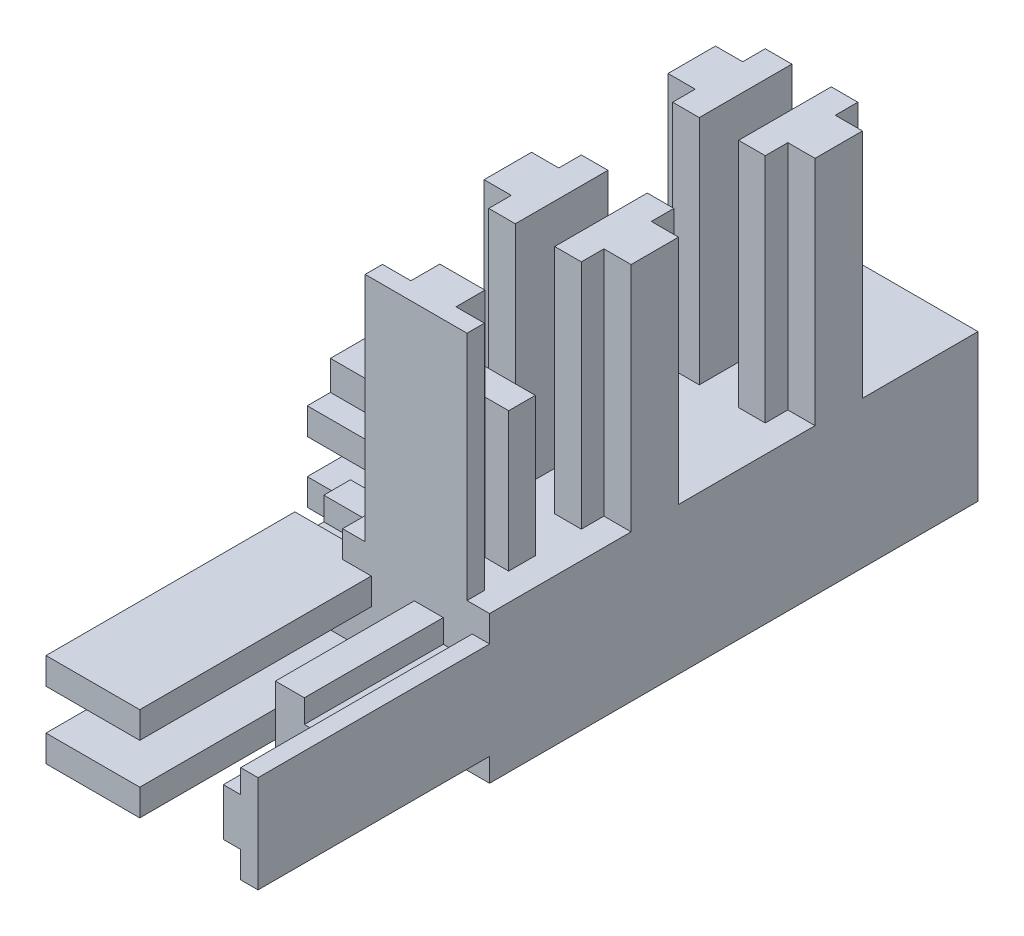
ISO-10303-21;
HEADER;
FILE_DESCRIPTION(('STEP AP214'),'2;1');
FILE_NAME('part.step','',(''),(''),'','','');
FILE_SCHEMA(('AUTOMOTIVE_DESIGN { 1 0 10303 214 1 1 1 1 }'));
ENDSEC;
DATA;
#1=APPLICATION_CONTEXT('core data for automotive mechanical design processes');
#2=APPLICATION_PROTOCOL_DEFINITION('international standard','automotive_design',2000,#1);
#3=PRODUCT_CONTEXT('',#1,'mechanical');
#4=PRODUCT('Part','Part','',(#3));
#5=PRODUCT_RELATED_PRODUCT_CATEGORY('part','',(#4));
#6=PRODUCT_DEFINITION_FORMATION('','',#4);
#7=PRODUCT_DEFINITION_CONTEXT('part definition',#1,'design');
#8=PRODUCT_DEFINITION('design','',#6,#7);
#9=PRODUCT_DEFINITION_SHAPE('','',#8);
#10=(LENGTH_UNIT() NAMED_UNIT(*) SI_UNIT(.MILLI.,.METRE.));
#11=(NAMED_UNIT(*) PLANE_ANGLE_UNIT() SI_UNIT($,.RADIAN.));
#12=(NAMED_UNIT(*) SI_UNIT($,.STERADIAN.) SOLID_ANGLE_UNIT());
#13=UNCERTAINTY_MEASURE_WITH_UNIT(LENGTH_MEASURE(1.E-05),#10,'distance_accuracy_value','');
#14=(GEOMETRIC_REPRESENTATION_CONTEXT(3) GLOBAL_UNCERTAINTY_ASSIGNED_CONTEXT((#13)) GLOBAL_UNIT_ASSIGNED_CONTEXT((#10,
#11,#12)) REPRESENTATION_CONTEXT('',''));
#15=CARTESIAN_POINT('',(0.,0.,0.));
#16=DIRECTION('',(0.,0.,1.));
#17=DIRECTION('',(1.,0.,0.));
#18=AXIS2_PLACEMENT_3D('',#15,#16,#17);
#19=CARTESIAN_POINT('',(0.,0.,44.44));
#20=DIRECTION('',(0.,0.,-1.));
#21=DIRECTION('',(-1.,0.,0.));
#22=AXIS2_PLACEMENT_3D('',#19,#20,#21);
#23=PLANE('',#22);
#24=DIRECTION('',(1.,0.,0.));
#25=VECTOR('',#24,1.);
#26=CARTESIAN_POINT('',(-12.8771428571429,2.71761904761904,44.44));
#27=LINE('',#26,#25);
#28=CARTESIAN_POINT('',(-12.8771428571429,2.71761904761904,44.44));
#29=VERTEX_POINT('',#28);
#30=CARTESIAN_POINT('',(-4.77714285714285,2.71761904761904,44.44));
#31=VERTEX_POINT('',#30);
#32=EDGE_CURVE('E1045',#29,#31,#27,.T.);
#33=ORIENTED_EDGE('',*,*,#32,.F.);
#34=DIRECTION('',(0.,-1.,0.));
#35=VECTOR('',#34,1.);
#36=CARTESIAN_POINT('',(-12.8771428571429,0.,44.44));
#37=LINE('',#36,#35);
#38=CARTESIAN_POINT('',(-12.8771428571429,-0.782380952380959,44.44));
#39=VERTEX_POINT('',#38);
#40=EDGE_CURVE('E809',#29,#39,#37,.T.);
#41=ORIENTED_EDGE('',*,*,#40,.T.);
#42=DIRECTION('',(-1.,0.,0.));
#43=VECTOR('',#42,1.);
#44=CARTESIAN_POINT('',(-12.8771428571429,-0.782380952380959,44.44));
#45=LINE('',#44,#43);
#46=CARTESIAN_POINT('',(-4.77714285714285,-0.782380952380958,44.44));
#47=VERTEX_POINT('',#46);
#48=EDGE_CURVE('E1076',#47,#39,#45,.T.);
#49=ORIENTED_EDGE('',*,*,#48,.F.);
#50=DIRECTION('',(0.,1.,0.));
#51=VECTOR('',#50,1.);
#52=CARTESIAN_POINT('',(-4.77714285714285,-0.782380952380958,44.44));
#53=LINE('',#52,#51);
#54=CARTESIAN_POINT('',(-4.77714285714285,-3.08238095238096,44.44));
#55=VERTEX_POINT('',#54);
#56=EDGE_CURVE('E1071',#55,#47,#53,.T.);
#57=ORIENTED_EDGE('',*,*,#56,.F.);
#58=DIRECTION('',(1.,0.,0.));
#59=VECTOR('',#58,1.);
#60=CARTESIAN_POINT('',(-12.8771428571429,-3.08238095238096,44.44));
#61=LINE('',#60,#59);
#62=CARTESIAN_POINT('',(-7.25714285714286,-3.08238095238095,44.44));
#63=VERTEX_POINT('',#62);
#64=EDGE_CURVE('E1083',#63,#55,#61,.T.);
#65=ORIENTED_EDGE('',*,*,#64,.F.);
#66=DIRECTION('',(0.,-1.,0.));
#67=VECTOR('',#66,1.);
#68=CARTESIAN_POINT('',(-7.25714285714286,7.31761904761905,44.44));
#69=LINE('',#68,#67);
#70=CARTESIAN_POINT('',(-7.25714285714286,-5.38238095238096,44.44));
#71=VERTEX_POINT('',#70);
#72=EDGE_CURVE('E1623',#63,#71,#69,.T.);
#73=ORIENTED_EDGE('',*,*,#72,.T.);
#74=DIRECTION('',(1.,0.,0.));
#75=VECTOR('',#74,1.);
#76=CARTESIAN_POINT('',(5.44285714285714,-5.38238095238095,44.44));
#77=LINE('',#76,#75);
#78=CARTESIAN_POINT('',(5.44285714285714,-5.38238095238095,44.44));
#79=VERTEX_POINT('',#78);
#80=EDGE_CURVE('E1627',#71,#79,#77,.T.);
#81=ORIENTED_EDGE('',*,*,#80,.T.);
#82=DIRECTION('',(0.,1.,0.));
#83=VECTOR('',#82,1.);
#84=CARTESIAN_POINT('',(5.44285714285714,7.31761904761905,44.44));
#85=LINE('',#84,#83);
#86=CARTESIAN_POINT('',(5.44285714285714,-3.36027189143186,44.44));
#87=VERTEX_POINT('',#86);
#88=EDGE_CURVE('E1617',#79,#87,#85,.T.);
#89=ORIENTED_EDGE('',*,*,#88,.T.);
#90=DIRECTION('',(1.,0.,0.));
#91=VECTOR('',#90,1.);
#92=CARTESIAN_POINT('',(5.44285714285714,-3.36027189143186,44.44));
#93=LINE('',#92,#91);
#94=CARTESIAN_POINT('',(3.94285714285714,-3.36027189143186,44.44));
#95=VERTEX_POINT('',#94);
#96=EDGE_CURVE('E971',#95,#87,#93,.T.);
#97=ORIENTED_EDGE('',*,*,#96,.F.);
#98=DIRECTION('',(0.,-1.,0.));
#99=VECTOR('',#98,1.);
#100=CARTESIAN_POINT('',(3.94285714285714,-3.36027189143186,44.44));
#101=LINE('',#100,#99);
#102=CARTESIAN_POINT('',(3.94285714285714,-1.08238095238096,44.44));
#103=VERTEX_POINT('',#102);
#104=EDGE_CURVE('E1011',#103,#95,#101,.T.);
#105=ORIENTED_EDGE('',*,*,#104,.F.);
#106=DIRECTION('',(1.,0.,0.));
#107=VECTOR('',#106,1.);
#108=CARTESIAN_POINT('',(1.44285714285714,-1.08238095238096,44.44));
#109=LINE('',#108,#107);
#110=CARTESIAN_POINT('',(1.44285714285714,-1.08238095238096,44.44));
#111=VERTEX_POINT('',#110);
#112=EDGE_CURVE('E1008',#111,#103,#109,.T.);
#113=ORIENTED_EDGE('',*,*,#112,.F.);
#114=DIRECTION('',(0.,1.,0.));
#115=VECTOR('',#114,1.);
#116=CARTESIAN_POINT('',(1.44285714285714,-3.08238095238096,44.44));
#117=LINE('',#116,#115);
#118=CARTESIAN_POINT('',(1.44285714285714,-3.08238095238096,44.44));
#119=VERTEX_POINT('',#118);
#120=EDGE_CURVE('E1005',#119,#111,#117,.T.);
#121=ORIENTED_EDGE('',*,*,#120,.F.);
#122=DIRECTION('',(1.,0.,0.));
#123=VECTOR('',#122,1.);
#124=CARTESIAN_POINT('',(-1.05714285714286,-3.08238095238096,44.44));
#125=LINE('',#124,#123);
#126=CARTESIAN_POINT('',(-1.05714285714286,-3.08238095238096,44.44));
#127=VERTEX_POINT('',#126);
#128=EDGE_CURVE('E1002',#127,#119,#125,.T.);
#129=ORIENTED_EDGE('',*,*,#128,.F.);
#130=DIRECTION('',(0.,-1.,0.));
#131=VECTOR('',#130,1.);
#132=CARTESIAN_POINT('',(-1.05714285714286,-3.08238095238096,44.44));
#133=LINE('',#132,#131);
#134=CARTESIAN_POINT('',(-1.05714285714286,5.01761904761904,44.44));
#135=VERTEX_POINT('',#134);
#136=EDGE_CURVE('E999',#135,#127,#133,.T.);
#137=ORIENTED_EDGE('',*,*,#136,.F.);
#138=DIRECTION('',(-1.,0.,0.));
#139=VECTOR('',#138,1.);
#140=CARTESIAN_POINT('',(1.44285714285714,5.01761904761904,44.44));
#141=LINE('',#140,#139);
#142=CARTESIAN_POINT('',(1.44285714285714,5.01761904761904,44.44));
#143=VERTEX_POINT('',#142);
#144=EDGE_CURVE('E996',#143,#135,#141,.T.);
#145=ORIENTED_EDGE('',*,*,#144,.F.);
#146=DIRECTION('',(0.,1.,0.));
#147=VECTOR('',#146,1.);
#148=CARTESIAN_POINT('',(1.44285714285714,5.01761904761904,44.44));
#149=LINE('',#148,#147);
#150=CARTESIAN_POINT('',(1.44285714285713,3.01761904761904,44.44));
#151=VERTEX_POINT('',#150);
#152=EDGE_CURVE('E993',#151,#143,#149,.T.);
#153=ORIENTED_EDGE('',*,*,#152,.F.);
#154=DIRECTION('',(-1.,0.,0.));
#155=VECTOR('',#154,1.);
#156=CARTESIAN_POINT('',(1.44285714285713,3.01761904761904,44.44));
#157=LINE('',#156,#155);
#158=CARTESIAN_POINT('',(3.94285714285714,3.01761904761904,44.44));
#159=VERTEX_POINT('',#158);
#160=EDGE_CURVE('E990',#159,#151,#157,.T.);
#161=ORIENTED_EDGE('',*,*,#160,.F.);
#162=DIRECTION('',(0.,-1.,0.));
#163=VECTOR('',#162,1.);
#164=CARTESIAN_POINT('',(3.94285714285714,3.01761904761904,44.44));
#165=LINE('',#164,#163);
#166=CARTESIAN_POINT('',(3.94285714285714,5.03972810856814,44.44));
#167=VERTEX_POINT('',#166);
#168=EDGE_CURVE('E987',#167,#159,#165,.T.);
#169=ORIENTED_EDGE('',*,*,#168,.F.);
#170=DIRECTION('',(-1.,0.,0.));
#171=VECTOR('',#170,1.);
#172=CARTESIAN_POINT('',(3.94285714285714,5.03972810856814,44.44));
#173=LINE('',#172,#171);
#174=CARTESIAN_POINT('',(5.44285714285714,5.03972810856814,44.44));
#175=VERTEX_POINT('',#174);
#176=EDGE_CURVE('E965',#175,#167,#173,.T.);
#177=ORIENTED_EDGE('',*,*,#176,.F.);
#178=CARTESIAN_POINT('',(5.44285714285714,7.31761904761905,44.44));
#179=VERTEX_POINT('',#178);
#180=EDGE_CURVE('E1616',#175,#179,#85,.T.);
#181=ORIENTED_EDGE('',*,*,#180,.T.);
#182=DIRECTION('',(-1.,0.,0.));
#183=VECTOR('',#182,1.);
#184=CARTESIAN_POINT('',(5.44285714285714,7.31761904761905,44.44));
#185=LINE('',#184,#183);
#186=CARTESIAN_POINT('',(3.49285714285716,7.31761904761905,44.44));
#187=VERTEX_POINT('',#186);
#188=EDGE_CURVE('E1620',#179,#187,#185,.T.);
#189=ORIENTED_EDGE('',*,*,#188,.T.);
#190=DIRECTION('',(0.,-1.,0.));
#191=VECTOR('',#190,1.);
#192=CARTESIAN_POINT('',(3.49285714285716,27.317619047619,44.44));
#193=LINE('',#192,#191);
#194=CARTESIAN_POINT('',(3.49285714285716,27.317619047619,44.44));
#195=VERTEX_POINT('',#194);
#196=EDGE_CURVE('E1552',#195,#187,#193,.T.);
#197=ORIENTED_EDGE('',*,*,#196,.F.);
#198=DIRECTION('',(1.,0.,0.));
#199=VECTOR('',#198,1.);
#200=CARTESIAN_POINT('',(3.49285714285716,27.317619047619,44.44));
#201=LINE('',#200,#199);
#202=CARTESIAN_POINT('',(-5.30714285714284,27.317619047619,44.44));
#203=VERTEX_POINT('',#202);
#204=EDGE_CURVE('E1550',#203,#195,#201,.T.);
#205=ORIENTED_EDGE('',*,*,#204,.F.);
#206=DIRECTION('',(0.,-1.,0.));
#207=VECTOR('',#206,1.);
#208=CARTESIAN_POINT('',(-5.30714285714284,27.317619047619,44.44));
#209=LINE('',#208,#207);
#210=CARTESIAN_POINT('',(-5.30714285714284,7.31761904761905,44.44));
#211=VERTEX_POINT('',#210);
#212=EDGE_CURVE('E1586',#203,#211,#209,.T.);
#213=ORIENTED_EDGE('',*,*,#212,.T.);
#214=CARTESIAN_POINT('',(-7.25714285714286,7.31761904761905,44.44));
#215=VERTEX_POINT('',#214);
#216=EDGE_CURVE('E1619',#211,#215,#185,.T.);
#217=ORIENTED_EDGE('',*,*,#216,.T.);
#218=CARTESIAN_POINT('',(-7.25714285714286,5.01761904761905,44.44));
#219=VERTEX_POINT('',#218);
#220=EDGE_CURVE('E1624',#215,#219,#69,.T.);
#221=ORIENTED_EDGE('',*,*,#220,.T.);
#222=DIRECTION('',(-1.,0.,0.));
#223=VECTOR('',#222,1.);
#224=CARTESIAN_POINT('',(-12.8771428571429,5.01761904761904,44.44));
#225=LINE('',#224,#223);
#226=CARTESIAN_POINT('',(-4.77714285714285,5.01761904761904,44.44));
#227=VERTEX_POINT('',#226);
#228=EDGE_CURVE('E1050',#227,#219,#225,.T.);
#229=ORIENTED_EDGE('',*,*,#228,.F.);
#230=DIRECTION('',(0.,1.,0.));
#231=VECTOR('',#230,1.);
#232=CARTESIAN_POINT('',(-4.77714285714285,2.71761904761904,44.44));
#233=LINE('',#232,#231);
#234=EDGE_CURVE('E1058',#31,#227,#233,.T.);
#235=ORIENTED_EDGE('',*,*,#234,.F.);
#236=EDGE_LOOP('',(#33,#41,#49,#57,#65,#73,#81,#89,#97,#105,#113,#121,#129,#137,#145,#153,#161,
#169,#177,#181,#189,#197,#205,#213,#217,#221,#229,#235));
#237=FACE_BOUND('',#236,.T.);
#238=ADVANCED_FACE('F34',(#237),#23,.F.);
#239=CARTESIAN_POINT('',(-7.25714285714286,7.31761904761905,44.44));
#240=DIRECTION('',(1.,0.,0.));
#241=DIRECTION('',(0.,1.,0.));
#242=AXIS2_PLACEMENT_3D('',#239,#240,#241);
#243=PLANE('',#242);
#244=DIRECTION('',(0.,-1.,0.));
#245=VECTOR('',#244,1.);
#246=CARTESIAN_POINT('',(-7.25714285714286,4.76761904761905,28.12));
#247=LINE('',#246,#245);
#248=CARTESIAN_POINT('',(-7.25714285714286,12.317619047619,28.12));
#249=VERTEX_POINT('',#248);
#250=CARTESIAN_POINT('',(-7.25714285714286,4.76761904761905,28.12));
#251=VERTEX_POINT('',#250);
#252=EDGE_CURVE('E49',#249,#251,#247,.T.);
#253=ORIENTED_EDGE('',*,*,#252,.F.);
#254=DIRECTION('',(0.,0.,-1.));
#255=VECTOR('',#254,1.);
#256=CARTESIAN_POINT('',(-7.25714285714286,12.317619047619,32.215));
#257=LINE('',#256,#255);
#258=CARTESIAN_POINT('',(-7.25714285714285,12.317619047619,32.215));
#259=VERTEX_POINT('',#258);
#260=EDGE_CURVE('E1663',#249,#259,#257,.F.);
#261=ORIENTED_EDGE('',*,*,#260,.T.);
#262=DIRECTION('',(0.,-1.,0.));
#263=VECTOR('',#262,1.);
#264=CARTESIAN_POINT('',(-7.25714285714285,27.317619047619,32.215));
#265=LINE('',#264,#263);
#266=CARTESIAN_POINT('',(-7.25714285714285,27.317619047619,32.215));
#267=VERTEX_POINT('',#266);
#268=EDGE_CURVE('E1524',#267,#259,#265,.T.);
#269=ORIENTED_EDGE('',*,*,#268,.F.);
#270=DIRECTION('',(0.,0.,1.));
#271=VECTOR('',#270,1.);
#272=CARTESIAN_POINT('',(-7.25714285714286,27.317619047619,28.115));
#273=LINE('',#272,#271);
#274=CARTESIAN_POINT('',(-7.25714285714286,27.317619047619,28.115));
#275=VERTEX_POINT('',#274);
#276=EDGE_CURVE('E1488',#275,#267,#273,.T.);
#277=ORIENTED_EDGE('',*,*,#276,.F.);
#278=DIRECTION('',(0.,-1.,0.));
#279=VECTOR('',#278,1.);
#280=CARTESIAN_POINT('',(-7.25714285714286,27.317619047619,28.115));
#281=LINE('',#280,#279);
#282=CARTESIAN_POINT('',(-7.25714285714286,7.31761904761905,28.115));
#283=VERTEX_POINT('',#282);
#284=EDGE_CURVE('E1527',#275,#283,#281,.T.);
#285=ORIENTED_EDGE('',*,*,#284,.T.);
#286=DIRECTION('',(0.,0.,-1.));
#287=VECTOR('',#286,1.);
#288=CARTESIAN_POINT('',(-7.25714285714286,7.31761904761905,44.44));
#289=LINE('',#288,#287);
#290=CARTESIAN_POINT('',(-7.25714285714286,7.31761904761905,16.325));
#291=VERTEX_POINT('',#290);
#292=EDGE_CURVE('E1641',#283,#291,#289,.T.);
#293=ORIENTED_EDGE('',*,*,#292,.T.);
#294=DIRECTION('',(0.,-1.,0.));
#295=VECTOR('',#294,1.);
#296=CARTESIAN_POINT('',(-7.25714285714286,27.317619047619,16.325));
#297=LINE('',#296,#295);
#298=CARTESIAN_POINT('',(-7.25714285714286,27.317619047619,16.325));
#299=VERTEX_POINT('',#298);
#300=EDGE_CURVE('E1398',#299,#291,#297,.T.);
#301=ORIENTED_EDGE('',*,*,#300,.F.);
#302=DIRECTION('',(0.,0.,1.));
#303=VECTOR('',#302,1.);
#304=CARTESIAN_POINT('',(-7.25714285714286,27.317619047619,16.325));
#305=LINE('',#304,#303);
#306=CARTESIAN_POINT('',(-7.25714285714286,27.317619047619,12.225));
#307=VERTEX_POINT('',#306);
#308=EDGE_CURVE('E1378',#307,#299,#305,.T.);
#309=ORIENTED_EDGE('',*,*,#308,.F.);
#310=DIRECTION('',(0.,-1.,0.));
#311=VECTOR('',#310,1.);
#312=CARTESIAN_POINT('',(-7.25714285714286,27.317619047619,12.225));
#313=LINE('',#312,#311);
#314=CARTESIAN_POINT('',(-7.25714285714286,12.317619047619,12.225));
#315=VERTEX_POINT('',#314);
#316=EDGE_CURVE('E1400',#307,#315,#313,.T.);
#317=ORIENTED_EDGE('',*,*,#316,.T.);
#318=DIRECTION('',(0.,0.,-1.));
#319=VECTOR('',#318,1.);
#320=CARTESIAN_POINT('',(-7.25714285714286,12.317619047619,16.32));
#321=LINE('',#320,#319);
#322=CARTESIAN_POINT('',(-7.25714285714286,12.317619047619,16.32));
#323=VERTEX_POINT('',#322);
#324=EDGE_CURVE('E1661',#315,#323,#321,.F.);
#325=ORIENTED_EDGE('',*,*,#324,.T.);
#326=DIRECTION('',(0.,1.,0.));
#327=VECTOR('',#326,1.);
#328=CARTESIAN_POINT('',(-7.25714285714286,4.76761904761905,16.32));
#329=LINE('',#328,#327);
#330=CARTESIAN_POINT('',(-7.25714285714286,4.76761904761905,16.32));
#331=VERTEX_POINT('',#330);
#332=EDGE_CURVE('E56',#331,#323,#329,.T.);
#333=ORIENTED_EDGE('',*,*,#332,.F.);
#334=DIRECTION('',(0.,0.,-1.));
#335=VECTOR('',#334,1.);
#336=CARTESIAN_POINT('',(-7.25714285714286,4.76761904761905,16.32));
#337=LINE('',#336,#335);
#338=CARTESIAN_POINT('',(-7.25714285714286,4.76761904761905,18.32));
#339=VERTEX_POINT('',#338);
#340=EDGE_CURVE('E1191',#339,#331,#337,.T.);
#341=ORIENTED_EDGE('',*,*,#340,.F.);
#342=DIRECTION('',(0.,1.,0.));
#343=VECTOR('',#342,1.);
#344=CARTESIAN_POINT('',(-7.25714285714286,4.76761904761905,18.32));
#345=LINE('',#344,#343);
#346=CARTESIAN_POINT('',(-7.25714285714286,2.46761904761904,18.32));
#347=VERTEX_POINT('',#346);
#348=EDGE_CURVE('E1188',#347,#339,#345,.T.);
#349=ORIENTED_EDGE('',*,*,#348,.F.);
#350=DIRECTION('',(0.,0.,1.));
#351=VECTOR('',#350,1.);
#352=CARTESIAN_POINT('',(-7.25714285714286,2.46761904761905,18.32));
#353=LINE('',#352,#351);
#354=CARTESIAN_POINT('',(-7.25714285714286,2.46761904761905,10.22));
#355=VERTEX_POINT('',#354);
#356=EDGE_CURVE('E1185',#355,#347,#353,.T.);
#357=ORIENTED_EDGE('',*,*,#356,.F.);
#358=DIRECTION('',(0.,-1.,0.));
#359=VECTOR('',#358,1.);
#360=CARTESIAN_POINT('',(-7.25714285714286,2.46761904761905,10.22));
#361=LINE('',#360,#359);
#362=CARTESIAN_POINT('',(-7.25714285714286,4.76761904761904,10.22));
#363=VERTEX_POINT('',#362);
#364=EDGE_CURVE('E1182',#363,#355,#361,.T.);
#365=ORIENTED_EDGE('',*,*,#364,.F.);
#366=DIRECTION('',(0.,0.,-1.));
#367=VECTOR('',#366,1.);
#368=CARTESIAN_POINT('',(-7.25714285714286,4.76761904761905,10.22));
#369=LINE('',#368,#367);
#370=CARTESIAN_POINT('',(-7.25714285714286,4.76761904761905,12.22));
#371=VERTEX_POINT('',#370);
#372=EDGE_CURVE('E1179',#371,#363,#369,.T.);
#373=ORIENTED_EDGE('',*,*,#372,.F.);
#374=DIRECTION('',(0.,-1.,0.));
#375=VECTOR('',#374,1.);
#376=CARTESIAN_POINT('',(-7.25714285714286,4.76761904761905,12.22));
#377=LINE('',#376,#375);
#378=CARTESIAN_POINT('',(-7.25714285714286,7.31761904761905,12.22));
#379=VERTEX_POINT('',#378);
#380=EDGE_CURVE('E1176',#379,#371,#377,.T.);
#381=ORIENTED_EDGE('',*,*,#380,.F.);
#382=CARTESIAN_POINT('',(-7.25714285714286,7.31761904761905,2.245));
#383=VERTEX_POINT('',#382);
#384=EDGE_CURVE('E1635',#379,#383,#289,.T.);
#385=ORIENTED_EDGE('',*,*,#384,.T.);
#386=DIRECTION('',(0.,1.,0.));
#387=VECTOR('',#386,1.);
#388=CARTESIAN_POINT('',(-7.25714285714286,-5.38238095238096,2.245));
#389=LINE('',#388,#387);
#390=CARTESIAN_POINT('',(-7.25714285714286,-5.38238095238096,2.245));
#391=VERTEX_POINT('',#390);
#392=EDGE_CURVE('E927',#391,#383,#389,.T.);
#393=ORIENTED_EDGE('',*,*,#392,.F.);
#394=DIRECTION('',(0.,0.,-1.));
#395=VECTOR('',#394,1.);
#396=CARTESIAN_POINT('',(-7.25714285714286,-5.38238095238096,44.44));
#397=LINE('',#396,#395);
#398=CARTESIAN_POINT('',(-7.25714285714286,-5.38238095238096,12.22));
#399=VERTEX_POINT('',#398);
#400=EDGE_CURVE('E1631',#399,#391,#397,.T.);
#401=ORIENTED_EDGE('',*,*,#400,.F.);
#402=DIRECTION('',(0.,-1.,0.));
#403=VECTOR('',#402,1.);
#404=CARTESIAN_POINT('',(-7.25714285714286,-2.83238095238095,12.22));
#405=LINE('',#404,#403);
#406=CARTESIAN_POINT('',(-7.25714285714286,-2.83238095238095,12.22));
#407=VERTEX_POINT('',#406);
#408=EDGE_CURVE('E1226',#407,#399,#405,.T.);
#409=ORIENTED_EDGE('',*,*,#408,.F.);
#410=DIRECTION('',(0.,0.,1.));
#411=VECTOR('',#410,1.);
#412=CARTESIAN_POINT('',(-7.25714285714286,-2.83238095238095,10.22));
#413=LINE('',#412,#411);
#414=CARTESIAN_POINT('',(-7.25714285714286,-2.83238095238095,10.22));
#415=VERTEX_POINT('',#414);
#416=EDGE_CURVE('E1223',#415,#407,#413,.T.);
#417=ORIENTED_EDGE('',*,*,#416,.F.);
#418=DIRECTION('',(0.,-1.,0.));
#419=VECTOR('',#418,1.);
#420=CARTESIAN_POINT('',(-7.25714285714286,-0.532380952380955,10.22));
#421=LINE('',#420,#419);
#422=CARTESIAN_POINT('',(-7.25714285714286,-0.532380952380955,10.22));
#423=VERTEX_POINT('',#422);
#424=EDGE_CURVE('E1220',#423,#415,#421,.T.);
#425=ORIENTED_EDGE('',*,*,#424,.F.);
#426=DIRECTION('',(0.,0.,-1.));
#427=VECTOR('',#426,1.);
#428=CARTESIAN_POINT('',(-7.25714285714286,-0.532380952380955,18.32));
#429=LINE('',#428,#427);
#430=CARTESIAN_POINT('',(-7.25714285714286,-0.532380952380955,18.32));
#431=VERTEX_POINT('',#430);
#432=EDGE_CURVE('E1217',#431,#423,#429,.T.);
#433=ORIENTED_EDGE('',*,*,#432,.F.);
#434=DIRECTION('',(0.,1.,0.));
#435=VECTOR('',#434,1.);
#436=CARTESIAN_POINT('',(-7.25714285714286,-2.83238095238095,18.32));
#437=LINE('',#436,#435);
#438=CARTESIAN_POINT('',(-7.25714285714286,-2.83238095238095,18.32));
#439=VERTEX_POINT('',#438);
#440=EDGE_CURVE('E1214',#439,#431,#437,.T.);
#441=ORIENTED_EDGE('',*,*,#440,.F.);
#442=DIRECTION('',(0.,0.,1.));
#443=VECTOR('',#442,1.);
#444=CARTESIAN_POINT('',(-7.25714285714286,-2.83238095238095,18.32));
#445=LINE('',#444,#443);
#446=CARTESIAN_POINT('',(-7.25714285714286,-2.83238095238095,16.32));
#447=VERTEX_POINT('',#446);
#448=EDGE_CURVE('E1211',#447,#439,#445,.T.);
#449=ORIENTED_EDGE('',*,*,#448,.F.);
#450=DIRECTION('',(0.,1.,0.));
#451=VECTOR('',#450,1.);
#452=CARTESIAN_POINT('',(-7.25714285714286,-2.83238095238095,16.32));
#453=LINE('',#452,#451);
#454=CARTESIAN_POINT('',(-7.25714285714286,-5.38238095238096,16.32));
#455=VERTEX_POINT('',#454);
#456=EDGE_CURVE('E1229',#455,#447,#453,.T.);
#457=ORIENTED_EDGE('',*,*,#456,.F.);
#458=CARTESIAN_POINT('',(-7.25714285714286,-5.38238095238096,28.12));
#459=VERTEX_POINT('',#458);
#460=EDGE_CURVE('E1636',#459,#455,#397,.T.);
#461=ORIENTED_EDGE('',*,*,#460,.F.);
#462=DIRECTION('',(0.,-1.,0.));
#463=VECTOR('',#462,1.);
#464=CARTESIAN_POINT('',(-7.25714285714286,-2.83238095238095,28.12));
#465=LINE('',#464,#463);
#466=CARTESIAN_POINT('',(-7.25714285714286,-2.83238095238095,28.12));
#467=VERTEX_POINT('',#466);
#468=EDGE_CURVE('E1144',#467,#459,#465,.T.);
#469=ORIENTED_EDGE('',*,*,#468,.F.);
#470=DIRECTION('',(0.,0.,1.));
#471=VECTOR('',#470,1.);
#472=CARTESIAN_POINT('',(-7.25714285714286,-2.83238095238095,26.12));
#473=LINE('',#472,#471);
#474=CARTESIAN_POINT('',(-7.25714285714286,-2.83238095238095,26.12));
#475=VERTEX_POINT('',#474);
#476=EDGE_CURVE('E1141',#475,#467,#473,.T.);
#477=ORIENTED_EDGE('',*,*,#476,.F.);
#478=DIRECTION('',(0.,-1.,0.));
#479=VECTOR('',#478,1.);
#480=CARTESIAN_POINT('',(-7.25714285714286,-2.83238095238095,26.12));
#481=LINE('',#480,#479);
#482=CARTESIAN_POINT('',(-7.25714285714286,-0.532380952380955,26.12));
#483=VERTEX_POINT('',#482);
#484=EDGE_CURVE('E1138',#483,#475,#481,.T.);
#485=ORIENTED_EDGE('',*,*,#484,.F.);
#486=DIRECTION('',(0.,0.,-1.));
#487=VECTOR('',#486,1.);
#488=CARTESIAN_POINT('',(-7.25714285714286,-0.532380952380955,26.12));
#489=LINE('',#488,#487);
#490=CARTESIAN_POINT('',(-7.25714285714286,-0.532380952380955,34.22));
#491=VERTEX_POINT('',#490);
#492=EDGE_CURVE('E1156',#491,#483,#489,.T.);
#493=ORIENTED_EDGE('',*,*,#492,.F.);
#494=DIRECTION('',(0.,1.,0.));
#495=VECTOR('',#494,1.);
#496=CARTESIAN_POINT('',(-7.25714285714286,-0.532380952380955,34.22));
#497=LINE('',#496,#495);
#498=CARTESIAN_POINT('',(-7.25714285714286,-2.83238095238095,34.22));
#499=VERTEX_POINT('',#498);
#500=EDGE_CURVE('E1153',#499,#491,#497,.T.);
#501=ORIENTED_EDGE('',*,*,#500,.F.);
#502=DIRECTION('',(0.,0.,1.));
#503=VECTOR('',#502,1.);
#504=CARTESIAN_POINT('',(-7.25714285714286,-2.83238095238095,34.22));
#505=LINE('',#504,#503);
#506=CARTESIAN_POINT('',(-7.25714285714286,-2.83238095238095,32.22));
#507=VERTEX_POINT('',#506);
#508=EDGE_CURVE('E1150',#507,#499,#505,.T.);
#509=ORIENTED_EDGE('',*,*,#508,.F.);
#510=DIRECTION('',(0.,1.,0.));
#511=VECTOR('',#510,1.);
#512=CARTESIAN_POINT('',(-7.25714285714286,-2.83238095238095,32.22));
#513=LINE('',#512,#511);
#514=CARTESIAN_POINT('',(-7.25714285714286,-5.38238095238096,32.22));
#515=VERTEX_POINT('',#514);
#516=EDGE_CURVE('E1147',#515,#507,#513,.T.);
#517=ORIENTED_EDGE('',*,*,#516,.F.);
#518=EDGE_CURVE('E1632',#71,#515,#397,.T.);
#519=ORIENTED_EDGE('',*,*,#518,.F.);
#520=ORIENTED_EDGE('',*,*,#72,.F.);
#521=DIRECTION('',(0.,0.,1.));
#522=VECTOR('',#521,1.);
#523=CARTESIAN_POINT('',(-7.25714285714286,-3.08238095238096,44.44));
#524=LINE('',#523,#522);
#525=CARTESIAN_POINT('',(-7.25714285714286,-3.08238095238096,42.94));
#526=VERTEX_POINT('',#525);
#527=EDGE_CURVE('E1278',#526,#63,#524,.T.);
#528=ORIENTED_EDGE('',*,*,#527,.F.);
#529=DIRECTION('',(0.,-1.,0.));
#530=VECTOR('',#529,1.);
#531=CARTESIAN_POINT('',(-7.25714285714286,-3.08238095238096,42.94));
#532=LINE('',#531,#530);
#533=CARTESIAN_POINT('',(-7.25714285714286,-1.08238095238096,42.94));
#534=VERTEX_POINT('',#533);
#535=EDGE_CURVE('E1275',#534,#526,#532,.T.);
#536=ORIENTED_EDGE('',*,*,#535,.F.);
#537=DIRECTION('',(0.,0.,1.));
#538=VECTOR('',#537,1.);
#539=CARTESIAN_POINT('',(-7.25714285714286,-1.08238095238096,40.44));
#540=LINE('',#539,#538);
#541=CARTESIAN_POINT('',(-7.25714285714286,-1.08238095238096,40.44));
#542=VERTEX_POINT('',#541);
#543=EDGE_CURVE('E1272',#542,#534,#540,.T.);
#544=ORIENTED_EDGE('',*,*,#543,.F.);
#545=DIRECTION('',(0.,1.,0.));
#546=VECTOR('',#545,1.);
#547=CARTESIAN_POINT('',(-7.25714285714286,-3.08238095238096,40.44));
#548=LINE('',#547,#546);
#549=CARTESIAN_POINT('',(-7.25714285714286,-3.08238095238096,40.44));
#550=VERTEX_POINT('',#549);
#551=EDGE_CURVE('E1269',#550,#542,#548,.T.);
#552=ORIENTED_EDGE('',*,*,#551,.F.);
#553=DIRECTION('',(0.,0.,1.));
#554=VECTOR('',#553,1.);
#555=CARTESIAN_POINT('',(-7.25714285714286,-3.08238095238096,38.14));
#556=LINE('',#555,#554);
#557=CARTESIAN_POINT('',(-7.25714285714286,-3.08238095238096,38.14));
#558=VERTEX_POINT('',#557);
#559=EDGE_CURVE('E1266',#558,#550,#556,.T.);
#560=ORIENTED_EDGE('',*,*,#559,.F.);
#561=DIRECTION('',(0.,-1.,0.));
#562=VECTOR('',#561,1.);
#563=CARTESIAN_POINT('',(-7.25714285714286,-3.08238095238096,38.14));
#564=LINE('',#563,#562);
#565=CARTESIAN_POINT('',(-7.25714285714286,5.01761904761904,38.14));
#566=VERTEX_POINT('',#565);
#567=EDGE_CURVE('E1263',#566,#558,#564,.T.);
#568=ORIENTED_EDGE('',*,*,#567,.F.);
#569=DIRECTION('',(0.,0.,-1.));
#570=VECTOR('',#569,1.);
#571=CARTESIAN_POINT('',(-7.25714285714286,5.01761904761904,40.44));
#572=LINE('',#571,#570);
#573=CARTESIAN_POINT('',(-7.25714285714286,5.01761904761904,40.44));
#574=VERTEX_POINT('',#573);
#575=EDGE_CURVE('E1260',#574,#566,#572,.T.);
#576=ORIENTED_EDGE('',*,*,#575,.F.);
#577=DIRECTION('',(0.,1.,0.));
#578=VECTOR('',#577,1.);
#579=CARTESIAN_POINT('',(-7.25714285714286,5.01761904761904,40.44));
#580=LINE('',#579,#578);
#581=CARTESIAN_POINT('',(-7.25714285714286,3.01761904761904,40.44));
#582=VERTEX_POINT('',#581);
#583=EDGE_CURVE('E1257',#582,#574,#580,.T.);
#584=ORIENTED_EDGE('',*,*,#583,.F.);
#585=DIRECTION('',(0.,0.,-1.));
#586=VECTOR('',#585,1.);
#587=CARTESIAN_POINT('',(-7.25714285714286,3.01761904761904,40.44));
#588=LINE('',#587,#586);
#589=CARTESIAN_POINT('',(-7.25714285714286,3.01761904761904,42.94));
#590=VERTEX_POINT('',#589);
#591=EDGE_CURVE('E1254',#590,#582,#588,.T.);
#592=ORIENTED_EDGE('',*,*,#591,.F.);
#593=DIRECTION('',(0.,-1.,0.));
#594=VECTOR('',#593,1.);
#595=CARTESIAN_POINT('',(-7.25714285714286,3.01761904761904,42.94));
#596=LINE('',#595,#594);
#597=CARTESIAN_POINT('',(-7.25714285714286,5.01761904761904,42.94));
#598=VERTEX_POINT('',#597);
#599=EDGE_CURVE('E1251',#598,#590,#596,.T.);
#600=ORIENTED_EDGE('',*,*,#599,.F.);
#601=DIRECTION('',(0.,0.,-1.));
#602=VECTOR('',#601,1.);
#603=CARTESIAN_POINT('',(-7.25714285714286,5.01761904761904,42.94));
#604=LINE('',#603,#602);
#605=EDGE_CURVE('E1248',#219,#598,#604,.T.);
#606=ORIENTED_EDGE('',*,*,#605,.F.);
#607=ORIENTED_EDGE('',*,*,#220,.F.);
#608=CARTESIAN_POINT('',(-7.25714285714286,7.31761904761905,32.22));
#609=VERTEX_POINT('',#608);
#610=EDGE_CURVE('E1637',#215,#609,#289,.T.);
#611=ORIENTED_EDGE('',*,*,#610,.T.);
#612=DIRECTION('',(0.,1.,0.));
#613=VECTOR('',#612,1.);
#614=CARTESIAN_POINT('',(-7.25714285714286,4.76761904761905,32.22));
#615=LINE('',#614,#613);
#616=CARTESIAN_POINT('',(-7.25714285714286,4.76761904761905,32.22));
#617=VERTEX_POINT('',#616);
#618=EDGE_CURVE('E1114',#617,#609,#615,.T.);
#619=ORIENTED_EDGE('',*,*,#618,.F.);
#620=DIRECTION('',(0.,0.,-1.));
#621=VECTOR('',#620,1.);
#622=CARTESIAN_POINT('',(-7.25714285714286,4.76761904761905,34.22));
#623=LINE('',#622,#621);
#624=CARTESIAN_POINT('',(-7.25714285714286,4.76761904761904,34.22));
#625=VERTEX_POINT('',#624);
#626=EDGE_CURVE('E1111',#625,#617,#623,.T.);
#627=ORIENTED_EDGE('',*,*,#626,.F.);
#628=DIRECTION('',(0.,1.,0.));
#629=VECTOR('',#628,1.);
#630=CARTESIAN_POINT('',(-7.25714285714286,2.46761904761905,34.22));
#631=LINE('',#630,#629);
#632=CARTESIAN_POINT('',(-7.25714285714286,2.46761904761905,34.22));
#633=VERTEX_POINT('',#632);
#634=EDGE_CURVE('E1108',#633,#625,#631,.T.);
#635=ORIENTED_EDGE('',*,*,#634,.F.);
#636=DIRECTION('',(0.,0.,1.));
#637=VECTOR('',#636,1.);
#638=CARTESIAN_POINT('',(-7.25714285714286,2.46761904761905,26.12));
#639=LINE('',#638,#637);
#640=CARTESIAN_POINT('',(-7.25714285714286,2.46761904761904,26.12));
#641=VERTEX_POINT('',#640);
#642=EDGE_CURVE('E1105',#641,#633,#639,.T.);
#643=ORIENTED_EDGE('',*,*,#642,.F.);
#644=DIRECTION('',(0.,-1.,0.));
#645=VECTOR('',#644,1.);
#646=CARTESIAN_POINT('',(-7.25714285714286,4.76761904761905,26.12));
#647=LINE('',#646,#645);
#648=CARTESIAN_POINT('',(-7.25714285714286,4.76761904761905,26.12));
#649=VERTEX_POINT('',#648);
#650=EDGE_CURVE('E1102',#649,#641,#647,.T.);
#651=ORIENTED_EDGE('',*,*,#650,.F.);
#652=DIRECTION('',(0.,0.,-1.));
#653=VECTOR('',#652,1.);
#654=CARTESIAN_POINT('',(-7.25714285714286,4.76761904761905,28.12));
#655=LINE('',#654,#653);
#656=EDGE_CURVE('E1118',#251,#649,#655,.T.);
#657=ORIENTED_EDGE('',*,*,#656,.F.);
#658=EDGE_LOOP('',(#253,#261,#269,#277,#285,#293,#301,#309,#317,#325,#333,#341,#349,#357,#365,
#373,#381,#385,#393,#401,#409,#417,#425,#433,#441,#449,#457,#461,#469,#477,#485,#493,#501,#509,
#517,#519,#520,#528,#536,#544,#552,#560,#568,#576,#584,#592,#600,#606,#607,#611,#619,#627,#635,
#643,#651,#657));
#659=FACE_BOUND('',#658,.T.);
#660=ADVANCED_FACE('F1679',(#659),#243,.F.);
#661=CARTESIAN_POINT('',(5.44285714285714,7.31761904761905,44.44));
#662=DIRECTION('',(0.,-1.,0.));
#663=DIRECTION('',(0.,0.,-1.));
#664=AXIS2_PLACEMENT_3D('',#661,#662,#663);
#665=PLANE('',#664);
#666=DIRECTION('',(1.,0.,0.));
#667=VECTOR('',#666,1.);
#668=CARTESIAN_POINT('',(-4.90714285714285,7.31761904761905,32.215));
#669=LINE('',#668,#667);
#670=CARTESIAN_POINT('',(-12.2571428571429,7.31761904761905,32.215));
#671=VERTEX_POINT('',#670);
#672=CARTESIAN_POINT('',(-4.90714285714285,7.31761904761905,32.215));
#673=VERTEX_POINT('',#672);
#674=EDGE_CURVE('E1506',#671,#673,#669,.T.);
#675=ORIENTED_EDGE('',*,*,#674,.F.);
#676=DIRECTION('',(0.,0.,-1.));
#677=VECTOR('',#676,1.);
#678=CARTESIAN_POINT('',(-12.2571428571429,7.31761904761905,28.12));
#679=LINE('',#678,#677);
#680=CARTESIAN_POINT('',(-12.2571428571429,7.31761904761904,28.12));
#681=VERTEX_POINT('',#680);
#682=EDGE_CURVE('E1658',#671,#681,#679,.T.);
#683=ORIENTED_EDGE('',*,*,#682,.T.);
#684=DIRECTION('',(1.,0.,0.));
#685=VECTOR('',#684,1.);
#686=CARTESIAN_POINT('',(-38.9971428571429,7.31761904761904,28.12));
#687=LINE('',#686,#685);
#688=CARTESIAN_POINT('',(-20.5271428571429,7.31761904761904,28.12));
#689=VERTEX_POINT('',#688);
#690=EDGE_CURVE('E1125',#689,#681,#687,.T.);
#691=ORIENTED_EDGE('',*,*,#690,.F.);
#692=DIRECTION('',(0.,0.,-1.));
#693=VECTOR('',#692,1.);
#694=CARTESIAN_POINT('',(-20.5271428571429,7.31761904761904,34.22));
#695=LINE('',#694,#693);
#696=CARTESIAN_POINT('',(-20.5271428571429,7.31761904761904,32.22));
#697=VERTEX_POINT('',#696);
#698=EDGE_CURVE('E840',#697,#689,#695,.T.);
#699=ORIENTED_EDGE('',*,*,#698,.F.);
#700=DIRECTION('',(1.,0.,0.));
#701=VECTOR('',#700,1.);
#702=CARTESIAN_POINT('',(-38.9971428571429,7.31761904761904,32.22));
#703=LINE('',#702,#701);
#704=EDGE_CURVE('E1128',#697,#609,#703,.T.);
#705=ORIENTED_EDGE('',*,*,#704,.T.);
#706=ORIENTED_EDGE('',*,*,#610,.F.);
#707=ORIENTED_EDGE('',*,*,#216,.F.);
#708=DIRECTION('',(0.,0.,1.));
#709=VECTOR('',#708,1.);
#710=CARTESIAN_POINT('',(-5.30714285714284,7.31761904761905,44.44));
#711=LINE('',#710,#709);
#712=CARTESIAN_POINT('',(-5.30714285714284,7.31761904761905,42.94));
#713=VERTEX_POINT('',#712);
#714=EDGE_CURVE('E1539',#713,#211,#711,.T.);
#715=ORIENTED_EDGE('',*,*,#714,.F.);
#716=DIRECTION('',(-1.,0.,0.));
#717=VECTOR('',#716,1.);
#718=CARTESIAN_POINT('',(-5.30714285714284,7.31761904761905,42.94));
#719=LINE('',#718,#717);
#720=CARTESIAN_POINT('',(-2.85714285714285,7.31761904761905,42.94));
#721=VERTEX_POINT('',#720);
#722=EDGE_CURVE('E1579',#721,#713,#719,.T.);
#723=ORIENTED_EDGE('',*,*,#722,.F.);
#724=DIRECTION('',(0.,0.,1.));
#725=VECTOR('',#724,1.);
#726=CARTESIAN_POINT('',(-2.85714285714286,7.31761904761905,40.44));
#727=LINE('',#726,#725);
#728=CARTESIAN_POINT('',(-2.85714285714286,7.31761904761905,40.44));
#729=VERTEX_POINT('',#728);
#730=EDGE_CURVE('E1576',#729,#721,#727,.T.);
#731=ORIENTED_EDGE('',*,*,#730,.F.);
#732=DIRECTION('',(1.,0.,0.));
#733=VECTOR('',#732,1.);
#734=CARTESIAN_POINT('',(-4.90714285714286,7.31761904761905,40.44));
#735=LINE('',#734,#733);
#736=CARTESIAN_POINT('',(-4.90714285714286,7.31761904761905,40.44));
#737=VERTEX_POINT('',#736);
#738=EDGE_CURVE('E1573',#737,#729,#735,.T.);
#739=ORIENTED_EDGE('',*,*,#738,.F.);
#740=DIRECTION('',(0.,0.,1.));
#741=VECTOR('',#740,1.);
#742=CARTESIAN_POINT('',(-4.90714285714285,7.31761904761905,38.14));
#743=LINE('',#742,#741);
#744=CARTESIAN_POINT('',(-4.90714285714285,7.31761904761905,38.14));
#745=VERTEX_POINT('',#744);
#746=EDGE_CURVE('E1570',#745,#737,#743,.T.);
#747=ORIENTED_EDGE('',*,*,#746,.F.);
#748=DIRECTION('',(-1.,0.,0.));
#749=VECTOR('',#748,1.);
#750=CARTESIAN_POINT('',(-4.90714285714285,7.31761904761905,38.14));
#751=LINE('',#750,#749);
#752=CARTESIAN_POINT('',(3.09285714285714,7.31761904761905,38.14));
#753=VERTEX_POINT('',#752);
#754=EDGE_CURVE('E1567',#753,#745,#751,.T.);
#755=ORIENTED_EDGE('',*,*,#754,.F.);
#756=DIRECTION('',(0.,0.,-1.));
#757=VECTOR('',#756,1.);
#758=CARTESIAN_POINT('',(3.09285714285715,7.31761904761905,40.44));
#759=LINE('',#758,#757);
#760=CARTESIAN_POINT('',(3.09285714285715,7.31761904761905,40.44));
#761=VERTEX_POINT('',#760);
#762=EDGE_CURVE('E1564',#761,#753,#759,.T.);
#763=ORIENTED_EDGE('',*,*,#762,.F.);
#764=DIRECTION('',(1.,0.,0.));
#765=VECTOR('',#764,1.);
#766=CARTESIAN_POINT('',(3.09285714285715,7.31761904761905,40.44));
#767=LINE('',#766,#765);
#768=CARTESIAN_POINT('',(1.04285714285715,7.31761904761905,40.44));
#769=VERTEX_POINT('',#768);
#770=EDGE_CURVE('E1561',#769,#761,#767,.T.);
#771=ORIENTED_EDGE('',*,*,#770,.F.);
#772=DIRECTION('',(0.,0.,-1.));
#773=VECTOR('',#772,1.);
#774=CARTESIAN_POINT('',(1.04285714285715,7.31761904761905,40.44));
#775=LINE('',#774,#773);
#776=CARTESIAN_POINT('',(1.04285714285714,7.31761904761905,42.94));
#777=VERTEX_POINT('',#776);
#778=EDGE_CURVE('E1558',#777,#769,#775,.T.);
#779=ORIENTED_EDGE('',*,*,#778,.F.);
#780=DIRECTION('',(-1.,0.,0.));
#781=VECTOR('',#780,1.);
#782=CARTESIAN_POINT('',(1.04285714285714,7.31761904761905,42.94));
#783=LINE('',#782,#781);
#784=CARTESIAN_POINT('',(3.49285714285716,7.31761904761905,42.94));
#785=VERTEX_POINT('',#784);
#786=EDGE_CURVE('E1555',#785,#777,#783,.T.);
#787=ORIENTED_EDGE('',*,*,#786,.F.);
#788=DIRECTION('',(0.,0.,-1.));
#789=VECTOR('',#788,1.);
#790=CARTESIAN_POINT('',(3.49285714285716,7.31761904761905,42.94));
#791=LINE('',#790,#789);
#792=EDGE_CURVE('E1534',#187,#785,#791,.T.);
#793=ORIENTED_EDGE('',*,*,#792,.F.);
#794=ORIENTED_EDGE('',*,*,#188,.F.);
#795=DIRECTION('',(0.,0.,-1.));
#796=VECTOR('',#795,1.);
#797=CARTESIAN_POINT('',(5.44285714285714,7.31761904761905,44.44));
#798=LINE('',#797,#796);
#799=CARTESIAN_POINT('',(5.44285714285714,7.31761904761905,32.215));
#800=VERTEX_POINT('',#799);
#801=EDGE_CURVE('E1087',#179,#800,#798,.T.);
#802=ORIENTED_EDGE('',*,*,#801,.T.);
#803=DIRECTION('',(1.,0.,0.));
#804=VECTOR('',#803,1.);
#805=CARTESIAN_POINT('',(3.09285714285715,7.31761904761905,32.215));
#806=LINE('',#805,#804);
#807=CARTESIAN_POINT('',(3.09285714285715,7.31761904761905,32.215));
#808=VERTEX_POINT('',#807);
#809=EDGE_CURVE('E1448',#808,#800,#806,.T.);
#810=ORIENTED_EDGE('',*,*,#809,.F.);
#811=DIRECTION('',(0.,0.,-1.));
#812=VECTOR('',#811,1.);
#813=CARTESIAN_POINT('',(3.09285714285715,7.31761904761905,34.165));
#814=LINE('',#813,#812);
#815=CARTESIAN_POINT('',(3.09285714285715,7.31761904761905,34.165));
#816=VERTEX_POINT('',#815);
#817=EDGE_CURVE('E1445',#816,#808,#814,.T.);
#818=ORIENTED_EDGE('',*,*,#817,.F.);
#819=DIRECTION('',(1.,0.,0.));
#820=VECTOR('',#819,1.);
#821=CARTESIAN_POINT('',(0.792857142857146,7.31761904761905,34.165));
#822=LINE('',#821,#820);
#823=CARTESIAN_POINT('',(0.792857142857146,7.31761904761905,34.165));
#824=VERTEX_POINT('',#823);
#825=EDGE_CURVE('E1442',#824,#816,#822,.T.);
#826=ORIENTED_EDGE('',*,*,#825,.F.);
#827=DIRECTION('',(0.,0.,1.));
#828=VECTOR('',#827,1.);
#829=CARTESIAN_POINT('',(0.792857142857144,7.31761904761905,26.165));
#830=LINE('',#829,#828);
#831=CARTESIAN_POINT('',(0.792857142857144,7.31761904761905,26.165));
#832=VERTEX_POINT('',#831);
#833=EDGE_CURVE('E1439',#832,#824,#830,.T.);
#834=ORIENTED_EDGE('',*,*,#833,.F.);
#835=DIRECTION('',(-1.,0.,0.));
#836=VECTOR('',#835,1.);
#837=CARTESIAN_POINT('',(3.09285714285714,7.31761904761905,26.165));
#838=LINE('',#837,#836);
#839=CARTESIAN_POINT('',(3.09285714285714,7.31761904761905,26.165));
#840=VERTEX_POINT('',#839);
#841=EDGE_CURVE('E1417',#840,#832,#838,.T.);
#842=ORIENTED_EDGE('',*,*,#841,.F.);
#843=DIRECTION('',(0.,0.,-1.));
#844=VECTOR('',#843,1.);
#845=CARTESIAN_POINT('',(3.09285714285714,7.31761904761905,28.115));
#846=LINE('',#845,#844);
#847=CARTESIAN_POINT('',(3.09285714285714,7.31761904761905,28.115));
#848=VERTEX_POINT('',#847);
#849=EDGE_CURVE('E1422',#848,#840,#846,.T.);
#850=ORIENTED_EDGE('',*,*,#849,.F.);
#851=DIRECTION('',(-1.,0.,0.));
#852=VECTOR('',#851,1.);
#853=CARTESIAN_POINT('',(3.09285714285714,7.31761904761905,28.115));
#854=LINE('',#853,#852);
#855=CARTESIAN_POINT('',(5.44285714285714,7.31761904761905,28.115));
#856=VERTEX_POINT('',#855);
#857=EDGE_CURVE('E1451',#856,#848,#854,.T.);
#858=ORIENTED_EDGE('',*,*,#857,.F.);
#859=CARTESIAN_POINT('',(5.44285714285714,7.31761904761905,16.325));
#860=VERTEX_POINT('',#859);
#861=EDGE_CURVE('E1643',#856,#860,#798,.T.);
#862=ORIENTED_EDGE('',*,*,#861,.T.);
#863=DIRECTION('',(1.,0.,0.));
#864=VECTOR('',#863,1.);
#865=CARTESIAN_POINT('',(3.09285714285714,7.31761904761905,16.325));
#866=LINE('',#865,#864);
#867=CARTESIAN_POINT('',(3.09285714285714,7.31761904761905,16.325));
#868=VERTEX_POINT('',#867);
#869=EDGE_CURVE('E1301',#868,#860,#866,.T.);
#870=ORIENTED_EDGE('',*,*,#869,.F.);
#871=DIRECTION('',(0.,0.,-1.));
#872=VECTOR('',#871,1.);
#873=CARTESIAN_POINT('',(3.09285714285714,7.31761904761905,16.325));
#874=LINE('',#873,#872);
#875=CARTESIAN_POINT('',(3.09285714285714,7.31761904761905,18.275));
#876=VERTEX_POINT('',#875);
#877=EDGE_CURVE('E1306',#876,#868,#874,.T.);
#878=ORIENTED_EDGE('',*,*,#877,.F.);
#879=DIRECTION('',(1.,0.,0.));
#880=VECTOR('',#879,1.);
#881=CARTESIAN_POINT('',(3.09285714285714,7.31761904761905,18.275));
#882=LINE('',#881,#880);
#883=CARTESIAN_POINT('',(0.792857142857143,7.31761904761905,18.275));
#884=VERTEX_POINT('',#883);
#885=EDGE_CURVE('E1335',#884,#876,#882,.T.);
#886=ORIENTED_EDGE('',*,*,#885,.F.);
#887=DIRECTION('',(0.,0.,1.));
#888=VECTOR('',#887,1.);
#889=CARTESIAN_POINT('',(0.792857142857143,7.31761904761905,18.275));
#890=LINE('',#889,#888);
#891=CARTESIAN_POINT('',(0.792857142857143,7.31761904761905,10.275));
#892=VERTEX_POINT('',#891);
#893=EDGE_CURVE('E1332',#892,#884,#890,.T.);
#894=ORIENTED_EDGE('',*,*,#893,.F.);
#895=DIRECTION('',(-1.,0.,0.));
#896=VECTOR('',#895,1.);
#897=CARTESIAN_POINT('',(0.792857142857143,7.31761904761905,10.275));
#898=LINE('',#897,#896);
#899=CARTESIAN_POINT('',(3.09285714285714,7.31761904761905,10.275));
#900=VERTEX_POINT('',#899);
#901=EDGE_CURVE('E1329',#900,#892,#898,.T.);
#902=ORIENTED_EDGE('',*,*,#901,.F.);
#903=DIRECTION('',(0.,0.,-1.));
#904=VECTOR('',#903,1.);
#905=CARTESIAN_POINT('',(3.09285714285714,7.31761904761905,10.275));
#906=LINE('',#905,#904);
#907=CARTESIAN_POINT('',(3.09285714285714,7.31761904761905,12.225));
#908=VERTEX_POINT('',#907);
#909=EDGE_CURVE('E1326',#908,#900,#906,.T.);
#910=ORIENTED_EDGE('',*,*,#909,.F.);
#911=DIRECTION('',(-1.,0.,0.));
#912=VECTOR('',#911,1.);
#913=CARTESIAN_POINT('',(3.09285714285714,7.31761904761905,12.225));
#914=LINE('',#913,#912);
#915=CARTESIAN_POINT('',(5.44285714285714,7.31761904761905,12.225));
#916=VERTEX_POINT('',#915);
#917=EDGE_CURVE('E1323',#916,#908,#914,.T.);
#918=ORIENTED_EDGE('',*,*,#917,.F.);
#919=CARTESIAN_POINT('',(5.44285714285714,7.31761904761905,2.245));
#920=VERTEX_POINT('',#919);
#921=EDGE_CURVE('E1640',#916,#920,#798,.T.);
#922=ORIENTED_EDGE('',*,*,#921,.T.);
#923=DIRECTION('',(1.,0.,0.));
#924=VECTOR('',#923,1.);
#925=CARTESIAN_POINT('',(-7.25714285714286,7.31761904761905,2.245));
#926=LINE('',#925,#924);
#927=EDGE_CURVE('E918',#383,#920,#926,.T.);
#928=ORIENTED_EDGE('',*,*,#927,.F.);
#929=ORIENTED_EDGE('',*,*,#384,.F.);
#930=DIRECTION('',(1.,0.,0.));
#931=VECTOR('',#930,1.);
#932=CARTESIAN_POINT('',(-38.9971428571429,7.31761904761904,12.22));
#933=LINE('',#932,#931);
#934=CARTESIAN_POINT('',(-20.5271428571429,7.31761904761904,12.22));
#935=VERTEX_POINT('',#934);
#936=EDGE_CURVE('E1206',#935,#379,#933,.T.);
#937=ORIENTED_EDGE('',*,*,#936,.F.);
#938=CARTESIAN_POINT('',(-20.5271428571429,7.31761904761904,16.32));
#939=VERTEX_POINT('',#938);
#940=EDGE_CURVE('E835',#939,#935,#695,.T.);
#941=ORIENTED_EDGE('',*,*,#940,.F.);
#942=DIRECTION('',(1.,0.,0.));
#943=VECTOR('',#942,1.);
#944=CARTESIAN_POINT('',(-38.9971428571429,7.31761904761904,16.32));
#945=LINE('',#944,#943);
#946=CARTESIAN_POINT('',(-12.2571428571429,7.31761904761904,16.32));
#947=VERTEX_POINT('',#946);
#948=EDGE_CURVE('E1208',#939,#947,#945,.T.);
#949=ORIENTED_EDGE('',*,*,#948,.T.);
#950=DIRECTION('',(0.,0.,-1.));
#951=VECTOR('',#950,1.);
#952=CARTESIAN_POINT('',(-12.2571428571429,7.31761904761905,12.225));
#953=LINE('',#952,#951);
#954=CARTESIAN_POINT('',(-12.2571428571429,7.31761904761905,12.225));
#955=VERTEX_POINT('',#954);
#956=EDGE_CURVE('E1655',#947,#955,#953,.T.);
#957=ORIENTED_EDGE('',*,*,#956,.T.);
#958=DIRECTION('',(-1.,0.,0.));
#959=VECTOR('',#958,1.);
#960=CARTESIAN_POINT('',(-4.90714285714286,7.31761904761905,12.225));
#961=LINE('',#960,#959);
#962=CARTESIAN_POINT('',(-4.90714285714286,7.31761904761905,12.225));
#963=VERTEX_POINT('',#962);
#964=EDGE_CURVE('E1393',#963,#955,#961,.T.);
#965=ORIENTED_EDGE('',*,*,#964,.F.);
#966=DIRECTION('',(0.,0.,1.));
#967=VECTOR('',#966,1.);
#968=CARTESIAN_POINT('',(-4.90714285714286,7.31761904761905,10.275));
#969=LINE('',#968,#967);
#970=CARTESIAN_POINT('',(-4.90714285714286,7.31761904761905,10.275));
#971=VERTEX_POINT('',#970);
#972=EDGE_CURVE('E1391',#971,#963,#969,.T.);
#973=ORIENTED_EDGE('',*,*,#972,.F.);
#974=DIRECTION('',(-1.,0.,0.));
#975=VECTOR('',#974,1.);
#976=CARTESIAN_POINT('',(-2.60714285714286,7.31761904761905,10.275));
#977=LINE('',#976,#975);
#978=CARTESIAN_POINT('',(-2.60714285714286,7.31761904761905,10.275));
#979=VERTEX_POINT('',#978);
#980=EDGE_CURVE('E1389',#979,#971,#977,.T.);
#981=ORIENTED_EDGE('',*,*,#980,.F.);
#982=DIRECTION('',(0.,0.,-1.));
#983=VECTOR('',#982,1.);
#984=CARTESIAN_POINT('',(-2.60714285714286,7.31761904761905,18.275));
#985=LINE('',#984,#983);
#986=CARTESIAN_POINT('',(-2.60714285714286,7.31761904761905,18.275));
#987=VERTEX_POINT('',#986);
#988=EDGE_CURVE('E1387',#987,#979,#985,.T.);
#989=ORIENTED_EDGE('',*,*,#988,.F.);
#990=DIRECTION('',(1.,0.,0.));
#991=VECTOR('',#990,1.);
#992=CARTESIAN_POINT('',(-4.90714285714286,7.31761904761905,18.275));
#993=LINE('',#992,#991);
#994=CARTESIAN_POINT('',(-4.90714285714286,7.31761904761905,18.275));
#995=VERTEX_POINT('',#994);
#996=EDGE_CURVE('E1385',#995,#987,#993,.T.);
#997=ORIENTED_EDGE('',*,*,#996,.F.);
#998=DIRECTION('',(0.,0.,1.));
#999=VECTOR('',#998,1.);
#1000=CARTESIAN_POINT('',(-4.90714285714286,7.31761904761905,18.275));
#1001=LINE('',#1000,#999);
#1002=CARTESIAN_POINT('',(-4.90714285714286,7.31761904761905,16.325));
#1003=VERTEX_POINT('',#1002);
#1004=EDGE_CURVE('E1363',#1003,#995,#1001,.T.);
#1005=ORIENTED_EDGE('',*,*,#1004,.F.);
#1006=DIRECTION('',(1.,0.,0.));
#1007=VECTOR('',#1006,1.);
#1008=CARTESIAN_POINT('',(-4.90714285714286,7.31761904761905,16.325));
#1009=LINE('',#1008,#1007);
#1010=EDGE_CURVE('E1368',#291,#1003,#1009,.T.);
#1011=ORIENTED_EDGE('',*,*,#1010,.F.);
#1012=ORIENTED_EDGE('',*,*,#292,.F.);
#1013=DIRECTION('',(-1.,0.,0.));
#1014=VECTOR('',#1013,1.);
#1015=CARTESIAN_POINT('',(-4.90714285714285,7.31761904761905,28.115));
#1016=LINE('',#1015,#1014);
#1017=CARTESIAN_POINT('',(-4.90714285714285,7.31761904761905,28.115));
#1018=VERTEX_POINT('',#1017);
#1019=EDGE_CURVE('E1503',#1018,#283,#1016,.T.);
#1020=ORIENTED_EDGE('',*,*,#1019,.F.);
#1021=DIRECTION('',(0.,0.,1.));
#1022=VECTOR('',#1021,1.);
#1023=CARTESIAN_POINT('',(-4.90714285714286,7.31761904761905,26.165));
#1024=LINE('',#1023,#1022);
#1025=CARTESIAN_POINT('',(-4.90714285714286,7.31761904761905,26.165));
#1026=VERTEX_POINT('',#1025);
#1027=EDGE_CURVE('E1501',#1026,#1018,#1024,.T.);
#1028=ORIENTED_EDGE('',*,*,#1027,.F.);
#1029=DIRECTION('',(-1.,0.,0.));
#1030=VECTOR('',#1029,1.);
#1031=CARTESIAN_POINT('',(-4.90714285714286,7.31761904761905,26.165));
#1032=LINE('',#1031,#1030);
#1033=CARTESIAN_POINT('',(-2.60714285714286,7.31761904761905,26.165));
#1034=VERTEX_POINT('',#1033);
#1035=EDGE_CURVE('E1479',#1034,#1026,#1032,.T.);
#1036=ORIENTED_EDGE('',*,*,#1035,.F.);
#1037=DIRECTION('',(0.,0.,-1.));
#1038=VECTOR('',#1037,1.);
#1039=CARTESIAN_POINT('',(-2.60714285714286,7.31761904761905,26.165));
#1040=LINE('',#1039,#1038);
#1041=CARTESIAN_POINT('',(-2.60714285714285,7.31761904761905,34.165));
#1042=VERTEX_POINT('',#1041);
#1043=EDGE_CURVE('E1484',#1042,#1034,#1040,.T.);
#1044=ORIENTED_EDGE('',*,*,#1043,.F.);
#1045=DIRECTION('',(1.,0.,0.));
#1046=VECTOR('',#1045,1.);
#1047=CARTESIAN_POINT('',(-2.60714285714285,7.31761904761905,34.165));
#1048=LINE('',#1047,#1046);
#1049=CARTESIAN_POINT('',(-4.90714285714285,7.31761904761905,34.165));
#1050=VERTEX_POINT('',#1049);
#1051=EDGE_CURVE('E1510',#1050,#1042,#1048,.T.);
#1052=ORIENTED_EDGE('',*,*,#1051,.F.);
#1053=DIRECTION('',(0.,0.,1.));
#1054=VECTOR('',#1053,1.);
#1055=CARTESIAN_POINT('',(-4.90714285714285,7.31761904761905,34.165));
#1056=LINE('',#1055,#1054);
#1057=EDGE_CURVE('E1508',#673,#1050,#1056,.T.);
#1058=ORIENTED_EDGE('',*,*,#1057,.F.);
#1059=EDGE_LOOP('',(#675,#683,#691,#699,#705,#706,#707,#715,#723,#731,#739,#747,#755,#763,#771,
#779,#787,#793,#794,#802,#810,#818,#826,#834,#842,#850,#858,#862,#870,#878,#886,#894,#902,#910,
#918,#922,#928,#929,#937,#941,#949,#957,#965,#973,#981,#989,#997,#1005,#1011,#1012,#1020,#1028,
#1036,#1044,#1052,#1058));
#1060=FACE_BOUND('',#1059,.T.);
#1061=ADVANCED_FACE('F1686',(#1060),#665,.F.);
#1062=CARTESIAN_POINT('',(5.44285714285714,7.31761904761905,44.44));
#1063=DIRECTION('',(-1.,0.,0.));
#1064=DIRECTION('',(0.,-1.,0.));
#1065=AXIS2_PLACEMENT_3D('',#1062,#1063,#1064);
#1066=PLANE('',#1065);
#1067=DIRECTION('',(0.,0.,-1.));
#1068=VECTOR('',#1067,1.);
#1069=CARTESIAN_POINT('',(5.44285714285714,-5.38238095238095,44.44));
#1070=LINE('',#1069,#1068);
#1071=CARTESIAN_POINT('',(5.44285714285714,-5.38238095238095,2.245));
#1072=VERTEX_POINT('',#1071);
#1073=EDGE_CURVE('E1629',#79,#1072,#1070,.T.);
#1074=ORIENTED_EDGE('',*,*,#1073,.T.);
#1075=DIRECTION('',(0.,-1.,0.));
#1076=VECTOR('',#1075,1.);
#1077=CARTESIAN_POINT('',(5.44285714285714,7.31761904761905,2.245));
#1078=LINE('',#1077,#1076);
#1079=EDGE_CURVE('E921',#920,#1072,#1078,.T.);
#1080=ORIENTED_EDGE('',*,*,#1079,.F.);
#1081=ORIENTED_EDGE('',*,*,#921,.F.);
#1082=DIRECTION('',(0.,-1.,0.));
#1083=VECTOR('',#1082,1.);
#1084=CARTESIAN_POINT('',(5.44285714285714,27.317619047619,12.225));
#1085=LINE('',#1084,#1083);
#1086=CARTESIAN_POINT('',(5.44285714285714,27.317619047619,12.225));
#1087=VERTEX_POINT('',#1086);
#1088=EDGE_CURVE('E1357',#1087,#916,#1085,.T.);
#1089=ORIENTED_EDGE('',*,*,#1088,.F.);
#1090=DIRECTION('',(0.,0.,-1.));
#1091=VECTOR('',#1090,1.);
#1092=CARTESIAN_POINT('',(5.44285714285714,27.317619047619,16.325));
#1093=LINE('',#1092,#1091);
#1094=CARTESIAN_POINT('',(5.44285714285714,27.317619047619,16.325));
#1095=VERTEX_POINT('',#1094);
#1096=EDGE_CURVE('E1305',#1095,#1087,#1093,.T.);
#1097=ORIENTED_EDGE('',*,*,#1096,.F.);
#1098=DIRECTION('',(0.,-1.,0.));
#1099=VECTOR('',#1098,1.);
#1100=CARTESIAN_POINT('',(5.44285714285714,27.317619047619,16.325));
#1101=LINE('',#1100,#1099);
#1102=EDGE_CURVE('E1360',#1095,#860,#1101,.T.);
#1103=ORIENTED_EDGE('',*,*,#1102,.T.);
#1104=ORIENTED_EDGE('',*,*,#861,.F.);
#1105=DIRECTION('',(0.,-1.,0.));
#1106=VECTOR('',#1105,1.);
#1107=CARTESIAN_POINT('',(5.44285714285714,27.317619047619,28.115));
#1108=LINE('',#1107,#1106);
#1109=CARTESIAN_POINT('',(5.44285714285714,27.317619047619,28.115));
#1110=VERTEX_POINT('',#1109);
#1111=EDGE_CURVE('E1461',#1110,#856,#1108,.T.);
#1112=ORIENTED_EDGE('',*,*,#1111,.F.);
#1113=DIRECTION('',(0.,0.,-1.));
#1114=VECTOR('',#1113,1.);
#1115=CARTESIAN_POINT('',(5.44285714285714,27.317619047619,28.115));
#1116=LINE('',#1115,#1114);
#1117=CARTESIAN_POINT('',(5.44285714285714,27.317619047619,32.215));
#1118=VERTEX_POINT('',#1117);
#1119=EDGE_CURVE('E1430',#1118,#1110,#1116,.T.);
#1120=ORIENTED_EDGE('',*,*,#1119,.F.);
#1121=DIRECTION('',(0.,-1.,0.));
#1122=VECTOR('',#1121,1.);
#1123=CARTESIAN_POINT('',(5.44285714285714,27.317619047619,32.215));
#1124=LINE('',#1123,#1122);
#1125=EDGE_CURVE('E1464',#1118,#800,#1124,.T.);
#1126=ORIENTED_EDGE('',*,*,#1125,.T.);
#1127=ORIENTED_EDGE('',*,*,#801,.F.);
#1128=ORIENTED_EDGE('',*,*,#180,.F.);
#1129=DIRECTION('',(0.,0.,-1.));
#1130=VECTOR('',#1129,1.);
#1131=CARTESIAN_POINT('',(5.44285714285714,5.03972810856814,64.44));
#1132=LINE('',#1131,#1130);
#1133=CARTESIAN_POINT('',(5.44285714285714,5.03972810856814,64.44));
#1134=VERTEX_POINT('',#1133);
#1135=EDGE_CURVE('E984',#1134,#175,#1132,.T.);
#1136=ORIENTED_EDGE('',*,*,#1135,.F.);
#1137=DIRECTION('',(0.,1.,0.));
#1138=VECTOR('',#1137,1.);
#1139=CARTESIAN_POINT('',(5.44285714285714,5.03972810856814,64.44));
#1140=LINE('',#1139,#1138);
#1141=CARTESIAN_POINT('',(5.44285714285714,-3.36027189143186,64.44));
#1142=VERTEX_POINT('',#1141);
#1143=EDGE_CURVE('E982',#1142,#1134,#1140,.T.);
#1144=ORIENTED_EDGE('',*,*,#1143,.F.);
#1145=DIRECTION('',(0.,0.,-1.));
#1146=VECTOR('',#1145,1.);
#1147=CARTESIAN_POINT('',(5.44285714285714,-3.36027189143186,64.44));
#1148=LINE('',#1147,#1146);
#1149=EDGE_CURVE('E1018',#1142,#87,#1148,.T.);
#1150=ORIENTED_EDGE('',*,*,#1149,.T.);
#1151=ORIENTED_EDGE('',*,*,#88,.F.);
#1152=EDGE_LOOP('',(#1074,#1080,#1081,#1089,#1097,#1103,#1104,#1112,#1120,#1126,#1127,#1128,
#1136,#1144,#1150,#1151));
#1153=FACE_BOUND('',#1152,.T.);
#1154=ADVANCED_FACE('F1740',(#1153),#1066,.F.);
#1155=CARTESIAN_POINT('',(5.44285714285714,-5.38238095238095,44.44));
#1156=DIRECTION('',(0.,1.,0.));
#1157=DIRECTION('',(-1.,0.,0.));
#1158=AXIS2_PLACEMENT_3D('',#1155,#1156,#1157);
#1159=PLANE('',#1158);
#1160=DIRECTION('',(1.,0.,0.));
#1161=VECTOR('',#1160,1.);
#1162=CARTESIAN_POINT('',(-38.9971428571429,-5.38238095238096,32.22));
#1163=LINE('',#1162,#1161);
#1164=CARTESIAN_POINT('',(-20.5271428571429,-5.38238095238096,32.22));
#1165=VERTEX_POINT('',#1164);
#1166=EDGE_CURVE('E1167',#1165,#515,#1163,.T.);
#1167=ORIENTED_EDGE('',*,*,#1166,.F.);
#1168=DIRECTION('',(0.,0.,-1.));
#1169=VECTOR('',#1168,1.);
#1170=CARTESIAN_POINT('',(-20.5271428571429,-5.38238095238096,34.22));
#1171=LINE('',#1170,#1169);
#1172=CARTESIAN_POINT('',(-20.5271428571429,-5.38238095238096,28.12));
#1173=VERTEX_POINT('',#1172);
#1174=EDGE_CURVE('E839',#1165,#1173,#1171,.T.);
#1175=ORIENTED_EDGE('',*,*,#1174,.T.);
#1176=DIRECTION('',(1.,0.,0.));
#1177=VECTOR('',#1176,1.);
#1178=CARTESIAN_POINT('',(-38.9971428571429,-5.38238095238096,28.12));
#1179=LINE('',#1178,#1177);
#1180=EDGE_CURVE('E1169',#1173,#459,#1179,.T.);
#1181=ORIENTED_EDGE('',*,*,#1180,.T.);
#1182=ORIENTED_EDGE('',*,*,#460,.T.);
#1183=DIRECTION('',(1.,0.,0.));
#1184=VECTOR('',#1183,1.);
#1185=CARTESIAN_POINT('',(-38.9971428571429,-5.38238095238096,16.32));
#1186=LINE('',#1185,#1184);
#1187=CARTESIAN_POINT('',(-20.5271428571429,-5.38238095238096,16.32));
#1188=VERTEX_POINT('',#1187);
#1189=EDGE_CURVE('E1234',#1188,#455,#1186,.T.);
#1190=ORIENTED_EDGE('',*,*,#1189,.F.);
#1191=CARTESIAN_POINT('',(-20.5271428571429,-5.38238095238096,12.22));
#1192=VERTEX_POINT('',#1191);
#1193=EDGE_CURVE('E836',#1188,#1192,#1171,.T.);
#1194=ORIENTED_EDGE('',*,*,#1193,.T.);
#1195=DIRECTION('',(1.,0.,0.));
#1196=VECTOR('',#1195,1.);
#1197=CARTESIAN_POINT('',(-38.9971428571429,-5.38238095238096,12.22));
#1198=LINE('',#1197,#1196);
#1199=EDGE_CURVE('E1236',#1192,#399,#1198,.T.);
#1200=ORIENTED_EDGE('',*,*,#1199,.T.);
#1201=ORIENTED_EDGE('',*,*,#400,.T.);
#1202=DIRECTION('',(-1.,0.,0.));
#1203=VECTOR('',#1202,1.);
#1204=CARTESIAN_POINT('',(5.44285714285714,-5.38238095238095,2.245));
#1205=LINE('',#1204,#1203);
#1206=EDGE_CURVE('E924',#1072,#391,#1205,.T.);
#1207=ORIENTED_EDGE('',*,*,#1206,.F.);
#1208=ORIENTED_EDGE('',*,*,#1073,.F.);
#1209=ORIENTED_EDGE('',*,*,#80,.F.);
#1210=ORIENTED_EDGE('',*,*,#518,.T.);
#1211=EDGE_LOOP('',(#1167,#1175,#1181,#1182,#1190,#1194,#1200,#1201,#1207,#1208,#1209,#1210));
#1212=FACE_BOUND('',#1211,.T.);
#1213=ADVANCED_FACE('F1738',(#1212),#1159,.F.);
#1214=CARTESIAN_POINT('',(3.49285714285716,27.317619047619,42.94));
#1215=DIRECTION('',(-1.,0.,0.));
#1216=DIRECTION('',(0.,0.,1.));
#1217=AXIS2_PLACEMENT_3D('',#1214,#1215,#1216);
#1218=PLANE('',#1217);
#1219=ORIENTED_EDGE('',*,*,#792,.T.);
#1220=DIRECTION('',(0.,-1.,0.));
#1221=VECTOR('',#1220,1.);
#1222=CARTESIAN_POINT('',(3.49285714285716,27.317619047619,42.94));
#1223=LINE('',#1222,#1221);
#1224=CARTESIAN_POINT('',(3.49285714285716,27.317619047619,42.94));
#1225=VERTEX_POINT('',#1224);
#1226=EDGE_CURVE('E1613',#1225,#785,#1223,.T.);
#1227=ORIENTED_EDGE('',*,*,#1226,.F.);
#1228=DIRECTION('',(0.,0.,-1.));
#1229=VECTOR('',#1228,1.);
#1230=CARTESIAN_POINT('',(3.49285714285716,27.317619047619,42.94));
#1231=LINE('',#1230,#1229);
#1232=EDGE_CURVE('E1535',#195,#1225,#1231,.T.);
#1233=ORIENTED_EDGE('',*,*,#1232,.F.);
#1234=ORIENTED_EDGE('',*,*,#196,.T.);
#1235=EDGE_LOOP('',(#1219,#1227,#1233,#1234));
#1236=FACE_BOUND('',#1235,.T.);
#1237=ADVANCED_FACE('F1736',(#1236),#1218,.F.);
#1238=CARTESIAN_POINT('',(1.04285714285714,27.317619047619,42.94));
#1239=DIRECTION('',(0.,0.,1.));
#1240=DIRECTION('',(1.,0.,0.));
#1241=AXIS2_PLACEMENT_3D('',#1238,#1239,#1240);
#1242=PLANE('',#1241);
#1243=ORIENTED_EDGE('',*,*,#786,.T.);
#1244=DIRECTION('',(0.,-1.,0.));
#1245=VECTOR('',#1244,1.);
#1246=CARTESIAN_POINT('',(1.04285714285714,27.317619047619,42.94));
#1247=LINE('',#1246,#1245);
#1248=CARTESIAN_POINT('',(1.04285714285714,27.317619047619,42.94));
#1249=VERTEX_POINT('',#1248);
#1250=EDGE_CURVE('E1610',#1249,#777,#1247,.T.);
#1251=ORIENTED_EDGE('',*,*,#1250,.F.);
#1252=DIRECTION('',(-1.,0.,0.));
#1253=VECTOR('',#1252,1.);
#1254=CARTESIAN_POINT('',(1.04285714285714,27.317619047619,42.94));
#1255=LINE('',#1254,#1253);
#1256=EDGE_CURVE('E1538',#1225,#1249,#1255,.T.);
#1257=ORIENTED_EDGE('',*,*,#1256,.F.);
#1258=ORIENTED_EDGE('',*,*,#1226,.T.);
#1259=EDGE_LOOP('',(#1243,#1251,#1257,#1258));
#1260=FACE_BOUND('',#1259,.T.);
#1261=ADVANCED_FACE('F2048',(#1260),#1242,.F.);
#1262=CARTESIAN_POINT('',(1.04285714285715,27.317619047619,40.44));
#1263=DIRECTION('',(-1.,0.,0.));
#1264=DIRECTION('',(0.,0.,1.));
#1265=AXIS2_PLACEMENT_3D('',#1262,#1263,#1264);
#1266=PLANE('',#1265);
#1267=ORIENTED_EDGE('',*,*,#778,.T.);
#1268=DIRECTION('',(0.,-1.,0.));
#1269=VECTOR('',#1268,1.);
#1270=CARTESIAN_POINT('',(1.04285714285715,27.317619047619,40.44));
#1271=LINE('',#1270,#1269);
#1272=CARTESIAN_POINT('',(1.04285714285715,19.317619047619,40.44));
#1273=VERTEX_POINT('',#1272);
#1274=EDGE_CURVE('E1607',#1273,#769,#1271,.T.);
#1275=ORIENTED_EDGE('',*,*,#1274,.F.);
#1276=CARTESIAN_POINT('',(1.04285714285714,27.317619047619,40.44));
#1277=VERTEX_POINT('',#1276);
#1278=EDGE_CURVE('E1608',#1277,#1273,#1271,.T.);
#1279=ORIENTED_EDGE('',*,*,#1278,.F.);
#1280=DIRECTION('',(0.,0.,-1.));
#1281=VECTOR('',#1280,1.);
#1282=CARTESIAN_POINT('',(1.04285714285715,27.317619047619,40.44));
#1283=LINE('',#1282,#1281);
#1284=EDGE_CURVE('E1541',#1249,#1277,#1283,.T.);
#1285=ORIENTED_EDGE('',*,*,#1284,.F.);
#1286=ORIENTED_EDGE('',*,*,#1250,.T.);
#1287=EDGE_LOOP('',(#1267,#1275,#1279,#1285,#1286));
#1288=FACE_BOUND('',#1287,.T.);
#1289=ADVANCED_FACE('F2045',(#1288),#1266,.F.);
#1290=CARTESIAN_POINT('',(3.09285714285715,27.317619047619,40.44));
#1291=DIRECTION('',(0.,0.,-1.));
#1292=DIRECTION('',(-1.,0.,0.));
#1293=AXIS2_PLACEMENT_3D('',#1290,#1291,#1292);
#1294=PLANE('',#1293);
#1295=DIRECTION('',(0.,-1.,0.));
#1296=VECTOR('',#1295,1.);
#1297=CARTESIAN_POINT('',(3.09285714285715,27.317619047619,40.44));
#1298=LINE('',#1297,#1296);
#1299=CARTESIAN_POINT('',(3.09285714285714,19.317619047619,40.44));
#1300=VERTEX_POINT('',#1299);
#1301=EDGE_CURVE('E1605',#1300,#761,#1298,.T.);
#1302=ORIENTED_EDGE('',*,*,#1301,.F.);
#1303=DIRECTION('',(1.,0.,0.));
#1304=VECTOR('',#1303,1.);
#1305=CARTESIAN_POINT('',(3.09285714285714,19.317619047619,40.44));
#1306=LINE('',#1305,#1304);
#1307=EDGE_CURVE('E961',#1273,#1300,#1306,.T.);
#1308=ORIENTED_EDGE('',*,*,#1307,.F.);
#1309=ORIENTED_EDGE('',*,*,#1274,.T.);
#1310=ORIENTED_EDGE('',*,*,#770,.T.);
#1311=EDGE_LOOP('',(#1302,#1308,#1309,#1310));
#1312=FACE_BOUND('',#1311,.T.);
#1313=ADVANCED_FACE('F2041',(#1312),#1294,.F.);
#1314=CARTESIAN_POINT('',(3.09285714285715,27.317619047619,40.44));
#1315=DIRECTION('',(-1.,0.,0.));
#1316=DIRECTION('',(0.,0.,1.));
#1317=AXIS2_PLACEMENT_3D('',#1314,#1315,#1316);
#1318=PLANE('',#1317);
#1319=DIRECTION('',(0.,-1.,0.));
#1320=VECTOR('',#1319,1.);
#1321=CARTESIAN_POINT('',(3.09285714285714,27.317619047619,38.14));
#1322=LINE('',#1321,#1320);
#1323=CARTESIAN_POINT('',(3.09285714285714,19.317619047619,38.14));
#1324=VERTEX_POINT('',#1323);
#1325=EDGE_CURVE('E1603',#1324,#753,#1322,.T.);
#1326=ORIENTED_EDGE('',*,*,#1325,.F.);
#1327=DIRECTION('',(0.,0.,-1.));
#1328=VECTOR('',#1327,1.);
#1329=CARTESIAN_POINT('',(3.09285714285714,19.317619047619,38.14));
#1330=LINE('',#1329,#1328);
#1331=EDGE_CURVE('E955',#1300,#1324,#1330,.T.);
#1332=ORIENTED_EDGE('',*,*,#1331,.F.);
#1333=ORIENTED_EDGE('',*,*,#1301,.T.);
#1334=ORIENTED_EDGE('',*,*,#762,.T.);
#1335=EDGE_LOOP('',(#1326,#1332,#1333,#1334));
#1336=FACE_BOUND('',#1335,.T.);
#1337=ADVANCED_FACE('F2037',(#1336),#1318,.F.);
#1338=CARTESIAN_POINT('',(-4.90714285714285,27.317619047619,38.14));
#1339=DIRECTION('',(0.,0.,1.));
#1340=DIRECTION('',(1.,0.,0.));
#1341=AXIS2_PLACEMENT_3D('',#1338,#1339,#1340);
#1342=PLANE('',#1341);
#1343=DIRECTION('',(0.,-1.,0.));
#1344=VECTOR('',#1343,1.);
#1345=CARTESIAN_POINT('',(-4.90714285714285,27.317619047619,38.14));
#1346=LINE('',#1345,#1344);
#1347=CARTESIAN_POINT('',(-4.90714285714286,19.317619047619,38.14));
#1348=VERTEX_POINT('',#1347);
#1349=EDGE_CURVE('E1601',#1348,#745,#1346,.T.);
#1350=ORIENTED_EDGE('',*,*,#1349,.F.);
#1351=DIRECTION('',(-1.,0.,0.));
#1352=VECTOR('',#1351,1.);
#1353=CARTESIAN_POINT('',(3.09285714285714,19.317619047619,38.14));
#1354=LINE('',#1353,#1352);
#1355=EDGE_CURVE('E957',#1324,#1348,#1354,.T.);
#1356=ORIENTED_EDGE('',*,*,#1355,.F.);
#1357=ORIENTED_EDGE('',*,*,#1325,.T.);
#1358=ORIENTED_EDGE('',*,*,#754,.T.);
#1359=EDGE_LOOP('',(#1350,#1356,#1357,#1358));
#1360=FACE_BOUND('',#1359,.T.);
#1361=ADVANCED_FACE('F2033',(#1360),#1342,.F.);
#1362=CARTESIAN_POINT('',(-4.90714285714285,27.317619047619,38.14));
#1363=DIRECTION('',(1.,0.,0.));
#1364=DIRECTION('',(0.,0.,-1.));
#1365=AXIS2_PLACEMENT_3D('',#1362,#1363,#1364);
#1366=PLANE('',#1365);
#1367=DIRECTION('',(0.,-1.,0.));
#1368=VECTOR('',#1367,1.);
#1369=CARTESIAN_POINT('',(-4.90714285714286,27.317619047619,40.44));
#1370=LINE('',#1369,#1368);
#1371=CARTESIAN_POINT('',(-4.90714285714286,19.317619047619,40.44));
#1372=VERTEX_POINT('',#1371);
#1373=EDGE_CURVE('E1599',#1372,#737,#1370,.T.);
#1374=ORIENTED_EDGE('',*,*,#1373,.F.);
#1375=DIRECTION('',(0.,0.,1.));
#1376=VECTOR('',#1375,1.);
#1377=CARTESIAN_POINT('',(-4.90714285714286,19.317619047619,38.14));
#1378=LINE('',#1377,#1376);
#1379=EDGE_CURVE('E959',#1348,#1372,#1378,.T.);
#1380=ORIENTED_EDGE('',*,*,#1379,.F.);
#1381=ORIENTED_EDGE('',*,*,#1349,.T.);
#1382=ORIENTED_EDGE('',*,*,#746,.T.);
#1383=EDGE_LOOP('',(#1374,#1380,#1381,#1382));
#1384=FACE_BOUND('',#1383,.T.);
#1385=ADVANCED_FACE('F2029',(#1384),#1366,.F.);
#1386=CARTESIAN_POINT('',(-4.90714285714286,27.317619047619,40.44));
#1387=DIRECTION('',(0.,0.,-1.));
#1388=DIRECTION('',(-1.,0.,0.));
#1389=AXIS2_PLACEMENT_3D('',#1386,#1387,#1388);
#1390=PLANE('',#1389);
#1391=DIRECTION('',(0.,-1.,0.));
#1392=VECTOR('',#1391,1.);
#1393=CARTESIAN_POINT('',(-2.85714285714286,27.317619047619,40.44));
#1394=LINE('',#1393,#1392);
#1395=CARTESIAN_POINT('',(-2.85714285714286,19.317619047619,40.44));
#1396=VERTEX_POINT('',#1395);
#1397=EDGE_CURVE('E1595',#1396,#729,#1394,.T.);
#1398=ORIENTED_EDGE('',*,*,#1397,.F.);
#1399=EDGE_CURVE('E962',#1372,#1396,#1306,.T.);
#1400=ORIENTED_EDGE('',*,*,#1399,.F.);
#1401=ORIENTED_EDGE('',*,*,#1373,.T.);
#1402=ORIENTED_EDGE('',*,*,#738,.T.);
#1403=EDGE_LOOP('',(#1398,#1400,#1401,#1402));
#1404=FACE_BOUND('',#1403,.T.);
#1405=ADVANCED_FACE('F2025',(#1404),#1390,.F.);
#1406=CARTESIAN_POINT('',(-2.85714285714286,27.317619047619,40.44));
#1407=DIRECTION('',(1.,0.,0.));
#1408=DIRECTION('',(0.,0.,-1.));
#1409=AXIS2_PLACEMENT_3D('',#1406,#1407,#1408);
#1410=PLANE('',#1409);
#1411=ORIENTED_EDGE('',*,*,#730,.T.);
#1412=DIRECTION('',(0.,-1.,0.));
#1413=VECTOR('',#1412,1.);
#1414=CARTESIAN_POINT('',(-2.85714285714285,27.317619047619,42.94));
#1415=LINE('',#1414,#1413);
#1416=CARTESIAN_POINT('',(-2.85714285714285,27.317619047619,42.94));
#1417=VERTEX_POINT('',#1416);
#1418=EDGE_CURVE('E1592',#1417,#721,#1415,.T.);
#1419=ORIENTED_EDGE('',*,*,#1418,.F.);
#1420=DIRECTION('',(0.,0.,1.));
#1421=VECTOR('',#1420,1.);
#1422=CARTESIAN_POINT('',(-2.85714285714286,27.317619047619,40.44));
#1423=LINE('',#1422,#1421);
#1424=CARTESIAN_POINT('',(-2.85714285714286,27.317619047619,40.44));
#1425=VERTEX_POINT('',#1424);
#1426=EDGE_CURVE('E1544',#1425,#1417,#1423,.T.);
#1427=ORIENTED_EDGE('',*,*,#1426,.F.);
#1428=EDGE_CURVE('E1596',#1425,#1396,#1394,.T.);
#1429=ORIENTED_EDGE('',*,*,#1428,.T.);
#1430=ORIENTED_EDGE('',*,*,#1397,.T.);
#1431=EDGE_LOOP('',(#1411,#1419,#1427,#1429,#1430));
#1432=FACE_BOUND('',#1431,.T.);
#1433=ADVANCED_FACE('F2021',(#1432),#1410,.F.);
#1434=CARTESIAN_POINT('',(-5.30714285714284,27.317619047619,42.94));
#1435=DIRECTION('',(0.,0.,1.));
#1436=DIRECTION('',(1.,0.,0.));
#1437=AXIS2_PLACEMENT_3D('',#1434,#1435,#1436);
#1438=PLANE('',#1437);
#1439=ORIENTED_EDGE('',*,*,#722,.T.);
#1440=DIRECTION('',(0.,-1.,0.));
#1441=VECTOR('',#1440,1.);
#1442=CARTESIAN_POINT('',(-5.30714285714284,27.317619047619,42.94));
#1443=LINE('',#1442,#1441);
#1444=CARTESIAN_POINT('',(-5.30714285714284,27.317619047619,42.94));
#1445=VERTEX_POINT('',#1444);
#1446=EDGE_CURVE('E1589',#1445,#713,#1443,.T.);
#1447=ORIENTED_EDGE('',*,*,#1446,.F.);
#1448=DIRECTION('',(-1.,0.,0.));
#1449=VECTOR('',#1448,1.);
#1450=CARTESIAN_POINT('',(-5.30714285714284,27.317619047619,42.94));
#1451=LINE('',#1450,#1449);
#1452=EDGE_CURVE('E1546',#1417,#1445,#1451,.T.);
#1453=ORIENTED_EDGE('',*,*,#1452,.F.);
#1454=ORIENTED_EDGE('',*,*,#1418,.T.);
#1455=EDGE_LOOP('',(#1439,#1447,#1453,#1454));
#1456=FACE_BOUND('',#1455,.T.);
#1457=ADVANCED_FACE('F2017',(#1456),#1438,.F.);
#1458=CARTESIAN_POINT('',(-5.30714285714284,27.317619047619,44.44));
#1459=DIRECTION('',(1.,0.,0.));
#1460=DIRECTION('',(0.,0.,-1.));
#1461=AXIS2_PLACEMENT_3D('',#1458,#1459,#1460);
#1462=PLANE('',#1461);
#1463=ORIENTED_EDGE('',*,*,#714,.T.);
#1464=ORIENTED_EDGE('',*,*,#212,.F.);
#1465=DIRECTION('',(0.,0.,1.));
#1466=VECTOR('',#1465,1.);
#1467=CARTESIAN_POINT('',(-5.30714285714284,27.317619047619,44.44));
#1468=LINE('',#1467,#1466);
#1469=EDGE_CURVE('E1548',#1445,#203,#1468,.T.);
#1470=ORIENTED_EDGE('',*,*,#1469,.F.);
#1471=ORIENTED_EDGE('',*,*,#1446,.T.);
#1472=EDGE_LOOP('',(#1463,#1464,#1470,#1471));
#1473=FACE_BOUND('',#1472,.T.);
#1474=ADVANCED_FACE('F2013',(#1473),#1462,.F.);
#1475=CARTESIAN_POINT('',(0.,27.317619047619,0.));
#1476=DIRECTION('',(0.,-1.,0.));
#1477=DIRECTION('',(0.,0.,-1.));
#1478=AXIS2_PLACEMENT_3D('',#1475,#1476,#1477);
#1479=PLANE('',#1478);
#1480=ORIENTED_EDGE('',*,*,#1284,.T.);
#1481=DIRECTION('',(-1.,0.,0.));
#1482=VECTOR('',#1481,1.);
#1483=CARTESIAN_POINT('',(0.,27.317619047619,40.44));
#1484=LINE('',#1483,#1482);
#1485=EDGE_CURVE('E1086',#1277,#1425,#1484,.T.);
#1486=ORIENTED_EDGE('',*,*,#1485,.T.);
#1487=ORIENTED_EDGE('',*,*,#1426,.T.);
#1488=ORIENTED_EDGE('',*,*,#1452,.T.);
#1489=ORIENTED_EDGE('',*,*,#1469,.T.);
#1490=ORIENTED_EDGE('',*,*,#204,.T.);
#1491=ORIENTED_EDGE('',*,*,#1232,.T.);
#1492=ORIENTED_EDGE('',*,*,#1256,.T.);
#1493=EDGE_LOOP('',(#1480,#1486,#1487,#1488,#1489,#1490,#1491,#1492));
#1494=FACE_BOUND('',#1493,.T.);
#1495=ADVANCED_FACE('F2009',(#1494),#1479,.F.);
#1496=CARTESIAN_POINT('',(-4.90714285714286,27.317619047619,26.165));
#1497=DIRECTION('',(0.,0.,1.));
#1498=DIRECTION('',(1.,0.,0.));
#1499=AXIS2_PLACEMENT_3D('',#1496,#1497,#1498);
#1500=PLANE('',#1499);
#1501=ORIENTED_EDGE('',*,*,#1035,.T.);
#1502=DIRECTION('',(0.,-1.,0.));
#1503=VECTOR('',#1502,1.);
#1504=CARTESIAN_POINT('',(-4.90714285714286,27.317619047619,26.165));
#1505=LINE('',#1504,#1503);
#1506=CARTESIAN_POINT('',(-4.90714285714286,27.317619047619,26.165));
#1507=VERTEX_POINT('',#1506);
#1508=EDGE_CURVE('E1532',#1507,#1026,#1505,.T.);
#1509=ORIENTED_EDGE('',*,*,#1508,.F.);
#1510=DIRECTION('',(-1.,0.,0.));
#1511=VECTOR('',#1510,1.);
#1512=CARTESIAN_POINT('',(-4.90714285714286,27.317619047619,26.165));
#1513=LINE('',#1512,#1511);
#1514=CARTESIAN_POINT('',(-2.60714285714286,27.317619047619,26.165));
#1515=VERTEX_POINT('',#1514);
#1516=EDGE_CURVE('E1480',#1515,#1507,#1513,.T.);
#1517=ORIENTED_EDGE('',*,*,#1516,.F.);
#1518=DIRECTION('',(0.,-1.,0.));
#1519=VECTOR('',#1518,1.);
#1520=CARTESIAN_POINT('',(-2.60714285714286,27.317619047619,26.165));
#1521=LINE('',#1520,#1519);
#1522=EDGE_CURVE('E1498',#1515,#1034,#1521,.T.);
#1523=ORIENTED_EDGE('',*,*,#1522,.T.);
#1524=EDGE_LOOP('',(#1501,#1509,#1517,#1523));
#1525=FACE_BOUND('',#1524,.T.);
#1526=ADVANCED_FACE('F2005',(#1525),#1500,.F.);
#1527=CARTESIAN_POINT('',(-4.90714285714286,27.317619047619,26.165));
#1528=DIRECTION('',(1.,0.,0.));
#1529=DIRECTION('',(0.,0.,-1.));
#1530=AXIS2_PLACEMENT_3D('',#1527,#1528,#1529);
#1531=PLANE('',#1530);
#1532=ORIENTED_EDGE('',*,*,#1027,.T.);
#1533=DIRECTION('',(0.,-1.,0.));
#1534=VECTOR('',#1533,1.);
#1535=CARTESIAN_POINT('',(-4.90714285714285,27.317619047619,28.115));
#1536=LINE('',#1535,#1534);
#1537=CARTESIAN_POINT('',(-4.90714285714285,27.317619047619,28.115));
#1538=VERTEX_POINT('',#1537);
#1539=EDGE_CURVE('E1529',#1538,#1018,#1536,.T.);
#1540=ORIENTED_EDGE('',*,*,#1539,.F.);
#1541=DIRECTION('',(0.,0.,1.));
#1542=VECTOR('',#1541,1.);
#1543=CARTESIAN_POINT('',(-4.90714285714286,27.317619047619,26.165));
#1544=LINE('',#1543,#1542);
#1545=EDGE_CURVE('E1483',#1507,#1538,#1544,.T.);
#1546=ORIENTED_EDGE('',*,*,#1545,.F.);
#1547=ORIENTED_EDGE('',*,*,#1508,.T.);
#1548=EDGE_LOOP('',(#1532,#1540,#1546,#1547));
#1549=FACE_BOUND('',#1548,.T.);
#1550=ADVANCED_FACE('F2002',(#1549),#1531,.F.);
#1551=CARTESIAN_POINT('',(-4.90714285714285,27.317619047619,28.115));
#1552=DIRECTION('',(0.,0.,1.));
#1553=DIRECTION('',(1.,0.,0.));
#1554=AXIS2_PLACEMENT_3D('',#1551,#1552,#1553);
#1555=PLANE('',#1554);
#1556=ORIENTED_EDGE('',*,*,#1019,.T.);
#1557=ORIENTED_EDGE('',*,*,#284,.F.);
#1558=DIRECTION('',(-1.,0.,0.));
#1559=VECTOR('',#1558,1.);
#1560=CARTESIAN_POINT('',(-4.90714285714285,27.317619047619,28.115));
#1561=LINE('',#1560,#1559);
#1562=EDGE_CURVE('E1486',#1538,#275,#1561,.T.);
#1563=ORIENTED_EDGE('',*,*,#1562,.F.);
#1564=ORIENTED_EDGE('',*,*,#1539,.T.);
#1565=EDGE_LOOP('',(#1556,#1557,#1563,#1564));
#1566=FACE_BOUND('',#1565,.T.);
#1567=ADVANCED_FACE('F1774',(#1566),#1555,.F.);
#1568=CARTESIAN_POINT('',(-4.90714285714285,27.317619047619,32.215));
#1569=DIRECTION('',(0.,0.,-1.));
#1570=DIRECTION('',(-1.,0.,0.));
#1571=AXIS2_PLACEMENT_3D('',#1568,#1569,#1570);
#1572=PLANE('',#1571);
#1573=ORIENTED_EDGE('',*,*,#674,.T.);
#1574=DIRECTION('',(0.,-1.,0.));
#1575=VECTOR('',#1574,1.);
#1576=CARTESIAN_POINT('',(-4.90714285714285,27.317619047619,32.215));
#1577=LINE('',#1576,#1575);
#1578=CARTESIAN_POINT('',(-4.90714285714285,27.317619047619,32.215));
#1579=VERTEX_POINT('',#1578);
#1580=EDGE_CURVE('E1521',#1579,#673,#1577,.T.);
#1581=ORIENTED_EDGE('',*,*,#1580,.F.);
#1582=DIRECTION('',(1.,0.,0.));
#1583=VECTOR('',#1582,1.);
#1584=CARTESIAN_POINT('',(-4.90714285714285,27.317619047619,32.215));
#1585=LINE('',#1584,#1583);
#1586=EDGE_CURVE('E1490',#267,#1579,#1585,.T.);
#1587=ORIENTED_EDGE('',*,*,#1586,.F.);
#1588=ORIENTED_EDGE('',*,*,#268,.T.);
#1589=CARTESIAN_POINT('',(-12.2571428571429,12.317619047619,32.215));
#1590=DIRECTION('',(0.,0.,-1.));
#1591=DIRECTION('',(-1.,0.,0.));
#1592=AXIS2_PLACEMENT_3D('',#1589,#1590,#1591);
#1593=CIRCLE('',#1592,5.);
#1594=EDGE_CURVE('E1667',#259,#671,#1593,.T.);
#1595=ORIENTED_EDGE('',*,*,#1594,.T.);
#1596=EDGE_LOOP('',(#1573,#1581,#1587,#1588,#1595));
#1597=FACE_BOUND('',#1596,.T.);
#1598=ADVANCED_FACE('F1762',(#1597),#1572,.F.);
#1599=CARTESIAN_POINT('',(-4.90714285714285,27.317619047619,34.165));
#1600=DIRECTION('',(1.,0.,0.));
#1601=DIRECTION('',(0.,0.,-1.));
#1602=AXIS2_PLACEMENT_3D('',#1599,#1600,#1601);
#1603=PLANE('',#1602);
#1604=ORIENTED_EDGE('',*,*,#1057,.T.);
#1605=DIRECTION('',(0.,-1.,0.));
#1606=VECTOR('',#1605,1.);
#1607=CARTESIAN_POINT('',(-4.90714285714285,27.317619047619,34.165));
#1608=LINE('',#1607,#1606);
#1609=CARTESIAN_POINT('',(-4.90714285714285,27.317619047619,34.165));
#1610=VERTEX_POINT('',#1609);
#1611=EDGE_CURVE('E1518',#1610,#1050,#1608,.T.);
#1612=ORIENTED_EDGE('',*,*,#1611,.F.);
#1613=DIRECTION('',(0.,0.,1.));
#1614=VECTOR('',#1613,1.);
#1615=CARTESIAN_POINT('',(-4.90714285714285,27.317619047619,34.165));
#1616=LINE('',#1615,#1614);
#1617=EDGE_CURVE('E1492',#1579,#1610,#1616,.T.);
#1618=ORIENTED_EDGE('',*,*,#1617,.F.);
#1619=ORIENTED_EDGE('',*,*,#1580,.T.);
#1620=EDGE_LOOP('',(#1604,#1612,#1618,#1619));
#1621=FACE_BOUND('',#1620,.T.);
#1622=ADVANCED_FACE('F1993',(#1621),#1603,.F.);
#1623=CARTESIAN_POINT('',(-2.60714285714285,27.317619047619,34.165));
#1624=DIRECTION('',(0.,0.,-1.));
#1625=DIRECTION('',(-1.,0.,0.));
#1626=AXIS2_PLACEMENT_3D('',#1623,#1624,#1625);
#1627=PLANE('',#1626);
#1628=ORIENTED_EDGE('',*,*,#1051,.T.);
#1629=DIRECTION('',(0.,-1.,0.));
#1630=VECTOR('',#1629,1.);
#1631=CARTESIAN_POINT('',(-2.60714285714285,27.317619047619,34.165));
#1632=LINE('',#1631,#1630);
#1633=CARTESIAN_POINT('',(-2.60714285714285,27.317619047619,34.165));
#1634=VERTEX_POINT('',#1633);
#1635=EDGE_CURVE('E1515',#1634,#1042,#1632,.T.);
#1636=ORIENTED_EDGE('',*,*,#1635,.F.);
#1637=DIRECTION('',(1.,0.,0.));
#1638=VECTOR('',#1637,1.);
#1639=CARTESIAN_POINT('',(-2.60714285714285,27.317619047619,34.165));
#1640=LINE('',#1639,#1638);
#1641=EDGE_CURVE('E1494',#1610,#1634,#1640,.T.);
#1642=ORIENTED_EDGE('',*,*,#1641,.F.);
#1643=ORIENTED_EDGE('',*,*,#1611,.T.);
#1644=EDGE_LOOP('',(#1628,#1636,#1642,#1643));
#1645=FACE_BOUND('',#1644,.T.);
#1646=ADVANCED_FACE('F1989',(#1645),#1627,.F.);
#1647=CARTESIAN_POINT('',(-2.60714285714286,27.317619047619,26.165));
#1648=DIRECTION('',(-1.,0.,0.));
#1649=DIRECTION('',(0.,0.,1.));
#1650=AXIS2_PLACEMENT_3D('',#1647,#1648,#1649);
#1651=PLANE('',#1650);
#1652=ORIENTED_EDGE('',*,*,#1043,.T.);
#1653=ORIENTED_EDGE('',*,*,#1522,.F.);
#1654=DIRECTION('',(0.,0.,-1.));
#1655=VECTOR('',#1654,1.);
#1656=CARTESIAN_POINT('',(-2.60714285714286,27.317619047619,26.165));
#1657=LINE('',#1656,#1655);
#1658=EDGE_CURVE('E1496',#1634,#1515,#1657,.T.);
#1659=ORIENTED_EDGE('',*,*,#1658,.F.);
#1660=ORIENTED_EDGE('',*,*,#1635,.T.);
#1661=EDGE_LOOP('',(#1652,#1653,#1659,#1660));
#1662=FACE_BOUND('',#1661,.T.);
#1663=ADVANCED_FACE('F1986',(#1662),#1651,.F.);
#1664=CARTESIAN_POINT('',(0.,27.317619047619,0.));
#1665=DIRECTION('',(0.,-1.,0.));
#1666=DIRECTION('',(0.,0.,-1.));
#1667=AXIS2_PLACEMENT_3D('',#1664,#1665,#1666);
#1668=PLANE('',#1667);
#1669=ORIENTED_EDGE('',*,*,#1516,.T.);
#1670=ORIENTED_EDGE('',*,*,#1545,.T.);
#1671=ORIENTED_EDGE('',*,*,#1562,.T.);
#1672=ORIENTED_EDGE('',*,*,#276,.T.);
#1673=ORIENTED_EDGE('',*,*,#1586,.T.);
#1674=ORIENTED_EDGE('',*,*,#1617,.T.);
#1675=ORIENTED_EDGE('',*,*,#1641,.T.);
#1676=ORIENTED_EDGE('',*,*,#1658,.T.);
#1677=EDGE_LOOP('',(#1669,#1670,#1671,#1672,#1673,#1674,#1675,#1676));
#1678=FACE_BOUND('',#1677,.T.);
#1679=ADVANCED_FACE('F1770',(#1678),#1668,.F.);
#1680=CARTESIAN_POINT('',(3.09285714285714,27.317619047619,26.165));
#1681=DIRECTION('',(0.,0.,1.));
#1682=DIRECTION('',(1.,0.,0.));
#1683=AXIS2_PLACEMENT_3D('',#1680,#1681,#1682);
#1684=PLANE('',#1683);
#1685=ORIENTED_EDGE('',*,*,#841,.T.);
#1686=DIRECTION('',(0.,-1.,0.));
#1687=VECTOR('',#1686,1.);
#1688=CARTESIAN_POINT('',(0.792857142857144,27.317619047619,26.165));
#1689=LINE('',#1688,#1687);
#1690=CARTESIAN_POINT('',(0.792857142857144,27.317619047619,26.165));
#1691=VERTEX_POINT('',#1690);
#1692=EDGE_CURVE('E1476',#1691,#832,#1689,.T.);
#1693=ORIENTED_EDGE('',*,*,#1692,.F.);
#1694=DIRECTION('',(-1.,0.,0.));
#1695=VECTOR('',#1694,1.);
#1696=CARTESIAN_POINT('',(3.09285714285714,27.317619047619,26.165));
#1697=LINE('',#1696,#1695);
#1698=CARTESIAN_POINT('',(3.09285714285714,27.317619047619,26.165));
#1699=VERTEX_POINT('',#1698);
#1700=EDGE_CURVE('E1418',#1699,#1691,#1697,.T.);
#1701=ORIENTED_EDGE('',*,*,#1700,.F.);
#1702=DIRECTION('',(0.,-1.,0.));
#1703=VECTOR('',#1702,1.);
#1704=CARTESIAN_POINT('',(3.09285714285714,27.317619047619,26.165));
#1705=LINE('',#1704,#1703);
#1706=EDGE_CURVE('E1436',#1699,#840,#1705,.T.);
#1707=ORIENTED_EDGE('',*,*,#1706,.T.);
#1708=EDGE_LOOP('',(#1685,#1693,#1701,#1707));
#1709=FACE_BOUND('',#1708,.T.);
#1710=ADVANCED_FACE('F1979',(#1709),#1684,.F.);
#1711=CARTESIAN_POINT('',(0.792857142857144,27.317619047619,26.165));
#1712=DIRECTION('',(1.,0.,0.));
#1713=DIRECTION('',(0.,0.,-1.));
#1714=AXIS2_PLACEMENT_3D('',#1711,#1712,#1713);
#1715=PLANE('',#1714);
#1716=ORIENTED_EDGE('',*,*,#833,.T.);
#1717=DIRECTION('',(0.,-1.,0.));
#1718=VECTOR('',#1717,1.);
#1719=CARTESIAN_POINT('',(0.792857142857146,27.317619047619,34.165));
#1720=LINE('',#1719,#1718);
#1721=CARTESIAN_POINT('',(0.792857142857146,27.317619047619,34.165));
#1722=VERTEX_POINT('',#1721);
#1723=EDGE_CURVE('E1473',#1722,#824,#1720,.T.);
#1724=ORIENTED_EDGE('',*,*,#1723,.F.);
#1725=DIRECTION('',(0.,0.,1.));
#1726=VECTOR('',#1725,1.);
#1727=CARTESIAN_POINT('',(0.792857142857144,27.317619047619,26.165));
#1728=LINE('',#1727,#1726);
#1729=EDGE_CURVE('E1421',#1691,#1722,#1728,.T.);
#1730=ORIENTED_EDGE('',*,*,#1729,.F.);
#1731=ORIENTED_EDGE('',*,*,#1692,.T.);
#1732=EDGE_LOOP('',(#1716,#1724,#1730,#1731));
#1733=FACE_BOUND('',#1732,.T.);
#1734=ADVANCED_FACE('F1975',(#1733),#1715,.F.);
#1735=CARTESIAN_POINT('',(0.792857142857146,27.317619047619,34.165));
#1736=DIRECTION('',(0.,0.,-1.));
#1737=DIRECTION('',(-1.,0.,0.));
#1738=AXIS2_PLACEMENT_3D('',#1735,#1736,#1737);
#1739=PLANE('',#1738);
#1740=ORIENTED_EDGE('',*,*,#825,.T.);
#1741=DIRECTION('',(0.,-1.,0.));
#1742=VECTOR('',#1741,1.);
#1743=CARTESIAN_POINT('',(3.09285714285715,27.317619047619,34.165));
#1744=LINE('',#1743,#1742);
#1745=CARTESIAN_POINT('',(3.09285714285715,27.317619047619,34.165));
#1746=VERTEX_POINT('',#1745);
#1747=EDGE_CURVE('E1470',#1746,#816,#1744,.T.);
#1748=ORIENTED_EDGE('',*,*,#1747,.F.);
#1749=DIRECTION('',(1.,0.,0.));
#1750=VECTOR('',#1749,1.);
#1751=CARTESIAN_POINT('',(0.792857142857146,27.317619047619,34.165));
#1752=LINE('',#1751,#1750);
#1753=EDGE_CURVE('E1424',#1722,#1746,#1752,.T.);
#1754=ORIENTED_EDGE('',*,*,#1753,.F.);
#1755=ORIENTED_EDGE('',*,*,#1723,.T.);
#1756=EDGE_LOOP('',(#1740,#1748,#1754,#1755));
#1757=FACE_BOUND('',#1756,.T.);
#1758=ADVANCED_FACE('F1971',(#1757),#1739,.F.);
#1759=CARTESIAN_POINT('',(3.09285714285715,27.317619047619,34.165));
#1760=DIRECTION('',(-1.,0.,0.));
#1761=DIRECTION('',(0.,0.,1.));
#1762=AXIS2_PLACEMENT_3D('',#1759,#1760,#1761);
#1763=PLANE('',#1762);
#1764=ORIENTED_EDGE('',*,*,#817,.T.);
#1765=DIRECTION('',(0.,-1.,0.));
#1766=VECTOR('',#1765,1.);
#1767=CARTESIAN_POINT('',(3.09285714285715,27.317619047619,32.215));
#1768=LINE('',#1767,#1766);
#1769=CARTESIAN_POINT('',(3.09285714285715,27.317619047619,32.215));
#1770=VERTEX_POINT('',#1769);
#1771=EDGE_CURVE('E1467',#1770,#808,#1768,.T.);
#1772=ORIENTED_EDGE('',*,*,#1771,.F.);
#1773=DIRECTION('',(0.,0.,-1.));
#1774=VECTOR('',#1773,1.);
#1775=CARTESIAN_POINT('',(3.09285714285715,27.317619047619,34.165));
#1776=LINE('',#1775,#1774);
#1777=EDGE_CURVE('E1426',#1746,#1770,#1776,.T.);
#1778=ORIENTED_EDGE('',*,*,#1777,.F.);
#1779=ORIENTED_EDGE('',*,*,#1747,.T.);
#1780=EDGE_LOOP('',(#1764,#1772,#1778,#1779));
#1781=FACE_BOUND('',#1780,.T.);
#1782=ADVANCED_FACE('F1967',(#1781),#1763,.F.);
#1783=CARTESIAN_POINT('',(3.09285714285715,27.317619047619,32.215));
#1784=DIRECTION('',(0.,0.,-1.));
#1785=DIRECTION('',(-1.,0.,0.));
#1786=AXIS2_PLACEMENT_3D('',#1783,#1784,#1785);
#1787=PLANE('',#1786);
#1788=ORIENTED_EDGE('',*,*,#809,.T.);
#1789=ORIENTED_EDGE('',*,*,#1125,.F.);
#1790=DIRECTION('',(1.,0.,0.));
#1791=VECTOR('',#1790,1.);
#1792=CARTESIAN_POINT('',(3.09285714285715,27.317619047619,32.215));
#1793=LINE('',#1792,#1791);
#1794=EDGE_CURVE('E1428',#1770,#1118,#1793,.T.);
#1795=ORIENTED_EDGE('',*,*,#1794,.F.);
#1796=ORIENTED_EDGE('',*,*,#1771,.T.);
#1797=EDGE_LOOP('',(#1788,#1789,#1795,#1796));
#1798=FACE_BOUND('',#1797,.T.);
#1799=ADVANCED_FACE('F1963',(#1798),#1787,.F.);
#1800=CARTESIAN_POINT('',(3.09285714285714,27.317619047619,28.115));
#1801=DIRECTION('',(0.,0.,1.));
#1802=DIRECTION('',(1.,0.,0.));
#1803=AXIS2_PLACEMENT_3D('',#1800,#1801,#1802);
#1804=PLANE('',#1803);
#1805=ORIENTED_EDGE('',*,*,#857,.T.);
#1806=DIRECTION('',(0.,-1.,0.));
#1807=VECTOR('',#1806,1.);
#1808=CARTESIAN_POINT('',(3.09285714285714,27.317619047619,28.115));
#1809=LINE('',#1808,#1807);
#1810=CARTESIAN_POINT('',(3.09285714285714,27.317619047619,28.115));
#1811=VERTEX_POINT('',#1810);
#1812=EDGE_CURVE('E1458',#1811,#848,#1809,.T.);
#1813=ORIENTED_EDGE('',*,*,#1812,.F.);
#1814=DIRECTION('',(-1.,0.,0.));
#1815=VECTOR('',#1814,1.);
#1816=CARTESIAN_POINT('',(3.09285714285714,27.317619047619,28.115));
#1817=LINE('',#1816,#1815);
#1818=EDGE_CURVE('E1432',#1110,#1811,#1817,.T.);
#1819=ORIENTED_EDGE('',*,*,#1818,.F.);
#1820=ORIENTED_EDGE('',*,*,#1111,.T.);
#1821=EDGE_LOOP('',(#1805,#1813,#1819,#1820));
#1822=FACE_BOUND('',#1821,.T.);
#1823=ADVANCED_FACE('F1959',(#1822),#1804,.F.);
#1824=CARTESIAN_POINT('',(3.09285714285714,27.317619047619,28.115));
#1825=DIRECTION('',(-1.,0.,0.));
#1826=DIRECTION('',(0.,0.,1.));
#1827=AXIS2_PLACEMENT_3D('',#1824,#1825,#1826);
#1828=PLANE('',#1827);
#1829=ORIENTED_EDGE('',*,*,#849,.T.);
#1830=ORIENTED_EDGE('',*,*,#1706,.F.);
#1831=DIRECTION('',(0.,0.,-1.));
#1832=VECTOR('',#1831,1.);
#1833=CARTESIAN_POINT('',(3.09285714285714,27.317619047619,28.115));
#1834=LINE('',#1833,#1832);
#1835=EDGE_CURVE('E1434',#1811,#1699,#1834,.T.);
#1836=ORIENTED_EDGE('',*,*,#1835,.F.);
#1837=ORIENTED_EDGE('',*,*,#1812,.T.);
#1838=EDGE_LOOP('',(#1829,#1830,#1836,#1837));
#1839=FACE_BOUND('',#1838,.T.);
#1840=ADVANCED_FACE('F1955',(#1839),#1828,.F.);
#1841=CARTESIAN_POINT('',(0.,27.317619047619,0.));
#1842=DIRECTION('',(0.,1.,0.));
#1843=DIRECTION('',(0.,0.,1.));
#1844=AXIS2_PLACEMENT_3D('',#1841,#1842,#1843);
#1845=PLANE('',#1844);
#1846=ORIENTED_EDGE('',*,*,#1700,.T.);
#1847=ORIENTED_EDGE('',*,*,#1729,.T.);
#1848=ORIENTED_EDGE('',*,*,#1753,.T.);
#1849=ORIENTED_EDGE('',*,*,#1777,.T.);
#1850=ORIENTED_EDGE('',*,*,#1794,.T.);
#1851=ORIENTED_EDGE('',*,*,#1119,.T.);
#1852=ORIENTED_EDGE('',*,*,#1818,.T.);
#1853=ORIENTED_EDGE('',*,*,#1835,.T.);
#1854=EDGE_LOOP('',(#1846,#1847,#1848,#1849,#1850,#1851,#1852,#1853));
#1855=FACE_BOUND('',#1854,.T.);
#1856=ADVANCED_FACE('F1951',(#1855),#1845,.T.);
#1857=CARTESIAN_POINT('',(-4.90714285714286,27.317619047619,18.275));
#1858=DIRECTION('',(1.,0.,0.));
#1859=DIRECTION('',(0.,0.,-1.));
#1860=AXIS2_PLACEMENT_3D('',#1857,#1858,#1859);
#1861=PLANE('',#1860);
#1862=ORIENTED_EDGE('',*,*,#1004,.T.);
#1863=DIRECTION('',(0.,-1.,0.));
#1864=VECTOR('',#1863,1.);
#1865=CARTESIAN_POINT('',(-4.90714285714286,27.317619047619,18.275));
#1866=LINE('',#1865,#1864);
#1867=CARTESIAN_POINT('',(-4.90714285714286,27.317619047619,18.275));
#1868=VERTEX_POINT('',#1867);
#1869=EDGE_CURVE('E1415',#1868,#995,#1866,.T.);
#1870=ORIENTED_EDGE('',*,*,#1869,.F.);
#1871=DIRECTION('',(0.,0.,1.));
#1872=VECTOR('',#1871,1.);
#1873=CARTESIAN_POINT('',(-4.90714285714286,27.317619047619,18.275));
#1874=LINE('',#1873,#1872);
#1875=CARTESIAN_POINT('',(-4.90714285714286,27.317619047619,16.325));
#1876=VERTEX_POINT('',#1875);
#1877=EDGE_CURVE('E1364',#1876,#1868,#1874,.T.);
#1878=ORIENTED_EDGE('',*,*,#1877,.F.);
#1879=DIRECTION('',(0.,-1.,0.));
#1880=VECTOR('',#1879,1.);
#1881=CARTESIAN_POINT('',(-4.90714285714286,27.317619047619,16.325));
#1882=LINE('',#1881,#1880);
#1883=EDGE_CURVE('E1382',#1876,#1003,#1882,.T.);
#1884=ORIENTED_EDGE('',*,*,#1883,.T.);
#1885=EDGE_LOOP('',(#1862,#1870,#1878,#1884));
#1886=FACE_BOUND('',#1885,.T.);
#1887=ADVANCED_FACE('F1947',(#1886),#1861,.F.);
#1888=CARTESIAN_POINT('',(-4.90714285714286,27.317619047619,18.275));
#1889=DIRECTION('',(0.,0.,-1.));
#1890=DIRECTION('',(-1.,0.,0.));
#1891=AXIS2_PLACEMENT_3D('',#1888,#1889,#1890);
#1892=PLANE('',#1891);
#1893=ORIENTED_EDGE('',*,*,#996,.T.);
#1894=DIRECTION('',(0.,-1.,0.));
#1895=VECTOR('',#1894,1.);
#1896=CARTESIAN_POINT('',(-2.60714285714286,27.317619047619,18.275));
#1897=LINE('',#1896,#1895);
#1898=CARTESIAN_POINT('',(-2.60714285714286,27.317619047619,18.275));
#1899=VERTEX_POINT('',#1898);
#1900=EDGE_CURVE('E1412',#1899,#987,#1897,.T.);
#1901=ORIENTED_EDGE('',*,*,#1900,.F.);
#1902=DIRECTION('',(1.,0.,0.));
#1903=VECTOR('',#1902,1.);
#1904=CARTESIAN_POINT('',(-4.90714285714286,27.317619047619,18.275));
#1905=LINE('',#1904,#1903);
#1906=EDGE_CURVE('E1367',#1868,#1899,#1905,.T.);
#1907=ORIENTED_EDGE('',*,*,#1906,.F.);
#1908=ORIENTED_EDGE('',*,*,#1869,.T.);
#1909=EDGE_LOOP('',(#1893,#1901,#1907,#1908));
#1910=FACE_BOUND('',#1909,.T.);
#1911=ADVANCED_FACE('F1943',(#1910),#1892,.F.);
#1912=CARTESIAN_POINT('',(-2.60714285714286,27.317619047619,18.275));
#1913=DIRECTION('',(-1.,0.,0.));
#1914=DIRECTION('',(0.,0.,1.));
#1915=AXIS2_PLACEMENT_3D('',#1912,#1913,#1914);
#1916=PLANE('',#1915);
#1917=ORIENTED_EDGE('',*,*,#988,.T.);
#1918=DIRECTION('',(0.,-1.,0.));
#1919=VECTOR('',#1918,1.);
#1920=CARTESIAN_POINT('',(-2.60714285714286,27.317619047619,10.275));
#1921=LINE('',#1920,#1919);
#1922=CARTESIAN_POINT('',(-2.60714285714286,27.317619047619,10.275));
#1923=VERTEX_POINT('',#1922);
#1924=EDGE_CURVE('E1409',#1923,#979,#1921,.T.);
#1925=ORIENTED_EDGE('',*,*,#1924,.F.);
#1926=DIRECTION('',(0.,0.,-1.));
#1927=VECTOR('',#1926,1.);
#1928=CARTESIAN_POINT('',(-2.60714285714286,27.317619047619,18.275));
#1929=LINE('',#1928,#1927);
#1930=EDGE_CURVE('E1370',#1899,#1923,#1929,.T.);
#1931=ORIENTED_EDGE('',*,*,#1930,.F.);
#1932=ORIENTED_EDGE('',*,*,#1900,.T.);
#1933=EDGE_LOOP('',(#1917,#1925,#1931,#1932));
#1934=FACE_BOUND('',#1933,.T.);
#1935=ADVANCED_FACE('F1939',(#1934),#1916,.F.);
#1936=CARTESIAN_POINT('',(-2.60714285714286,27.317619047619,10.275));
#1937=DIRECTION('',(0.,0.,1.));
#1938=DIRECTION('',(1.,0.,0.));
#1939=AXIS2_PLACEMENT_3D('',#1936,#1937,#1938);
#1940=PLANE('',#1939);
#1941=ORIENTED_EDGE('',*,*,#980,.T.);
#1942=DIRECTION('',(0.,-1.,0.));
#1943=VECTOR('',#1942,1.);
#1944=CARTESIAN_POINT('',(-4.90714285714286,27.317619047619,10.275));
#1945=LINE('',#1944,#1943);
#1946=CARTESIAN_POINT('',(-4.90714285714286,27.317619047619,10.275));
#1947=VERTEX_POINT('',#1946);
#1948=EDGE_CURVE('E1406',#1947,#971,#1945,.T.);
#1949=ORIENTED_EDGE('',*,*,#1948,.F.);
#1950=DIRECTION('',(-1.,0.,0.));
#1951=VECTOR('',#1950,1.);
#1952=CARTESIAN_POINT('',(-2.60714285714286,27.317619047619,10.275));
#1953=LINE('',#1952,#1951);
#1954=EDGE_CURVE('E1372',#1923,#1947,#1953,.T.);
#1955=ORIENTED_EDGE('',*,*,#1954,.F.);
#1956=ORIENTED_EDGE('',*,*,#1924,.T.);
#1957=EDGE_LOOP('',(#1941,#1949,#1955,#1956));
#1958=FACE_BOUND('',#1957,.T.);
#1959=ADVANCED_FACE('F1935',(#1958),#1940,.F.);
#1960=CARTESIAN_POINT('',(-4.90714285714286,27.317619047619,10.275));
#1961=DIRECTION('',(1.,0.,0.));
#1962=DIRECTION('',(0.,0.,-1.));
#1963=AXIS2_PLACEMENT_3D('',#1960,#1961,#1962);
#1964=PLANE('',#1963);
#1965=ORIENTED_EDGE('',*,*,#972,.T.);
#1966=DIRECTION('',(0.,-1.,0.));
#1967=VECTOR('',#1966,1.);
#1968=CARTESIAN_POINT('',(-4.90714285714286,27.317619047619,12.225));
#1969=LINE('',#1968,#1967);
#1970=CARTESIAN_POINT('',(-4.90714285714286,27.317619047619,12.225));
#1971=VERTEX_POINT('',#1970);
#1972=EDGE_CURVE('E1403',#1971,#963,#1969,.T.);
#1973=ORIENTED_EDGE('',*,*,#1972,.F.);
#1974=DIRECTION('',(0.,0.,1.));
#1975=VECTOR('',#1974,1.);
#1976=CARTESIAN_POINT('',(-4.90714285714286,27.317619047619,10.275));
#1977=LINE('',#1976,#1975);
#1978=EDGE_CURVE('E1374',#1947,#1971,#1977,.T.);
#1979=ORIENTED_EDGE('',*,*,#1978,.F.);
#1980=ORIENTED_EDGE('',*,*,#1948,.T.);
#1981=EDGE_LOOP('',(#1965,#1973,#1979,#1980));
#1982=FACE_BOUND('',#1981,.T.);
#1983=ADVANCED_FACE('F1932',(#1982),#1964,.F.);
#1984=CARTESIAN_POINT('',(-4.90714285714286,27.317619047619,12.225));
#1985=DIRECTION('',(0.,0.,1.));
#1986=DIRECTION('',(1.,0.,0.));
#1987=AXIS2_PLACEMENT_3D('',#1984,#1985,#1986);
#1988=PLANE('',#1987);
#1989=ORIENTED_EDGE('',*,*,#964,.T.);
#1990=CARTESIAN_POINT('',(-12.2571428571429,12.317619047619,12.225));
#1991=DIRECTION('',(0.,0.,1.));
#1992=DIRECTION('',(1.,0.,0.));
#1993=AXIS2_PLACEMENT_3D('',#1990,#1991,#1992);
#1994=CIRCLE('',#1993,5.);
#1995=EDGE_CURVE('E42',#955,#315,#1994,.T.);
#1996=ORIENTED_EDGE('',*,*,#1995,.T.);
#1997=ORIENTED_EDGE('',*,*,#316,.F.);
#1998=DIRECTION('',(-1.,0.,0.));
#1999=VECTOR('',#1998,1.);
#2000=CARTESIAN_POINT('',(-4.90714285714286,27.317619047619,12.225));
#2001=LINE('',#2000,#1999);
#2002=EDGE_CURVE('E1376',#1971,#307,#2001,.T.);
#2003=ORIENTED_EDGE('',*,*,#2002,.F.);
#2004=ORIENTED_EDGE('',*,*,#1972,.T.);
#2005=EDGE_LOOP('',(#1989,#1996,#1997,#2003,#2004));
#2006=FACE_BOUND('',#2005,.T.);
#2007=ADVANCED_FACE('F1672',(#2006),#1988,.F.);
#2008=CARTESIAN_POINT('',(-4.90714285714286,27.317619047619,16.325));
#2009=DIRECTION('',(0.,0.,-1.));
#2010=DIRECTION('',(-1.,0.,0.));
#2011=AXIS2_PLACEMENT_3D('',#2008,#2009,#2010);
#2012=PLANE('',#2011);
#2013=ORIENTED_EDGE('',*,*,#1010,.T.);
#2014=ORIENTED_EDGE('',*,*,#1883,.F.);
#2015=DIRECTION('',(1.,0.,0.));
#2016=VECTOR('',#2015,1.);
#2017=CARTESIAN_POINT('',(-4.90714285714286,27.317619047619,16.325));
#2018=LINE('',#2017,#2016);
#2019=EDGE_CURVE('E1380',#299,#1876,#2018,.T.);
#2020=ORIENTED_EDGE('',*,*,#2019,.F.);
#2021=ORIENTED_EDGE('',*,*,#300,.T.);
#2022=EDGE_LOOP('',(#2013,#2014,#2020,#2021));
#2023=FACE_BOUND('',#2022,.T.);
#2024=ADVANCED_FACE('F1925',(#2023),#2012,.F.);
#2025=CARTESIAN_POINT('',(0.,27.317619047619,0.));
#2026=DIRECTION('',(0.,1.,0.));
#2027=DIRECTION('',(0.,0.,1.));
#2028=AXIS2_PLACEMENT_3D('',#2025,#2026,#2027);
#2029=PLANE('',#2028);
#2030=ORIENTED_EDGE('',*,*,#1877,.T.);
#2031=ORIENTED_EDGE('',*,*,#1906,.T.);
#2032=ORIENTED_EDGE('',*,*,#1930,.T.);
#2033=ORIENTED_EDGE('',*,*,#1954,.T.);
#2034=ORIENTED_EDGE('',*,*,#1978,.T.);
#2035=ORIENTED_EDGE('',*,*,#2002,.T.);
#2036=ORIENTED_EDGE('',*,*,#308,.T.);
#2037=ORIENTED_EDGE('',*,*,#2019,.T.);
#2038=EDGE_LOOP('',(#2030,#2031,#2032,#2033,#2034,#2035,#2036,#2037));
#2039=FACE_BOUND('',#2038,.T.);
#2040=ADVANCED_FACE('F1921',(#2039),#2029,.T.);
#2041=CARTESIAN_POINT('',(3.09285714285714,27.317619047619,16.325));
#2042=DIRECTION('',(0.,0.,-1.));
#2043=DIRECTION('',(-1.,0.,0.));
#2044=AXIS2_PLACEMENT_3D('',#2041,#2042,#2043);
#2045=PLANE('',#2044);
#2046=ORIENTED_EDGE('',*,*,#869,.T.);
#2047=ORIENTED_EDGE('',*,*,#1102,.F.);
#2048=DIRECTION('',(1.,0.,0.));
#2049=VECTOR('',#2048,1.);
#2050=CARTESIAN_POINT('',(3.09285714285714,27.317619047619,16.325));
#2051=LINE('',#2050,#2049);
#2052=CARTESIAN_POINT('',(3.09285714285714,27.317619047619,16.325));
#2053=VERTEX_POINT('',#2052);
#2054=EDGE_CURVE('E1302',#2053,#1095,#2051,.T.);
#2055=ORIENTED_EDGE('',*,*,#2054,.F.);
#2056=DIRECTION('',(0.,-1.,0.));
#2057=VECTOR('',#2056,1.);
#2058=CARTESIAN_POINT('',(3.09285714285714,27.317619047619,16.325));
#2059=LINE('',#2058,#2057);
#2060=EDGE_CURVE('E1320',#2053,#868,#2059,.T.);
#2061=ORIENTED_EDGE('',*,*,#2060,.T.);
#2062=EDGE_LOOP('',(#2046,#2047,#2055,#2061));
#2063=FACE_BOUND('',#2062,.T.);
#2064=ADVANCED_FACE('F1917',(#2063),#2045,.F.);
#2065=CARTESIAN_POINT('',(3.09285714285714,27.317619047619,12.225));
#2066=DIRECTION('',(0.,0.,1.));
#2067=DIRECTION('',(1.,0.,0.));
#2068=AXIS2_PLACEMENT_3D('',#2065,#2066,#2067);
#2069=PLANE('',#2068);
#2070=ORIENTED_EDGE('',*,*,#917,.T.);
#2071=DIRECTION('',(0.,-1.,0.));
#2072=VECTOR('',#2071,1.);
#2073=CARTESIAN_POINT('',(3.09285714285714,27.317619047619,12.225));
#2074=LINE('',#2073,#2072);
#2075=CARTESIAN_POINT('',(3.09285714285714,27.317619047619,12.225));
#2076=VERTEX_POINT('',#2075);
#2077=EDGE_CURVE('E1354',#2076,#908,#2074,.T.);
#2078=ORIENTED_EDGE('',*,*,#2077,.F.);
#2079=DIRECTION('',(-1.,0.,0.));
#2080=VECTOR('',#2079,1.);
#2081=CARTESIAN_POINT('',(3.09285714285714,27.317619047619,12.225));
#2082=LINE('',#2081,#2080);
#2083=EDGE_CURVE('E1308',#1087,#2076,#2082,.T.);
#2084=ORIENTED_EDGE('',*,*,#2083,.F.);
#2085=ORIENTED_EDGE('',*,*,#1088,.T.);
#2086=EDGE_LOOP('',(#2070,#2078,#2084,#2085));
#2087=FACE_BOUND('',#2086,.T.);
#2088=ADVANCED_FACE('F1913',(#2087),#2069,.F.);
#2089=CARTESIAN_POINT('',(3.09285714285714,27.317619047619,10.275));
#2090=DIRECTION('',(-1.,0.,0.));
#2091=DIRECTION('',(0.,0.,1.));
#2092=AXIS2_PLACEMENT_3D('',#2089,#2090,#2091);
#2093=PLANE('',#2092);
#2094=ORIENTED_EDGE('',*,*,#909,.T.);
#2095=DIRECTION('',(0.,-1.,0.));
#2096=VECTOR('',#2095,1.);
#2097=CARTESIAN_POINT('',(3.09285714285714,27.317619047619,10.275));
#2098=LINE('',#2097,#2096);
#2099=CARTESIAN_POINT('',(3.09285714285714,27.317619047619,10.275));
#2100=VERTEX_POINT('',#2099);
#2101=EDGE_CURVE('E1351',#2100,#900,#2098,.T.);
#2102=ORIENTED_EDGE('',*,*,#2101,.F.);
#2103=DIRECTION('',(0.,0.,-1.));
#2104=VECTOR('',#2103,1.);
#2105=CARTESIAN_POINT('',(3.09285714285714,27.317619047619,10.275));
#2106=LINE('',#2105,#2104);
#2107=EDGE_CURVE('E1310',#2076,#2100,#2106,.T.);
#2108=ORIENTED_EDGE('',*,*,#2107,.F.);
#2109=ORIENTED_EDGE('',*,*,#2077,.T.);
#2110=EDGE_LOOP('',(#2094,#2102,#2108,#2109));
#2111=FACE_BOUND('',#2110,.T.);
#2112=ADVANCED_FACE('F1909',(#2111),#2093,.F.);
#2113=CARTESIAN_POINT('',(0.792857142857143,27.317619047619,10.275));
#2114=DIRECTION('',(0.,0.,1.));
#2115=DIRECTION('',(1.,0.,0.));
#2116=AXIS2_PLACEMENT_3D('',#2113,#2114,#2115);
#2117=PLANE('',#2116);
#2118=ORIENTED_EDGE('',*,*,#901,.T.);
#2119=DIRECTION('',(0.,-1.,0.));
#2120=VECTOR('',#2119,1.);
#2121=CARTESIAN_POINT('',(0.792857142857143,27.317619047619,10.275));
#2122=LINE('',#2121,#2120);
#2123=CARTESIAN_POINT('',(0.792857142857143,27.317619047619,10.275));
#2124=VERTEX_POINT('',#2123);
#2125=EDGE_CURVE('E1348',#2124,#892,#2122,.T.);
#2126=ORIENTED_EDGE('',*,*,#2125,.F.);
#2127=DIRECTION('',(-1.,0.,0.));
#2128=VECTOR('',#2127,1.);
#2129=CARTESIAN_POINT('',(0.792857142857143,27.317619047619,10.275));
#2130=LINE('',#2129,#2128);
#2131=EDGE_CURVE('E1312',#2100,#2124,#2130,.T.);
#2132=ORIENTED_EDGE('',*,*,#2131,.F.);
#2133=ORIENTED_EDGE('',*,*,#2101,.T.);
#2134=EDGE_LOOP('',(#2118,#2126,#2132,#2133));
#2135=FACE_BOUND('',#2134,.T.);
#2136=ADVANCED_FACE('F1905',(#2135),#2117,.F.);
#2137=CARTESIAN_POINT('',(0.792857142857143,27.317619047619,18.275));
#2138=DIRECTION('',(1.,0.,0.));
#2139=DIRECTION('',(0.,0.,-1.));
#2140=AXIS2_PLACEMENT_3D('',#2137,#2138,#2139);
#2141=PLANE('',#2140);
#2142=ORIENTED_EDGE('',*,*,#893,.T.);
#2143=DIRECTION('',(0.,-1.,0.));
#2144=VECTOR('',#2143,1.);
#2145=CARTESIAN_POINT('',(0.792857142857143,27.317619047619,18.275));
#2146=LINE('',#2145,#2144);
#2147=CARTESIAN_POINT('',(0.792857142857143,27.317619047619,18.275));
#2148=VERTEX_POINT('',#2147);
#2149=EDGE_CURVE('E1345',#2148,#884,#2146,.T.);
#2150=ORIENTED_EDGE('',*,*,#2149,.F.);
#2151=DIRECTION('',(0.,0.,1.));
#2152=VECTOR('',#2151,1.);
#2153=CARTESIAN_POINT('',(0.792857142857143,27.317619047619,18.275));
#2154=LINE('',#2153,#2152);
#2155=EDGE_CURVE('E1314',#2124,#2148,#2154,.T.);
#2156=ORIENTED_EDGE('',*,*,#2155,.F.);
#2157=ORIENTED_EDGE('',*,*,#2125,.T.);
#2158=EDGE_LOOP('',(#2142,#2150,#2156,#2157));
#2159=FACE_BOUND('',#2158,.T.);
#2160=ADVANCED_FACE('F1901',(#2159),#2141,.F.);
#2161=CARTESIAN_POINT('',(3.09285714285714,27.317619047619,18.275));
#2162=DIRECTION('',(0.,0.,-1.));
#2163=DIRECTION('',(-1.,0.,0.));
#2164=AXIS2_PLACEMENT_3D('',#2161,#2162,#2163);
#2165=PLANE('',#2164);
#2166=ORIENTED_EDGE('',*,*,#885,.T.);
#2167=DIRECTION('',(0.,-1.,0.));
#2168=VECTOR('',#2167,1.);
#2169=CARTESIAN_POINT('',(3.09285714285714,27.317619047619,18.275));
#2170=LINE('',#2169,#2168);
#2171=CARTESIAN_POINT('',(3.09285714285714,27.317619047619,18.275));
#2172=VERTEX_POINT('',#2171);
#2173=EDGE_CURVE('E1342',#2172,#876,#2170,.T.);
#2174=ORIENTED_EDGE('',*,*,#2173,.F.);
#2175=DIRECTION('',(1.,0.,0.));
#2176=VECTOR('',#2175,1.);
#2177=CARTESIAN_POINT('',(3.09285714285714,27.317619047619,18.275));
#2178=LINE('',#2177,#2176);
#2179=EDGE_CURVE('E1316',#2148,#2172,#2178,.T.);
#2180=ORIENTED_EDGE('',*,*,#2179,.F.);
#2181=ORIENTED_EDGE('',*,*,#2149,.T.);
#2182=EDGE_LOOP('',(#2166,#2174,#2180,#2181));
#2183=FACE_BOUND('',#2182,.T.);
#2184=ADVANCED_FACE('F1897',(#2183),#2165,.F.);
#2185=CARTESIAN_POINT('',(3.09285714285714,27.317619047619,16.325));
#2186=DIRECTION('',(-1.,0.,0.));
#2187=DIRECTION('',(0.,0.,1.));
#2188=AXIS2_PLACEMENT_3D('',#2185,#2186,#2187);
#2189=PLANE('',#2188);
#2190=ORIENTED_EDGE('',*,*,#877,.T.);
#2191=ORIENTED_EDGE('',*,*,#2060,.F.);
#2192=DIRECTION('',(0.,0.,-1.));
#2193=VECTOR('',#2192,1.);
#2194=CARTESIAN_POINT('',(3.09285714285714,27.317619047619,16.325));
#2195=LINE('',#2194,#2193);
#2196=EDGE_CURVE('E1318',#2172,#2053,#2195,.T.);
#2197=ORIENTED_EDGE('',*,*,#2196,.F.);
#2198=ORIENTED_EDGE('',*,*,#2173,.T.);
#2199=EDGE_LOOP('',(#2190,#2191,#2197,#2198));
#2200=FACE_BOUND('',#2199,.T.);
#2201=ADVANCED_FACE('F1893',(#2200),#2189,.F.);
#2202=CARTESIAN_POINT('',(0.,27.317619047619,0.));
#2203=DIRECTION('',(0.,1.,0.));
#2204=DIRECTION('',(0.,0.,1.));
#2205=AXIS2_PLACEMENT_3D('',#2202,#2203,#2204);
#2206=PLANE('',#2205);
#2207=ORIENTED_EDGE('',*,*,#2054,.T.);
#2208=ORIENTED_EDGE('',*,*,#1096,.T.);
#2209=ORIENTED_EDGE('',*,*,#2083,.T.);
#2210=ORIENTED_EDGE('',*,*,#2107,.T.);
#2211=ORIENTED_EDGE('',*,*,#2131,.T.);
#2212=ORIENTED_EDGE('',*,*,#2155,.T.);
#2213=ORIENTED_EDGE('',*,*,#2179,.T.);
#2214=ORIENTED_EDGE('',*,*,#2196,.T.);
#2215=EDGE_LOOP('',(#2207,#2208,#2209,#2210,#2211,#2212,#2213,#2214));
#2216=FACE_BOUND('',#2215,.T.);
#2217=ADVANCED_FACE('F1889',(#2216),#2206,.T.);
#2218=CARTESIAN_POINT('',(-38.9971428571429,5.01761904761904,42.94));
#2219=DIRECTION('',(0.,-1.,0.));
#2220=DIRECTION('',(0.,0.,-1.));
#2221=AXIS2_PLACEMENT_3D('',#2218,#2219,#2220);
#2222=PLANE('',#2221);
#2223=DIRECTION('',(1.,0.,0.));
#2224=VECTOR('',#2223,1.);
#2225=CARTESIAN_POINT('',(-38.9971428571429,5.01761904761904,42.94));
#2226=LINE('',#2225,#2224);
#2227=CARTESIAN_POINT('',(-12.8771428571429,5.01761904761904,42.94));
#2228=VERTEX_POINT('',#2227);
#2229=EDGE_CURVE('E1299',#2228,#598,#2226,.T.);
#2230=ORIENTED_EDGE('',*,*,#2229,.F.);
#2231=DIRECTION('',(0.,0.,-1.));
#2232=VECTOR('',#2231,1.);
#2233=CARTESIAN_POINT('',(-12.8771428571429,5.01761904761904,64.44));
#2234=LINE('',#2233,#2232);
#2235=CARTESIAN_POINT('',(-12.8771428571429,5.01761904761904,64.44));
#2236=VERTEX_POINT('',#2235);
#2237=EDGE_CURVE('E1056',#2236,#2228,#2234,.T.);
#2238=ORIENTED_EDGE('',*,*,#2237,.F.);
#2239=DIRECTION('',(-1.,0.,0.));
#2240=VECTOR('',#2239,1.);
#2241=CARTESIAN_POINT('',(-12.8771428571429,5.01761904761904,64.44));
#2242=LINE('',#2241,#2240);
#2243=CARTESIAN_POINT('',(-4.77714285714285,5.01761904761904,64.44));
#2244=VERTEX_POINT('',#2243);
#2245=EDGE_CURVE('E1054',#2244,#2236,#2242,.T.);
#2246=ORIENTED_EDGE('',*,*,#2245,.F.);
#2247=DIRECTION('',(0.,0.,-1.));
#2248=VECTOR('',#2247,1.);
#2249=CARTESIAN_POINT('',(-4.77714285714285,5.01761904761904,64.44));
#2250=LINE('',#2249,#2248);
#2251=EDGE_CURVE('E1062',#2244,#227,#2250,.T.);
#2252=ORIENTED_EDGE('',*,*,#2251,.T.);
#2253=ORIENTED_EDGE('',*,*,#228,.T.);
#2254=ORIENTED_EDGE('',*,*,#605,.T.);
#2255=EDGE_LOOP('',(#2230,#2238,#2246,#2252,#2253,#2254));
#2256=FACE_BOUND('',#2255,.T.);
#2257=ADVANCED_FACE('F1885',(#2256),#2222,.F.);
#2258=CARTESIAN_POINT('',(-38.9971428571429,3.01761904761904,42.94));
#2259=DIRECTION('',(0.,0.,1.));
#2260=DIRECTION('',(1.,0.,0.));
#2261=AXIS2_PLACEMENT_3D('',#2258,#2259,#2260);
#2262=PLANE('',#2261);
#2263=DIRECTION('',(1.,0.,0.));
#2264=VECTOR('',#2263,1.);
#2265=CARTESIAN_POINT('',(-38.9971428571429,3.01761904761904,42.94));
#2266=LINE('',#2265,#2264);
#2267=CARTESIAN_POINT('',(-12.8771428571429,3.01761904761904,42.94));
#2268=VERTEX_POINT('',#2267);
#2269=EDGE_CURVE('E1297',#2268,#590,#2266,.T.);
#2270=ORIENTED_EDGE('',*,*,#2269,.F.);
#2271=DIRECTION('',(0.,1.,0.));
#2272=VECTOR('',#2271,1.);
#2273=CARTESIAN_POINT('',(-12.8771428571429,3.01761904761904,42.94));
#2274=LINE('',#2273,#2272);
#2275=EDGE_CURVE('E832',#2268,#2228,#2274,.T.);
#2276=ORIENTED_EDGE('',*,*,#2275,.T.);
#2277=ORIENTED_EDGE('',*,*,#2229,.T.);
#2278=ORIENTED_EDGE('',*,*,#599,.T.);
#2279=EDGE_LOOP('',(#2270,#2276,#2277,#2278));
#2280=FACE_BOUND('',#2279,.T.);
#2281=ADVANCED_FACE('F1881',(#2280),#2262,.F.);
#2282=CARTESIAN_POINT('',(-38.9971428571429,3.01761904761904,40.44));
#2283=DIRECTION('',(0.,-1.,0.));
#2284=DIRECTION('',(1.,0.,0.));
#2285=AXIS2_PLACEMENT_3D('',#2282,#2283,#2284);
#2286=PLANE('',#2285);
#2287=DIRECTION('',(1.,0.,0.));
#2288=VECTOR('',#2287,1.);
#2289=CARTESIAN_POINT('',(-38.9971428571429,3.01761904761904,40.44));
#2290=LINE('',#2289,#2288);
#2291=CARTESIAN_POINT('',(-12.8771428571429,3.01761904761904,40.44));
#2292=VERTEX_POINT('',#2291);
#2293=EDGE_CURVE('E1295',#2292,#582,#2290,.T.);
#2294=ORIENTED_EDGE('',*,*,#2293,.F.);
#2295=DIRECTION('',(0.,0.,1.));
#2296=VECTOR('',#2295,1.);
#2297=CARTESIAN_POINT('',(-12.8771428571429,3.01761904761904,40.44));
#2298=LINE('',#2297,#2296);
#2299=EDGE_CURVE('E829',#2292,#2268,#2298,.T.);
#2300=ORIENTED_EDGE('',*,*,#2299,.T.);
#2301=ORIENTED_EDGE('',*,*,#2269,.T.);
#2302=ORIENTED_EDGE('',*,*,#591,.T.);
#2303=EDGE_LOOP('',(#2294,#2300,#2301,#2302));
#2304=FACE_BOUND('',#2303,.T.);
#2305=ADVANCED_FACE('F1877',(#2304),#2286,.F.);
#2306=CARTESIAN_POINT('',(-38.9971428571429,5.01761904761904,40.44));
#2307=DIRECTION('',(0.,0.,-1.));
#2308=DIRECTION('',(-1.,0.,0.));
#2309=AXIS2_PLACEMENT_3D('',#2306,#2307,#2308);
#2310=PLANE('',#2309);
#2311=DIRECTION('',(1.,0.,0.));
#2312=VECTOR('',#2311,1.);
#2313=CARTESIAN_POINT('',(-38.9971428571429,5.01761904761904,40.44));
#2314=LINE('',#2313,#2312);
#2315=CARTESIAN_POINT('',(-12.8771428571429,5.01761904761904,40.44));
#2316=VERTEX_POINT('',#2315);
#2317=EDGE_CURVE('E1293',#2316,#574,#2314,.T.);
#2318=ORIENTED_EDGE('',*,*,#2317,.F.);
#2319=DIRECTION('',(0.,-1.,0.));
#2320=VECTOR('',#2319,1.);
#2321=CARTESIAN_POINT('',(-12.8771428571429,5.01761904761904,40.44));
#2322=LINE('',#2321,#2320);
#2323=EDGE_CURVE('E826',#2316,#2292,#2322,.T.);
#2324=ORIENTED_EDGE('',*,*,#2323,.T.);
#2325=ORIENTED_EDGE('',*,*,#2293,.T.);
#2326=ORIENTED_EDGE('',*,*,#583,.T.);
#2327=EDGE_LOOP('',(#2318,#2324,#2325,#2326));
#2328=FACE_BOUND('',#2327,.T.);
#2329=ADVANCED_FACE('F1873',(#2328),#2310,.F.);
#2330=CARTESIAN_POINT('',(-38.9971428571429,5.01761904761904,40.44));
#2331=DIRECTION('',(0.,-1.,0.));
#2332=DIRECTION('',(1.,0.,0.));
#2333=AXIS2_PLACEMENT_3D('',#2330,#2331,#2332);
#2334=PLANE('',#2333);
#2335=DIRECTION('',(1.,0.,0.));
#2336=VECTOR('',#2335,1.);
#2337=CARTESIAN_POINT('',(-38.9971428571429,5.01761904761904,38.14));
#2338=LINE('',#2337,#2336);
#2339=CARTESIAN_POINT('',(-12.8771428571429,5.01761904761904,38.14));
#2340=VERTEX_POINT('',#2339);
#2341=EDGE_CURVE('E1291',#2340,#566,#2338,.T.);
#2342=ORIENTED_EDGE('',*,*,#2341,.F.);
#2343=DIRECTION('',(0.,0.,1.));
#2344=VECTOR('',#2343,1.);
#2345=CARTESIAN_POINT('',(-12.8771428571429,5.01761904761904,40.44));
#2346=LINE('',#2345,#2344);
#2347=EDGE_CURVE('E823',#2340,#2316,#2346,.T.);
#2348=ORIENTED_EDGE('',*,*,#2347,.T.);
#2349=ORIENTED_EDGE('',*,*,#2317,.T.);
#2350=ORIENTED_EDGE('',*,*,#575,.T.);
#2351=EDGE_LOOP('',(#2342,#2348,#2349,#2350));
#2352=FACE_BOUND('',#2351,.T.);
#2353=ADVANCED_FACE('F1869',(#2352),#2334,.F.);
#2354=CARTESIAN_POINT('',(-38.9971428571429,-3.08238095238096,38.14));
#2355=DIRECTION('',(0.,0.,1.));
#2356=DIRECTION('',(1.,0.,0.));
#2357=AXIS2_PLACEMENT_3D('',#2354,#2355,#2356);
#2358=PLANE('',#2357);
#2359=DIRECTION('',(1.,0.,0.));
#2360=VECTOR('',#2359,1.);
#2361=CARTESIAN_POINT('',(-38.9971428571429,-3.08238095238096,38.14));
#2362=LINE('',#2361,#2360);
#2363=CARTESIAN_POINT('',(-12.8771428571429,-3.08238095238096,38.14));
#2364=VERTEX_POINT('',#2363);
#2365=EDGE_CURVE('E1289',#2364,#558,#2362,.T.);
#2366=ORIENTED_EDGE('',*,*,#2365,.F.);
#2367=DIRECTION('',(0.,-1.,0.));
#2368=VECTOR('',#2367,1.);
#2369=CARTESIAN_POINT('',(-12.8771428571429,9.79680546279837,38.14));
#2370=LINE('',#2369,#2368);
#2371=EDGE_CURVE('E804',#2340,#2364,#2370,.T.);
#2372=ORIENTED_EDGE('',*,*,#2371,.F.);
#2373=ORIENTED_EDGE('',*,*,#2341,.T.);
#2374=ORIENTED_EDGE('',*,*,#567,.T.);
#2375=EDGE_LOOP('',(#2366,#2372,#2373,#2374));
#2376=FACE_BOUND('',#2375,.T.);
#2377=ADVANCED_FACE('F1865',(#2376),#2358,.F.);
#2378=CARTESIAN_POINT('',(-38.9971428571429,-3.08238095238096,38.14));
#2379=DIRECTION('',(0.,1.,0.));
#2380=DIRECTION('',(-1.,0.,0.));
#2381=AXIS2_PLACEMENT_3D('',#2378,#2379,#2380);
#2382=PLANE('',#2381);
#2383=DIRECTION('',(1.,0.,0.));
#2384=VECTOR('',#2383,1.);
#2385=CARTESIAN_POINT('',(-38.9971428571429,-3.08238095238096,40.44));
#2386=LINE('',#2385,#2384);
#2387=CARTESIAN_POINT('',(-12.8771428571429,-3.08238095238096,40.44));
#2388=VERTEX_POINT('',#2387);
#2389=EDGE_CURVE('E1287',#2388,#550,#2386,.T.);
#2390=ORIENTED_EDGE('',*,*,#2389,.F.);
#2391=DIRECTION('',(0.,0.,-1.));
#2392=VECTOR('',#2391,1.);
#2393=CARTESIAN_POINT('',(-12.8771428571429,-3.08238095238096,38.14));
#2394=LINE('',#2393,#2392);
#2395=EDGE_CURVE('E820',#2388,#2364,#2394,.T.);
#2396=ORIENTED_EDGE('',*,*,#2395,.T.);
#2397=ORIENTED_EDGE('',*,*,#2365,.T.);
#2398=ORIENTED_EDGE('',*,*,#559,.T.);
#2399=EDGE_LOOP('',(#2390,#2396,#2397,#2398));
#2400=FACE_BOUND('',#2399,.T.);
#2401=ADVANCED_FACE('F1861',(#2400),#2382,.F.);
#2402=CARTESIAN_POINT('',(-38.9971428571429,-3.08238095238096,40.44));
#2403=DIRECTION('',(0.,0.,-1.));
#2404=DIRECTION('',(-1.,0.,0.));
#2405=AXIS2_PLACEMENT_3D('',#2402,#2403,#2404);
#2406=PLANE('',#2405);
#2407=DIRECTION('',(1.,0.,0.));
#2408=VECTOR('',#2407,1.);
#2409=CARTESIAN_POINT('',(-38.9971428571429,-1.08238095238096,40.44));
#2410=LINE('',#2409,#2408);
#2411=CARTESIAN_POINT('',(-12.8771428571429,-1.08238095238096,40.44));
#2412=VERTEX_POINT('',#2411);
#2413=EDGE_CURVE('E1285',#2412,#542,#2410,.T.);
#2414=ORIENTED_EDGE('',*,*,#2413,.F.);
#2415=DIRECTION('',(0.,-1.,0.));
#2416=VECTOR('',#2415,1.);
#2417=CARTESIAN_POINT('',(-12.8771428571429,-3.08238095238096,40.44));
#2418=LINE('',#2417,#2416);
#2419=EDGE_CURVE('E817',#2412,#2388,#2418,.T.);
#2420=ORIENTED_EDGE('',*,*,#2419,.T.);
#2421=ORIENTED_EDGE('',*,*,#2389,.T.);
#2422=ORIENTED_EDGE('',*,*,#551,.T.);
#2423=EDGE_LOOP('',(#2414,#2420,#2421,#2422));
#2424=FACE_BOUND('',#2423,.T.);
#2425=ADVANCED_FACE('F1857',(#2424),#2406,.F.);
#2426=CARTESIAN_POINT('',(-38.9971428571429,-1.08238095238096,40.44));
#2427=DIRECTION('',(0.,1.,0.));
#2428=DIRECTION('',(-1.,0.,0.));
#2429=AXIS2_PLACEMENT_3D('',#2426,#2427,#2428);
#2430=PLANE('',#2429);
#2431=DIRECTION('',(1.,0.,0.));
#2432=VECTOR('',#2431,1.);
#2433=CARTESIAN_POINT('',(-38.9971428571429,-1.08238095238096,42.94));
#2434=LINE('',#2433,#2432);
#2435=CARTESIAN_POINT('',(-12.8771428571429,-1.08238095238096,42.94));
#2436=VERTEX_POINT('',#2435);
#2437=EDGE_CURVE('E1283',#2436,#534,#2434,.T.);
#2438=ORIENTED_EDGE('',*,*,#2437,.F.);
#2439=DIRECTION('',(0.,0.,-1.));
#2440=VECTOR('',#2439,1.);
#2441=CARTESIAN_POINT('',(-12.8771428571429,-1.08238095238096,40.44));
#2442=LINE('',#2441,#2440);
#2443=EDGE_CURVE('E814',#2436,#2412,#2442,.T.);
#2444=ORIENTED_EDGE('',*,*,#2443,.T.);
#2445=ORIENTED_EDGE('',*,*,#2413,.T.);
#2446=ORIENTED_EDGE('',*,*,#543,.T.);
#2447=EDGE_LOOP('',(#2438,#2444,#2445,#2446));
#2448=FACE_BOUND('',#2447,.T.);
#2449=ADVANCED_FACE('F1853',(#2448),#2430,.F.);
#2450=CARTESIAN_POINT('',(-38.9971428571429,-3.08238095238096,42.94));
#2451=DIRECTION('',(0.,0.,1.));
#2452=DIRECTION('',(1.,0.,0.));
#2453=AXIS2_PLACEMENT_3D('',#2450,#2451,#2452);
#2454=PLANE('',#2453);
#2455=DIRECTION('',(1.,0.,0.));
#2456=VECTOR('',#2455,1.);
#2457=CARTESIAN_POINT('',(-38.9971428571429,-3.08238095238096,42.94));
#2458=LINE('',#2457,#2456);
#2459=CARTESIAN_POINT('',(-12.8771428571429,-3.08238095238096,42.94));
#2460=VERTEX_POINT('',#2459);
#2461=EDGE_CURVE('E1281',#2460,#526,#2458,.T.);
#2462=ORIENTED_EDGE('',*,*,#2461,.F.);
#2463=DIRECTION('',(0.,1.,0.));
#2464=VECTOR('',#2463,1.);
#2465=CARTESIAN_POINT('',(-12.8771428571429,-3.08238095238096,42.94));
#2466=LINE('',#2465,#2464);
#2467=EDGE_CURVE('E811',#2460,#2436,#2466,.T.);
#2468=ORIENTED_EDGE('',*,*,#2467,.T.);
#2469=ORIENTED_EDGE('',*,*,#2437,.T.);
#2470=ORIENTED_EDGE('',*,*,#535,.T.);
#2471=EDGE_LOOP('',(#2462,#2468,#2469,#2470));
#2472=FACE_BOUND('',#2471,.T.);
#2473=ADVANCED_FACE('F1849',(#2472),#2454,.F.);
#2474=CARTESIAN_POINT('',(-38.9971428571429,-3.08238095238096,44.44));
#2475=DIRECTION('',(0.,1.,0.));
#2476=DIRECTION('',(-1.,0.,0.));
#2477=AXIS2_PLACEMENT_3D('',#2474,#2475,#2476);
#2478=PLANE('',#2477);
#2479=DIRECTION('',(0.,0.,-1.));
#2480=VECTOR('',#2479,1.);
#2481=CARTESIAN_POINT('',(-12.8771428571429,-3.08238095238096,64.44));
#2482=LINE('',#2481,#2480);
#2483=CARTESIAN_POINT('',(-12.8771428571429,-3.08238095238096,64.44));
#2484=VERTEX_POINT('',#2483);
#2485=EDGE_CURVE('E1100',#2484,#2460,#2482,.T.);
#2486=ORIENTED_EDGE('',*,*,#2485,.T.);
#2487=ORIENTED_EDGE('',*,*,#2461,.T.);
#2488=ORIENTED_EDGE('',*,*,#527,.T.);
#2489=ORIENTED_EDGE('',*,*,#64,.T.);
#2490=DIRECTION('',(0.,0.,-1.));
#2491=VECTOR('',#2490,1.);
#2492=CARTESIAN_POINT('',(-4.77714285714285,-3.08238095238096,64.44));
#2493=LINE('',#2492,#2491);
#2494=CARTESIAN_POINT('',(-4.77714285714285,-3.08238095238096,64.44));
#2495=VERTEX_POINT('',#2494);
#2496=EDGE_CURVE('E1097',#2495,#55,#2493,.T.);
#2497=ORIENTED_EDGE('',*,*,#2496,.F.);
#2498=DIRECTION('',(1.,0.,0.));
#2499=VECTOR('',#2498,1.);
#2500=CARTESIAN_POINT('',(-12.8771428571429,-3.08238095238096,64.44));
#2501=LINE('',#2500,#2499);
#2502=EDGE_CURVE('E1075',#2484,#2495,#2501,.T.);
#2503=ORIENTED_EDGE('',*,*,#2502,.F.);
#2504=EDGE_LOOP('',(#2486,#2487,#2488,#2489,#2497,#2503));
#2505=FACE_BOUND('',#2504,.T.);
#2506=ADVANCED_FACE('F1846',(#2505),#2478,.F.);
#2507=CARTESIAN_POINT('',(-38.9971428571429,-2.83238095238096,18.32));
#2508=DIRECTION('',(0.,1.,0.));
#2509=DIRECTION('',(-1.,0.,0.));
#2510=AXIS2_PLACEMENT_3D('',#2507,#2508,#2509);
#2511=PLANE('',#2510);
#2512=DIRECTION('',(1.,0.,0.));
#2513=VECTOR('',#2512,1.);
#2514=CARTESIAN_POINT('',(-38.9971428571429,-2.83238095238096,18.32));
#2515=LINE('',#2514,#2513);
#2516=CARTESIAN_POINT('',(-20.5271428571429,-2.83238095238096,18.32));
#2517=VERTEX_POINT('',#2516);
#2518=EDGE_CURVE('E1246',#2517,#439,#2515,.T.);
#2519=ORIENTED_EDGE('',*,*,#2518,.F.);
#2520=DIRECTION('',(0.,0.,-1.));
#2521=VECTOR('',#2520,1.);
#2522=CARTESIAN_POINT('',(-20.5271428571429,-2.83238095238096,18.32));
#2523=LINE('',#2522,#2521);
#2524=CARTESIAN_POINT('',(-20.5271428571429,-2.83238095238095,16.32));
#2525=VERTEX_POINT('',#2524);
#2526=EDGE_CURVE('E903',#2517,#2525,#2523,.T.);
#2527=ORIENTED_EDGE('',*,*,#2526,.T.);
#2528=DIRECTION('',(1.,0.,0.));
#2529=VECTOR('',#2528,1.);
#2530=CARTESIAN_POINT('',(-38.9971428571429,-2.83238095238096,16.32));
#2531=LINE('',#2530,#2529);
#2532=EDGE_CURVE('E1232',#2525,#447,#2531,.T.);
#2533=ORIENTED_EDGE('',*,*,#2532,.T.);
#2534=ORIENTED_EDGE('',*,*,#448,.T.);
#2535=EDGE_LOOP('',(#2519,#2527,#2533,#2534));
#2536=FACE_BOUND('',#2535,.T.);
#2537=ADVANCED_FACE('F1809',(#2536),#2511,.F.);
#2538=CARTESIAN_POINT('',(-38.9971428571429,-2.83238095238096,18.32));
#2539=DIRECTION('',(0.,0.,-1.));
#2540=DIRECTION('',(-1.,0.,0.));
#2541=AXIS2_PLACEMENT_3D('',#2538,#2539,#2540);
#2542=PLANE('',#2541);
#2543=DIRECTION('',(1.,0.,0.));
#2544=VECTOR('',#2543,1.);
#2545=CARTESIAN_POINT('',(-38.9971428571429,-0.532380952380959,18.32));
#2546=LINE('',#2545,#2544);
#2547=CARTESIAN_POINT('',(-20.5271428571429,-0.532380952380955,18.32));
#2548=VERTEX_POINT('',#2547);
#2549=EDGE_CURVE('E1244',#2548,#431,#2546,.T.);
#2550=ORIENTED_EDGE('',*,*,#2549,.F.);
#2551=DIRECTION('',(0.,-1.,0.));
#2552=VECTOR('',#2551,1.);
#2553=CARTESIAN_POINT('',(-20.5271428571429,-2.83238095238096,18.32));
#2554=LINE('',#2553,#2552);
#2555=EDGE_CURVE('E906',#2548,#2517,#2554,.T.);
#2556=ORIENTED_EDGE('',*,*,#2555,.T.);
#2557=ORIENTED_EDGE('',*,*,#2518,.T.);
#2558=ORIENTED_EDGE('',*,*,#440,.T.);
#2559=EDGE_LOOP('',(#2550,#2556,#2557,#2558));
#2560=FACE_BOUND('',#2559,.T.);
#2561=ADVANCED_FACE('F1812',(#2560),#2542,.F.);
#2562=CARTESIAN_POINT('',(-38.9971428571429,-0.532380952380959,18.32));
#2563=DIRECTION('',(0.,-1.,0.));
#2564=DIRECTION('',(1.,0.,0.));
#2565=AXIS2_PLACEMENT_3D('',#2562,#2563,#2564);
#2566=PLANE('',#2565);
#2567=DIRECTION('',(1.,0.,0.));
#2568=VECTOR('',#2567,1.);
#2569=CARTESIAN_POINT('',(-38.9971428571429,-0.532380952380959,10.22));
#2570=LINE('',#2569,#2568);
#2571=CARTESIAN_POINT('',(-20.5271428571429,-0.532380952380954,10.22));
#2572=VERTEX_POINT('',#2571);
#2573=EDGE_CURVE('E1242',#2572,#423,#2570,.T.);
#2574=ORIENTED_EDGE('',*,*,#2573,.F.);
#2575=DIRECTION('',(0.,0.,1.));
#2576=VECTOR('',#2575,1.);
#2577=CARTESIAN_POINT('',(-20.5271428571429,-0.532380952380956,18.32));
#2578=LINE('',#2577,#2576);
#2579=EDGE_CURVE('E909',#2572,#2548,#2578,.T.);
#2580=ORIENTED_EDGE('',*,*,#2579,.T.);
#2581=ORIENTED_EDGE('',*,*,#2549,.T.);
#2582=ORIENTED_EDGE('',*,*,#432,.T.);
#2583=EDGE_LOOP('',(#2574,#2580,#2581,#2582));
#2584=FACE_BOUND('',#2583,.T.);
#2585=ADVANCED_FACE('F1817',(#2584),#2566,.F.);
#2586=CARTESIAN_POINT('',(-38.9971428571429,-0.532380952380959,10.22));
#2587=DIRECTION('',(0.,0.,1.));
#2588=DIRECTION('',(1.,0.,0.));
#2589=AXIS2_PLACEMENT_3D('',#2586,#2587,#2588);
#2590=PLANE('',#2589);
#2591=DIRECTION('',(1.,0.,0.));
#2592=VECTOR('',#2591,1.);
#2593=CARTESIAN_POINT('',(-38.9971428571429,-2.83238095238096,10.22));
#2594=LINE('',#2593,#2592);
#2595=CARTESIAN_POINT('',(-20.5271428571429,-2.83238095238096,10.22));
#2596=VERTEX_POINT('',#2595);
#2597=EDGE_CURVE('E1240',#2596,#415,#2594,.T.);
#2598=ORIENTED_EDGE('',*,*,#2597,.F.);
#2599=DIRECTION('',(0.,1.,0.));
#2600=VECTOR('',#2599,1.);
#2601=CARTESIAN_POINT('',(-20.5271428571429,-5.38238095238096,10.22));
#2602=LINE('',#2601,#2600);
#2603=EDGE_CURVE('E845',#2596,#2572,#2602,.T.);
#2604=ORIENTED_EDGE('',*,*,#2603,.T.);
#2605=ORIENTED_EDGE('',*,*,#2573,.T.);
#2606=ORIENTED_EDGE('',*,*,#424,.T.);
#2607=EDGE_LOOP('',(#2598,#2604,#2605,#2606));
#2608=FACE_BOUND('',#2607,.T.);
#2609=ADVANCED_FACE('F1821',(#2608),#2590,.F.);
#2610=CARTESIAN_POINT('',(-38.9971428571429,-2.83238095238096,10.22));
#2611=DIRECTION('',(0.,1.,0.));
#2612=DIRECTION('',(-1.,0.,0.));
#2613=AXIS2_PLACEMENT_3D('',#2610,#2611,#2612);
#2614=PLANE('',#2613);
#2615=DIRECTION('',(1.,0.,0.));
#2616=VECTOR('',#2615,1.);
#2617=CARTESIAN_POINT('',(-38.9971428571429,-2.83238095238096,12.22));
#2618=LINE('',#2617,#2616);
#2619=CARTESIAN_POINT('',(-20.5271428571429,-2.83238095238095,12.22));
#2620=VERTEX_POINT('',#2619);
#2621=EDGE_CURVE('E1238',#2620,#407,#2618,.T.);
#2622=ORIENTED_EDGE('',*,*,#2621,.F.);
#2623=DIRECTION('',(0.,0.,-1.));
#2624=VECTOR('',#2623,1.);
#2625=CARTESIAN_POINT('',(-20.5271428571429,-2.83238095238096,10.22));
#2626=LINE('',#2625,#2624);
#2627=EDGE_CURVE('E915',#2620,#2596,#2626,.T.);
#2628=ORIENTED_EDGE('',*,*,#2627,.T.);
#2629=ORIENTED_EDGE('',*,*,#2597,.T.);
#2630=ORIENTED_EDGE('',*,*,#416,.T.);
#2631=EDGE_LOOP('',(#2622,#2628,#2629,#2630));
#2632=FACE_BOUND('',#2631,.T.);
#2633=ADVANCED_FACE('F1825',(#2632),#2614,.F.);
#2634=CARTESIAN_POINT('',(-38.9971428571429,-2.83238095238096,12.22));
#2635=DIRECTION('',(0.,0.,1.));
#2636=DIRECTION('',(1.,0.,0.));
#2637=AXIS2_PLACEMENT_3D('',#2634,#2635,#2636);
#2638=PLANE('',#2637);
#2639=ORIENTED_EDGE('',*,*,#1199,.F.);
#2640=DIRECTION('',(0.,1.,0.));
#2641=VECTOR('',#2640,1.);
#2642=CARTESIAN_POINT('',(-20.5271428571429,-2.83238095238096,12.22));
#2643=LINE('',#2642,#2641);
#2644=EDGE_CURVE('E912',#1192,#2620,#2643,.T.);
#2645=ORIENTED_EDGE('',*,*,#2644,.T.);
#2646=ORIENTED_EDGE('',*,*,#2621,.T.);
#2647=ORIENTED_EDGE('',*,*,#408,.T.);
#2648=EDGE_LOOP('',(#2639,#2645,#2646,#2647));
#2649=FACE_BOUND('',#2648,.T.);
#2650=ADVANCED_FACE('F1827',(#2649),#2638,.F.);
#2651=CARTESIAN_POINT('',(-38.9971428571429,-2.83238095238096,16.32));
#2652=DIRECTION('',(0.,0.,-1.));
#2653=DIRECTION('',(-1.,0.,0.));
#2654=AXIS2_PLACEMENT_3D('',#2651,#2652,#2653);
#2655=PLANE('',#2654);
#2656=ORIENTED_EDGE('',*,*,#2532,.F.);
#2657=DIRECTION('',(0.,-1.,0.));
#2658=VECTOR('',#2657,1.);
#2659=CARTESIAN_POINT('',(-20.5271428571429,-2.83238095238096,16.32));
#2660=LINE('',#2659,#2658);
#2661=EDGE_CURVE('E900',#2525,#1188,#2660,.T.);
#2662=ORIENTED_EDGE('',*,*,#2661,.T.);
#2663=ORIENTED_EDGE('',*,*,#1189,.T.);
#2664=ORIENTED_EDGE('',*,*,#456,.T.);
#2665=EDGE_LOOP('',(#2656,#2662,#2663,#2664));
#2666=FACE_BOUND('',#2665,.T.);
#2667=ADVANCED_FACE('F1806',(#2666),#2655,.F.);
#2668=CARTESIAN_POINT('',(-38.9971428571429,4.76761904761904,16.32));
#2669=DIRECTION('',(0.,0.,-1.));
#2670=DIRECTION('',(-1.,0.,0.));
#2671=AXIS2_PLACEMENT_3D('',#2668,#2669,#2670);
#2672=PLANE('',#2671);
#2673=ORIENTED_EDGE('',*,*,#948,.F.);
#2674=DIRECTION('',(0.,-1.,0.));
#2675=VECTOR('',#2674,1.);
#2676=CARTESIAN_POINT('',(-20.5271428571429,4.76761904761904,16.32));
#2677=LINE('',#2676,#2675);
#2678=CARTESIAN_POINT('',(-20.5271428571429,4.76761904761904,16.32));
#2679=VERTEX_POINT('',#2678);
#2680=EDGE_CURVE('E891',#939,#2679,#2677,.T.);
#2681=ORIENTED_EDGE('',*,*,#2680,.T.);
#2682=DIRECTION('',(1.,0.,0.));
#2683=VECTOR('',#2682,1.);
#2684=CARTESIAN_POINT('',(-38.9971428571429,4.76761904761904,16.32));
#2685=LINE('',#2684,#2683);
#2686=EDGE_CURVE('E1194',#2679,#331,#2685,.T.);
#2687=ORIENTED_EDGE('',*,*,#2686,.T.);
#2688=ORIENTED_EDGE('',*,*,#332,.T.);
#2689=CARTESIAN_POINT('',(-12.2571428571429,12.317619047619,16.32));
#2690=DIRECTION('',(0.,0.,-1.));
#2691=DIRECTION('',(-1.,0.,0.));
#2692=AXIS2_PLACEMENT_3D('',#2689,#2690,#2691);
#2693=CIRCLE('',#2692,5.);
#2694=EDGE_CURVE('E11',#323,#947,#2693,.T.);
#2695=ORIENTED_EDGE('',*,*,#2694,.T.);
#2696=EDGE_LOOP('',(#2673,#2681,#2687,#2688,#2695));
#2697=FACE_BOUND('',#2696,.T.);
#2698=ADVANCED_FACE('F1683',(#2697),#2672,.F.);
#2699=CARTESIAN_POINT('',(-38.9971428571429,4.76761904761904,12.22));
#2700=DIRECTION('',(0.,0.,1.));
#2701=DIRECTION('',(1.,0.,0.));
#2702=AXIS2_PLACEMENT_3D('',#2699,#2700,#2701);
#2703=PLANE('',#2702);
#2704=DIRECTION('',(1.,0.,0.));
#2705=VECTOR('',#2704,1.);
#2706=CARTESIAN_POINT('',(-38.9971428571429,4.76761904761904,12.22));
#2707=LINE('',#2706,#2705);
#2708=CARTESIAN_POINT('',(-20.5271428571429,4.76761904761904,12.22));
#2709=VERTEX_POINT('',#2708);
#2710=EDGE_CURVE('E1204',#2709,#371,#2707,.T.);
#2711=ORIENTED_EDGE('',*,*,#2710,.F.);
#2712=DIRECTION('',(0.,1.,0.));
#2713=VECTOR('',#2712,1.);
#2714=CARTESIAN_POINT('',(-20.5271428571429,4.76761904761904,12.22));
#2715=LINE('',#2714,#2713);
#2716=EDGE_CURVE('E897',#2709,#935,#2715,.T.);
#2717=ORIENTED_EDGE('',*,*,#2716,.T.);
#2718=ORIENTED_EDGE('',*,*,#936,.T.);
#2719=ORIENTED_EDGE('',*,*,#380,.T.);
#2720=EDGE_LOOP('',(#2711,#2717,#2718,#2719));
#2721=FACE_BOUND('',#2720,.T.);
#2722=ADVANCED_FACE('F1693',(#2721),#2703,.F.);
#2723=CARTESIAN_POINT('',(-38.9971428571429,4.76761904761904,10.22));
#2724=DIRECTION('',(0.,-1.,0.));
#2725=DIRECTION('',(1.,0.,0.));
#2726=AXIS2_PLACEMENT_3D('',#2723,#2724,#2725);
#2727=PLANE('',#2726);
#2728=DIRECTION('',(1.,0.,0.));
#2729=VECTOR('',#2728,1.);
#2730=CARTESIAN_POINT('',(-38.9971428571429,4.76761904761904,10.22));
#2731=LINE('',#2730,#2729);
#2732=CARTESIAN_POINT('',(-20.5271428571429,4.76761904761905,10.22));
#2733=VERTEX_POINT('',#2732);
#2734=EDGE_CURVE('E1202',#2733,#363,#2731,.T.);
#2735=ORIENTED_EDGE('',*,*,#2734,.F.);
#2736=DIRECTION('',(0.,0.,1.));
#2737=VECTOR('',#2736,1.);
#2738=CARTESIAN_POINT('',(-20.5271428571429,4.76761904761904,10.22));
#2739=LINE('',#2738,#2737);
#2740=EDGE_CURVE('E894',#2733,#2709,#2739,.T.);
#2741=ORIENTED_EDGE('',*,*,#2740,.T.);
#2742=ORIENTED_EDGE('',*,*,#2710,.T.);
#2743=ORIENTED_EDGE('',*,*,#372,.T.);
#2744=EDGE_LOOP('',(#2735,#2741,#2742,#2743));
#2745=FACE_BOUND('',#2744,.T.);
#2746=ADVANCED_FACE('F1698',(#2745),#2727,.F.);
#2747=CARTESIAN_POINT('',(-38.9971428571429,2.46761904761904,10.22));
#2748=DIRECTION('',(0.,0.,1.));
#2749=DIRECTION('',(1.,0.,0.));
#2750=AXIS2_PLACEMENT_3D('',#2747,#2748,#2749);
#2751=PLANE('',#2750);
#2752=DIRECTION('',(1.,0.,0.));
#2753=VECTOR('',#2752,1.);
#2754=CARTESIAN_POINT('',(-38.9971428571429,2.46761904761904,10.22));
#2755=LINE('',#2754,#2753);
#2756=CARTESIAN_POINT('',(-20.5271428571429,2.46761904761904,10.22));
#2757=VERTEX_POINT('',#2756);
#2758=EDGE_CURVE('E1200',#2757,#355,#2755,.T.);
#2759=ORIENTED_EDGE('',*,*,#2758,.F.);
#2760=EDGE_CURVE('E846',#2757,#2733,#2602,.T.);
#2761=ORIENTED_EDGE('',*,*,#2760,.T.);
#2762=ORIENTED_EDGE('',*,*,#2734,.T.);
#2763=ORIENTED_EDGE('',*,*,#364,.T.);
#2764=EDGE_LOOP('',(#2759,#2761,#2762,#2763));
#2765=FACE_BOUND('',#2764,.T.);
#2766=ADVANCED_FACE('F1704',(#2765),#2751,.F.);
#2767=CARTESIAN_POINT('',(-38.9971428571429,2.46761904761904,18.32));
#2768=DIRECTION('',(0.,1.,0.));
#2769=DIRECTION('',(-1.,0.,0.));
#2770=AXIS2_PLACEMENT_3D('',#2767,#2768,#2769);
#2771=PLANE('',#2770);
#2772=DIRECTION('',(1.,0.,0.));
#2773=VECTOR('',#2772,1.);
#2774=CARTESIAN_POINT('',(-38.9971428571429,2.46761904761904,18.32));
#2775=LINE('',#2774,#2773);
#2776=CARTESIAN_POINT('',(-20.5271428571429,2.46761904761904,18.32));
#2777=VERTEX_POINT('',#2776);
#2778=EDGE_CURVE('E1198',#2777,#347,#2775,.T.);
#2779=ORIENTED_EDGE('',*,*,#2778,.F.);
#2780=DIRECTION('',(0.,0.,-1.));
#2781=VECTOR('',#2780,1.);
#2782=CARTESIAN_POINT('',(-20.5271428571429,2.46761904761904,18.32));
#2783=LINE('',#2782,#2781);
#2784=EDGE_CURVE('E888',#2777,#2757,#2783,.T.);
#2785=ORIENTED_EDGE('',*,*,#2784,.T.);
#2786=ORIENTED_EDGE('',*,*,#2758,.T.);
#2787=ORIENTED_EDGE('',*,*,#356,.T.);
#2788=EDGE_LOOP('',(#2779,#2785,#2786,#2787));
#2789=FACE_BOUND('',#2788,.T.);
#2790=ADVANCED_FACE('F1707',(#2789),#2771,.F.);
#2791=CARTESIAN_POINT('',(-38.9971428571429,4.76761904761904,18.32));
#2792=DIRECTION('',(0.,0.,-1.));
#2793=DIRECTION('',(-1.,0.,0.));
#2794=AXIS2_PLACEMENT_3D('',#2791,#2792,#2793);
#2795=PLANE('',#2794);
#2796=DIRECTION('',(1.,0.,0.));
#2797=VECTOR('',#2796,1.);
#2798=CARTESIAN_POINT('',(-38.9971428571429,4.76761904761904,18.32));
#2799=LINE('',#2798,#2797);
#2800=CARTESIAN_POINT('',(-20.5271428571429,4.76761904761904,18.32));
#2801=VERTEX_POINT('',#2800);
#2802=EDGE_CURVE('E1196',#2801,#339,#2799,.T.);
#2803=ORIENTED_EDGE('',*,*,#2802,.F.);
#2804=DIRECTION('',(0.,-1.,0.));
#2805=VECTOR('',#2804,1.);
#2806=CARTESIAN_POINT('',(-20.5271428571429,4.76761904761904,18.32));
#2807=LINE('',#2806,#2805);
#2808=EDGE_CURVE('E885',#2801,#2777,#2807,.T.);
#2809=ORIENTED_EDGE('',*,*,#2808,.T.);
#2810=ORIENTED_EDGE('',*,*,#2778,.T.);
#2811=ORIENTED_EDGE('',*,*,#348,.T.);
#2812=EDGE_LOOP('',(#2803,#2809,#2810,#2811));
#2813=FACE_BOUND('',#2812,.T.);
#2814=ADVANCED_FACE('F1710',(#2813),#2795,.F.);
#2815=CARTESIAN_POINT('',(-38.9971428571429,4.76761904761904,16.32));
#2816=DIRECTION('',(0.,-1.,0.));
#2817=DIRECTION('',(1.,0.,0.));
#2818=AXIS2_PLACEMENT_3D('',#2815,#2816,#2817);
#2819=PLANE('',#2818);
#2820=ORIENTED_EDGE('',*,*,#2686,.F.);
#2821=DIRECTION('',(0.,0.,1.));
#2822=VECTOR('',#2821,1.);
#2823=CARTESIAN_POINT('',(-20.5271428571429,4.76761904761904,16.32));
#2824=LINE('',#2823,#2822);
#2825=EDGE_CURVE('E882',#2679,#2801,#2824,.T.);
#2826=ORIENTED_EDGE('',*,*,#2825,.T.);
#2827=ORIENTED_EDGE('',*,*,#2802,.T.);
#2828=ORIENTED_EDGE('',*,*,#340,.T.);
#2829=EDGE_LOOP('',(#2820,#2826,#2827,#2828));
#2830=FACE_BOUND('',#2829,.T.);
#2831=ADVANCED_FACE('F1714',(#2830),#2819,.F.);
#2832=CARTESIAN_POINT('',(-38.9971428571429,-2.83238095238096,26.12));
#2833=DIRECTION('',(0.,0.,1.));
#2834=DIRECTION('',(1.,0.,0.));
#2835=AXIS2_PLACEMENT_3D('',#2832,#2833,#2834);
#2836=PLANE('',#2835);
#2837=DIRECTION('',(1.,0.,0.));
#2838=VECTOR('',#2837,1.);
#2839=CARTESIAN_POINT('',(-38.9971428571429,-2.83238095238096,26.12));
#2840=LINE('',#2839,#2838);
#2841=CARTESIAN_POINT('',(-20.5271428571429,-2.83238095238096,26.12));
#2842=VERTEX_POINT('',#2841);
#2843=EDGE_CURVE('E1173',#2842,#475,#2840,.T.);
#2844=ORIENTED_EDGE('',*,*,#2843,.F.);
#2845=DIRECTION('',(0.,1.,0.));
#2846=VECTOR('',#2845,1.);
#2847=CARTESIAN_POINT('',(-20.5271428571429,-2.83238095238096,26.12));
#2848=LINE('',#2847,#2846);
#2849=CARTESIAN_POINT('',(-20.5271428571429,-0.532380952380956,26.12));
#2850=VERTEX_POINT('',#2849);
#2851=EDGE_CURVE('E867',#2842,#2850,#2848,.T.);
#2852=ORIENTED_EDGE('',*,*,#2851,.T.);
#2853=DIRECTION('',(1.,0.,0.));
#2854=VECTOR('',#2853,1.);
#2855=CARTESIAN_POINT('',(-38.9971428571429,-0.532380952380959,26.12));
#2856=LINE('',#2855,#2854);
#2857=EDGE_CURVE('E1159',#2850,#483,#2856,.T.);
#2858=ORIENTED_EDGE('',*,*,#2857,.T.);
#2859=ORIENTED_EDGE('',*,*,#484,.T.);
#2860=EDGE_LOOP('',(#2844,#2852,#2858,#2859));
#2861=FACE_BOUND('',#2860,.T.);
#2862=ADVANCED_FACE('F1716',(#2861),#2836,.F.);
#2863=CARTESIAN_POINT('',(-38.9971428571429,-2.83238095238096,26.12));
#2864=DIRECTION('',(0.,1.,0.));
#2865=DIRECTION('',(-1.,0.,0.));
#2866=AXIS2_PLACEMENT_3D('',#2863,#2864,#2865);
#2867=PLANE('',#2866);
#2868=DIRECTION('',(1.,0.,0.));
#2869=VECTOR('',#2868,1.);
#2870=CARTESIAN_POINT('',(-38.9971428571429,-2.83238095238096,28.12));
#2871=LINE('',#2870,#2869);
#2872=CARTESIAN_POINT('',(-20.5271428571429,-2.83238095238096,28.12));
#2873=VERTEX_POINT('',#2872);
#2874=EDGE_CURVE('E1171',#2873,#467,#2871,.T.);
#2875=ORIENTED_EDGE('',*,*,#2874,.F.);
#2876=DIRECTION('',(0.,0.,-1.));
#2877=VECTOR('',#2876,1.);
#2878=CARTESIAN_POINT('',(-20.5271428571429,-2.83238095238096,26.12));
#2879=LINE('',#2878,#2877);
#2880=EDGE_CURVE('E870',#2873,#2842,#2879,.T.);
#2881=ORIENTED_EDGE('',*,*,#2880,.T.);
#2882=ORIENTED_EDGE('',*,*,#2843,.T.);
#2883=ORIENTED_EDGE('',*,*,#476,.T.);
#2884=EDGE_LOOP('',(#2875,#2881,#2882,#2883));
#2885=FACE_BOUND('',#2884,.T.);
#2886=ADVANCED_FACE('F1722',(#2885),#2867,.F.);
#2887=CARTESIAN_POINT('',(-38.9971428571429,-2.83238095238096,28.12));
#2888=DIRECTION('',(0.,0.,1.));
#2889=DIRECTION('',(1.,0.,0.));
#2890=AXIS2_PLACEMENT_3D('',#2887,#2888,#2889);
#2891=PLANE('',#2890);
#2892=ORIENTED_EDGE('',*,*,#1180,.F.);
#2893=DIRECTION('',(0.,1.,0.));
#2894=VECTOR('',#2893,1.);
#2895=CARTESIAN_POINT('',(-20.5271428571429,-2.83238095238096,28.12));
#2896=LINE('',#2895,#2894);
#2897=EDGE_CURVE('E873',#1173,#2873,#2896,.T.);
#2898=ORIENTED_EDGE('',*,*,#2897,.T.);
#2899=ORIENTED_EDGE('',*,*,#2874,.T.);
#2900=ORIENTED_EDGE('',*,*,#468,.T.);
#2901=EDGE_LOOP('',(#2892,#2898,#2899,#2900));
#2902=FACE_BOUND('',#2901,.T.);
#2903=ADVANCED_FACE('F2141',(#2902),#2891,.F.);
#2904=CARTESIAN_POINT('',(-38.9971428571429,-2.83238095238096,32.22));
#2905=DIRECTION('',(0.,0.,-1.));
#2906=DIRECTION('',(-1.,0.,0.));
#2907=AXIS2_PLACEMENT_3D('',#2904,#2905,#2906);
#2908=PLANE('',#2907);
#2909=DIRECTION('',(1.,0.,0.));
#2910=VECTOR('',#2909,1.);
#2911=CARTESIAN_POINT('',(-38.9971428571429,-2.83238095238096,32.22));
#2912=LINE('',#2911,#2910);
#2913=CARTESIAN_POINT('',(-20.5271428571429,-2.83238095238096,32.22));
#2914=VERTEX_POINT('',#2913);
#2915=EDGE_CURVE('E1165',#2914,#507,#2912,.T.);
#2916=ORIENTED_EDGE('',*,*,#2915,.F.);
#2917=DIRECTION('',(0.,-1.,0.));
#2918=VECTOR('',#2917,1.);
#2919=CARTESIAN_POINT('',(-20.5271428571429,-2.83238095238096,32.22));
#2920=LINE('',#2919,#2918);
#2921=EDGE_CURVE('E879',#2914,#1165,#2920,.T.);
#2922=ORIENTED_EDGE('',*,*,#2921,.T.);
#2923=ORIENTED_EDGE('',*,*,#1166,.T.);
#2924=ORIENTED_EDGE('',*,*,#516,.T.);
#2925=EDGE_LOOP('',(#2916,#2922,#2923,#2924));
#2926=FACE_BOUND('',#2925,.T.);
#2927=ADVANCED_FACE('F2121',(#2926),#2908,.F.);
#2928=CARTESIAN_POINT('',(-38.9971428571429,-2.83238095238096,34.22));
#2929=DIRECTION('',(0.,1.,0.));
#2930=DIRECTION('',(-1.,0.,0.));
#2931=AXIS2_PLACEMENT_3D('',#2928,#2929,#2930);
#2932=PLANE('',#2931);
#2933=DIRECTION('',(1.,0.,0.));
#2934=VECTOR('',#2933,1.);
#2935=CARTESIAN_POINT('',(-38.9971428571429,-2.83238095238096,34.22));
#2936=LINE('',#2935,#2934);
#2937=CARTESIAN_POINT('',(-20.5271428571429,-2.83238095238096,34.22));
#2938=VERTEX_POINT('',#2937);
#2939=EDGE_CURVE('E1163',#2938,#499,#2936,.T.);
#2940=ORIENTED_EDGE('',*,*,#2939,.F.);
#2941=DIRECTION('',(0.,0.,-1.));
#2942=VECTOR('',#2941,1.);
#2943=CARTESIAN_POINT('',(-20.5271428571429,-2.83238095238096,34.22));
#2944=LINE('',#2943,#2942);
#2945=EDGE_CURVE('E876',#2938,#2914,#2944,.T.);
#2946=ORIENTED_EDGE('',*,*,#2945,.T.);
#2947=ORIENTED_EDGE('',*,*,#2915,.T.);
#2948=ORIENTED_EDGE('',*,*,#508,.T.);
#2949=EDGE_LOOP('',(#2940,#2946,#2947,#2948));
#2950=FACE_BOUND('',#2949,.T.);
#2951=ADVANCED_FACE('F2127',(#2950),#2932,.F.);
#2952=CARTESIAN_POINT('',(-38.9971428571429,-0.532380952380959,34.22));
#2953=DIRECTION('',(0.,0.,-1.));
#2954=DIRECTION('',(-1.,0.,0.));
#2955=AXIS2_PLACEMENT_3D('',#2952,#2953,#2954);
#2956=PLANE('',#2955);
#2957=DIRECTION('',(1.,0.,0.));
#2958=VECTOR('',#2957,1.);
#2959=CARTESIAN_POINT('',(-38.9971428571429,-0.532380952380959,34.22));
#2960=LINE('',#2959,#2958);
#2961=CARTESIAN_POINT('',(-20.5271428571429,-0.532380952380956,34.22));
#2962=VERTEX_POINT('',#2961);
#2963=EDGE_CURVE('E1161',#2962,#491,#2960,.T.);
#2964=ORIENTED_EDGE('',*,*,#2963,.F.);
#2965=DIRECTION('',(0.,1.,0.));
#2966=VECTOR('',#2965,1.);
#2967=CARTESIAN_POINT('',(-20.5271428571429,-5.38238095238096,34.22));
#2968=LINE('',#2967,#2966);
#2969=EDGE_CURVE('E844',#2938,#2962,#2968,.T.);
#2970=ORIENTED_EDGE('',*,*,#2969,.F.);
#2971=ORIENTED_EDGE('',*,*,#2939,.T.);
#2972=ORIENTED_EDGE('',*,*,#500,.T.);
#2973=EDGE_LOOP('',(#2964,#2970,#2971,#2972));
#2974=FACE_BOUND('',#2973,.T.);
#2975=ADVANCED_FACE('F2130',(#2974),#2956,.F.);
#2976=CARTESIAN_POINT('',(-38.9971428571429,-0.532380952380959,26.12));
#2977=DIRECTION('',(0.,-1.,0.));
#2978=DIRECTION('',(1.,0.,0.));
#2979=AXIS2_PLACEMENT_3D('',#2976,#2977,#2978);
#2980=PLANE('',#2979);
#2981=ORIENTED_EDGE('',*,*,#2857,.F.);
#2982=DIRECTION('',(0.,0.,1.));
#2983=VECTOR('',#2982,1.);
#2984=CARTESIAN_POINT('',(-20.5271428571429,-0.532380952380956,26.12));
#2985=LINE('',#2984,#2983);
#2986=EDGE_CURVE('E864',#2850,#2962,#2985,.T.);
#2987=ORIENTED_EDGE('',*,*,#2986,.T.);
#2988=ORIENTED_EDGE('',*,*,#2963,.T.);
#2989=ORIENTED_EDGE('',*,*,#492,.T.);
#2990=EDGE_LOOP('',(#2981,#2987,#2988,#2989));
#2991=FACE_BOUND('',#2990,.T.);
#2992=ADVANCED_FACE('F2134',(#2991),#2980,.F.);
#2993=CARTESIAN_POINT('',(-38.9971428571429,4.76761904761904,26.12));
#2994=DIRECTION('',(0.,0.,1.));
#2995=DIRECTION('',(1.,0.,0.));
#2996=AXIS2_PLACEMENT_3D('',#2993,#2994,#2995);
#2997=PLANE('',#2996);
#2998=DIRECTION('',(1.,0.,0.));
#2999=VECTOR('',#2998,1.);
#3000=CARTESIAN_POINT('',(-38.9971428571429,2.46761904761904,26.12));
#3001=LINE('',#3000,#2999);
#3002=CARTESIAN_POINT('',(-20.5271428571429,2.46761904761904,26.12));
#3003=VERTEX_POINT('',#3002);
#3004=EDGE_CURVE('E1136',#3003,#641,#3001,.T.);
#3005=ORIENTED_EDGE('',*,*,#3004,.F.);
#3006=DIRECTION('',(0.,1.,0.));
#3007=VECTOR('',#3006,1.);
#3008=CARTESIAN_POINT('',(-20.5271428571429,4.76761904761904,26.12));
#3009=LINE('',#3008,#3007);
#3010=CARTESIAN_POINT('',(-20.5271428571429,4.76761904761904,26.12));
#3011=VERTEX_POINT('',#3010);
#3012=EDGE_CURVE('E852',#3003,#3011,#3009,.T.);
#3013=ORIENTED_EDGE('',*,*,#3012,.T.);
#3014=DIRECTION('',(1.,0.,0.));
#3015=VECTOR('',#3014,1.);
#3016=CARTESIAN_POINT('',(-38.9971428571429,4.76761904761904,26.12));
#3017=LINE('',#3016,#3015);
#3018=EDGE_CURVE('E1121',#3011,#649,#3017,.T.);
#3019=ORIENTED_EDGE('',*,*,#3018,.T.);
#3020=ORIENTED_EDGE('',*,*,#650,.T.);
#3021=EDGE_LOOP('',(#3005,#3013,#3019,#3020));
#3022=FACE_BOUND('',#3021,.T.);
#3023=ADVANCED_FACE('F2157',(#3022),#2997,.F.);
#3024=CARTESIAN_POINT('',(-38.9971428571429,2.46761904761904,26.12));
#3025=DIRECTION('',(0.,1.,0.));
#3026=DIRECTION('',(-1.,0.,0.));
#3027=AXIS2_PLACEMENT_3D('',#3024,#3025,#3026);
#3028=PLANE('',#3027);
#3029=DIRECTION('',(1.,0.,0.));
#3030=VECTOR('',#3029,1.);
#3031=CARTESIAN_POINT('',(-38.9971428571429,2.46761904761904,34.22));
#3032=LINE('',#3031,#3030);
#3033=CARTESIAN_POINT('',(-20.5271428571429,2.46761904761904,34.22));
#3034=VERTEX_POINT('',#3033);
#3035=EDGE_CURVE('E1134',#3034,#633,#3032,.T.);
#3036=ORIENTED_EDGE('',*,*,#3035,.F.);
#3037=DIRECTION('',(0.,0.,-1.));
#3038=VECTOR('',#3037,1.);
#3039=CARTESIAN_POINT('',(-20.5271428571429,2.46761904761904,26.12));
#3040=LINE('',#3039,#3038);
#3041=EDGE_CURVE('E855',#3034,#3003,#3040,.T.);
#3042=ORIENTED_EDGE('',*,*,#3041,.T.);
#3043=ORIENTED_EDGE('',*,*,#3004,.T.);
#3044=ORIENTED_EDGE('',*,*,#642,.T.);
#3045=EDGE_LOOP('',(#3036,#3042,#3043,#3044));
#3046=FACE_BOUND('',#3045,.T.);
#3047=ADVANCED_FACE('F2160',(#3046),#3028,.F.);
#3048=CARTESIAN_POINT('',(-38.9971428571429,2.46761904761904,34.22));
#3049=DIRECTION('',(0.,0.,-1.));
#3050=DIRECTION('',(-1.,0.,0.));
#3051=AXIS2_PLACEMENT_3D('',#3048,#3049,#3050);
#3052=PLANE('',#3051);
#3053=DIRECTION('',(1.,0.,0.));
#3054=VECTOR('',#3053,1.);
#3055=CARTESIAN_POINT('',(-38.9971428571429,4.76761904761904,34.22));
#3056=LINE('',#3055,#3054);
#3057=CARTESIAN_POINT('',(-20.5271428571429,4.76761904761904,34.22));
#3058=VERTEX_POINT('',#3057);
#3059=EDGE_CURVE('E1132',#3058,#625,#3056,.T.);
#3060=ORIENTED_EDGE('',*,*,#3059,.F.);
#3061=EDGE_CURVE('E842',#3034,#3058,#2968,.T.);
#3062=ORIENTED_EDGE('',*,*,#3061,.F.);
#3063=ORIENTED_EDGE('',*,*,#3035,.T.);
#3064=ORIENTED_EDGE('',*,*,#634,.T.);
#3065=EDGE_LOOP('',(#3060,#3062,#3063,#3064));
#3066=FACE_BOUND('',#3065,.T.);
#3067=ADVANCED_FACE('F2164',(#3066),#3052,.F.);
#3068=CARTESIAN_POINT('',(-38.9971428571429,4.76761904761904,34.22));
#3069=DIRECTION('',(0.,-1.,0.));
#3070=DIRECTION('',(1.,0.,0.));
#3071=AXIS2_PLACEMENT_3D('',#3068,#3069,#3070);
#3072=PLANE('',#3071);
#3073=DIRECTION('',(1.,0.,0.));
#3074=VECTOR('',#3073,1.);
#3075=CARTESIAN_POINT('',(-38.9971428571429,4.76761904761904,32.22));
#3076=LINE('',#3075,#3074);
#3077=CARTESIAN_POINT('',(-20.5271428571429,4.76761904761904,32.22));
#3078=VERTEX_POINT('',#3077);
#3079=EDGE_CURVE('E1130',#3078,#617,#3076,.T.);
#3080=ORIENTED_EDGE('',*,*,#3079,.F.);
#3081=DIRECTION('',(0.,0.,1.));
#3082=VECTOR('',#3081,1.);
#3083=CARTESIAN_POINT('',(-20.5271428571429,4.76761904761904,34.22));
#3084=LINE('',#3083,#3082);
#3085=EDGE_CURVE('E861',#3078,#3058,#3084,.T.);
#3086=ORIENTED_EDGE('',*,*,#3085,.T.);
#3087=ORIENTED_EDGE('',*,*,#3059,.T.);
#3088=ORIENTED_EDGE('',*,*,#626,.T.);
#3089=EDGE_LOOP('',(#3080,#3086,#3087,#3088));
#3090=FACE_BOUND('',#3089,.T.);
#3091=ADVANCED_FACE('F2168',(#3090),#3072,.F.);
#3092=CARTESIAN_POINT('',(-38.9971428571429,4.76761904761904,32.22));
#3093=DIRECTION('',(0.,0.,-1.));
#3094=DIRECTION('',(-1.,0.,0.));
#3095=AXIS2_PLACEMENT_3D('',#3092,#3093,#3094);
#3096=PLANE('',#3095);
#3097=ORIENTED_EDGE('',*,*,#704,.F.);
#3098=DIRECTION('',(0.,-1.,0.));
#3099=VECTOR('',#3098,1.);
#3100=CARTESIAN_POINT('',(-20.5271428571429,4.76761904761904,32.22));
#3101=LINE('',#3100,#3099);
#3102=EDGE_CURVE('E858',#697,#3078,#3101,.T.);
#3103=ORIENTED_EDGE('',*,*,#3102,.T.);
#3104=ORIENTED_EDGE('',*,*,#3079,.T.);
#3105=ORIENTED_EDGE('',*,*,#618,.T.);
#3106=EDGE_LOOP('',(#3097,#3103,#3104,#3105));
#3107=FACE_BOUND('',#3106,.T.);
#3108=ADVANCED_FACE('F2172',(#3107),#3096,.F.);
#3109=CARTESIAN_POINT('',(-38.9971428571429,4.76761904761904,28.12));
#3110=DIRECTION('',(0.,0.,1.));
#3111=DIRECTION('',(1.,0.,0.));
#3112=AXIS2_PLACEMENT_3D('',#3109,#3110,#3111);
#3113=PLANE('',#3112);
#3114=DIRECTION('',(1.,0.,0.));
#3115=VECTOR('',#3114,1.);
#3116=CARTESIAN_POINT('',(-38.9971428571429,4.76761904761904,28.12));
#3117=LINE('',#3116,#3115);
#3118=CARTESIAN_POINT('',(-20.5271428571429,4.76761904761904,28.12));
#3119=VERTEX_POINT('',#3118);
#3120=EDGE_CURVE('E1123',#3119,#251,#3117,.T.);
#3121=ORIENTED_EDGE('',*,*,#3120,.F.);
#3122=DIRECTION('',(0.,1.,0.));
#3123=VECTOR('',#3122,1.);
#3124=CARTESIAN_POINT('',(-20.5271428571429,4.76761904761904,28.12));
#3125=LINE('',#3124,#3123);
#3126=EDGE_CURVE('E849',#3119,#689,#3125,.T.);
#3127=ORIENTED_EDGE('',*,*,#3126,.T.);
#3128=ORIENTED_EDGE('',*,*,#690,.T.);
#3129=CARTESIAN_POINT('',(-12.2571428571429,12.317619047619,28.12));
#3130=DIRECTION('',(0.,0.,1.));
#3131=DIRECTION('',(1.,0.,0.));
#3132=AXIS2_PLACEMENT_3D('',#3129,#3130,#3131);
#3133=CIRCLE('',#3132,5.);
#3134=EDGE_CURVE('E1665',#681,#249,#3133,.T.);
#3135=ORIENTED_EDGE('',*,*,#3134,.T.);
#3136=ORIENTED_EDGE('',*,*,#252,.T.);
#3137=EDGE_LOOP('',(#3121,#3127,#3128,#3135,#3136));
#3138=FACE_BOUND('',#3137,.T.);
#3139=ADVANCED_FACE('F2176',(#3138),#3113,.F.);
#3140=CARTESIAN_POINT('',(-38.9971428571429,4.76761904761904,28.12));
#3141=DIRECTION('',(0.,-1.,0.));
#3142=DIRECTION('',(1.,0.,0.));
#3143=AXIS2_PLACEMENT_3D('',#3140,#3141,#3142);
#3144=PLANE('',#3143);
#3145=ORIENTED_EDGE('',*,*,#3018,.F.);
#3146=DIRECTION('',(0.,0.,1.));
#3147=VECTOR('',#3146,1.);
#3148=CARTESIAN_POINT('',(-20.5271428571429,4.76761904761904,28.12));
#3149=LINE('',#3148,#3147);
#3150=EDGE_CURVE('E1652',#3011,#3119,#3149,.T.);
#3151=ORIENTED_EDGE('',*,*,#3150,.T.);
#3152=ORIENTED_EDGE('',*,*,#3120,.T.);
#3153=ORIENTED_EDGE('',*,*,#656,.T.);
#3154=EDGE_LOOP('',(#3145,#3151,#3152,#3153));
#3155=FACE_BOUND('',#3154,.T.);
#3156=ADVANCED_FACE('F2180',(#3155),#3144,.F.);
#3157=CARTESIAN_POINT('',(-12.8771428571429,-3.08238095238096,64.44));
#3158=DIRECTION('',(1.,0.,0.));
#3159=DIRECTION('',(0.,1.,0.));
#3160=AXIS2_PLACEMENT_3D('',#3157,#3158,#3159);
#3161=PLANE('',#3160);
#3162=DIRECTION('',(0.,0.,-1.));
#3163=VECTOR('',#3162,1.);
#3164=CARTESIAN_POINT('',(-12.8771428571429,-0.782380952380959,64.44));
#3165=LINE('',#3164,#3163);
#3166=CARTESIAN_POINT('',(-12.8771428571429,-0.782380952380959,64.44));
#3167=VERTEX_POINT('',#3166);
#3168=EDGE_CURVE('E1082',#3167,#39,#3165,.T.);
#3169=ORIENTED_EDGE('',*,*,#3168,.T.);
#3170=ORIENTED_EDGE('',*,*,#40,.F.);
#3171=DIRECTION('',(0.,0.,-1.));
#3172=VECTOR('',#3171,1.);
#3173=CARTESIAN_POINT('',(-12.8771428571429,2.71761904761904,64.44));
#3174=LINE('',#3173,#3172);
#3175=CARTESIAN_POINT('',(-12.8771428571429,2.71761904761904,64.44));
#3176=VERTEX_POINT('',#3175);
#3177=EDGE_CURVE('E1068',#3176,#29,#3174,.T.);
#3178=ORIENTED_EDGE('',*,*,#3177,.F.);
#3179=DIRECTION('',(0.,-1.,0.));
#3180=VECTOR('',#3179,1.);
#3181=CARTESIAN_POINT('',(-12.8771428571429,5.01761904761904,64.44));
#3182=LINE('',#3181,#3180);
#3183=EDGE_CURVE('E1046',#2236,#3176,#3182,.T.);
#3184=ORIENTED_EDGE('',*,*,#3183,.F.);
#3185=ORIENTED_EDGE('',*,*,#2237,.T.);
#3186=ORIENTED_EDGE('',*,*,#2275,.F.);
#3187=ORIENTED_EDGE('',*,*,#2299,.F.);
#3188=ORIENTED_EDGE('',*,*,#2323,.F.);
#3189=ORIENTED_EDGE('',*,*,#2347,.F.);
#3190=ORIENTED_EDGE('',*,*,#2371,.T.);
#3191=ORIENTED_EDGE('',*,*,#2395,.F.);
#3192=ORIENTED_EDGE('',*,*,#2419,.F.);
#3193=ORIENTED_EDGE('',*,*,#2443,.F.);
#3194=ORIENTED_EDGE('',*,*,#2467,.F.);
#3195=ORIENTED_EDGE('',*,*,#2485,.F.);
#3196=DIRECTION('',(0.,-1.,0.));
#3197=VECTOR('',#3196,1.);
#3198=CARTESIAN_POINT('',(-12.8771428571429,-3.08238095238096,64.44));
#3199=LINE('',#3198,#3197);
#3200=EDGE_CURVE('E1072',#3167,#2484,#3199,.T.);
#3201=ORIENTED_EDGE('',*,*,#3200,.F.);
#3202=EDGE_LOOP('',(#3169,#3170,#3178,#3184,#3185,#3186,#3187,#3188,#3189,#3190,#3191,#3192,
#3193,#3194,#3195,#3201));
#3203=FACE_BOUND('',#3202,.T.);
#3204=ADVANCED_FACE('F2184',(#3203),#3161,.F.);
#3205=CARTESIAN_POINT('',(-4.77714285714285,-0.782380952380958,64.44));
#3206=DIRECTION('',(-1.,0.,0.));
#3207=DIRECTION('',(0.,0.,1.));
#3208=AXIS2_PLACEMENT_3D('',#3205,#3206,#3207);
#3209=PLANE('',#3208);
#3210=ORIENTED_EDGE('',*,*,#56,.T.);
#3211=DIRECTION('',(0.,0.,-1.));
#3212=VECTOR('',#3211,1.);
#3213=CARTESIAN_POINT('',(-4.77714285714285,-0.782380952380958,64.44));
#3214=LINE('',#3213,#3212);
#3215=CARTESIAN_POINT('',(-4.77714285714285,-0.782380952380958,64.44));
#3216=VERTEX_POINT('',#3215);
#3217=EDGE_CURVE('E1094',#3216,#47,#3214,.T.);
#3218=ORIENTED_EDGE('',*,*,#3217,.F.);
#3219=DIRECTION('',(0.,1.,0.));
#3220=VECTOR('',#3219,1.);
#3221=CARTESIAN_POINT('',(-4.77714285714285,-0.782380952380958,64.44));
#3222=LINE('',#3221,#3220);
#3223=EDGE_CURVE('E1078',#2495,#3216,#3222,.T.);
#3224=ORIENTED_EDGE('',*,*,#3223,.F.);
#3225=ORIENTED_EDGE('',*,*,#2496,.T.);
#3226=EDGE_LOOP('',(#3210,#3218,#3224,#3225));
#3227=FACE_BOUND('',#3226,.T.);
#3228=ADVANCED_FACE('F2188',(#3227),#3209,.F.);
#3229=CARTESIAN_POINT('',(-12.8771428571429,-0.782380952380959,64.44));
#3230=DIRECTION('',(0.,-1.,0.));
#3231=DIRECTION('',(1.,0.,0.));
#3232=AXIS2_PLACEMENT_3D('',#3229,#3230,#3231);
#3233=PLANE('',#3232);
#3234=ORIENTED_EDGE('',*,*,#48,.T.);
#3235=ORIENTED_EDGE('',*,*,#3168,.F.);
#3236=DIRECTION('',(-1.,0.,0.));
#3237=VECTOR('',#3236,1.);
#3238=CARTESIAN_POINT('',(-12.8771428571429,-0.782380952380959,64.44));
#3239=LINE('',#3238,#3237);
#3240=EDGE_CURVE('E1080',#3216,#3167,#3239,.T.);
#3241=ORIENTED_EDGE('',*,*,#3240,.F.);
#3242=ORIENTED_EDGE('',*,*,#3217,.T.);
#3243=EDGE_LOOP('',(#3234,#3235,#3241,#3242));
#3244=FACE_BOUND('',#3243,.T.);
#3245=ADVANCED_FACE('F2192',(#3244),#3233,.F.);
#3246=CARTESIAN_POINT('',(0.,0.,64.44));
#3247=DIRECTION('',(0.,0.,-1.));
#3248=DIRECTION('',(-1.,0.,0.));
#3249=AXIS2_PLACEMENT_3D('',#3246,#3247,#3248);
#3250=PLANE('',#3249);
#3251=ORIENTED_EDGE('',*,*,#3200,.T.);
#3252=ORIENTED_EDGE('',*,*,#2502,.T.);
#3253=ORIENTED_EDGE('',*,*,#3223,.T.);
#3254=ORIENTED_EDGE('',*,*,#3240,.T.);
#3255=EDGE_LOOP('',(#3251,#3252,#3253,#3254));
#3256=FACE_BOUND('',#3255,.T.);
#3257=ADVANCED_FACE('F2196',(#3256),#3250,.F.);
#3258=CARTESIAN_POINT('',(-12.8771428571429,2.71761904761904,64.44));
#3259=DIRECTION('',(0.,1.,0.));
#3260=DIRECTION('',(-1.,0.,0.));
#3261=AXIS2_PLACEMENT_3D('',#3258,#3259,#3260);
#3262=PLANE('',#3261);
#3263=ORIENTED_EDGE('',*,*,#32,.T.);
#3264=DIRECTION('',(0.,0.,-1.));
#3265=VECTOR('',#3264,1.);
#3266=CARTESIAN_POINT('',(-4.77714285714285,2.71761904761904,64.44));
#3267=LINE('',#3266,#3265);
#3268=CARTESIAN_POINT('',(-4.77714285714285,2.71761904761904,64.44));
#3269=VERTEX_POINT('',#3268);
#3270=EDGE_CURVE('E1065',#3269,#31,#3267,.T.);
#3271=ORIENTED_EDGE('',*,*,#3270,.F.);
#3272=DIRECTION('',(1.,0.,0.));
#3273=VECTOR('',#3272,1.);
#3274=CARTESIAN_POINT('',(-12.8771428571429,2.71761904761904,64.44));
#3275=LINE('',#3274,#3273);
#3276=EDGE_CURVE('E1049',#3176,#3269,#3275,.T.);
#3277=ORIENTED_EDGE('',*,*,#3276,.F.);
#3278=ORIENTED_EDGE('',*,*,#3177,.T.);
#3279=EDGE_LOOP('',(#3263,#3271,#3277,#3278));
#3280=FACE_BOUND('',#3279,.T.);
#3281=ADVANCED_FACE('F2200',(#3280),#3262,.F.);
#3282=CARTESIAN_POINT('',(-4.77714285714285,2.71761904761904,64.44));
#3283=DIRECTION('',(-1.,0.,0.));
#3284=DIRECTION('',(0.,0.,1.));
#3285=AXIS2_PLACEMENT_3D('',#3282,#3283,#3284);
#3286=PLANE('',#3285);
#3287=ORIENTED_EDGE('',*,*,#234,.T.);
#3288=ORIENTED_EDGE('',*,*,#2251,.F.);
#3289=DIRECTION('',(0.,1.,0.));
#3290=VECTOR('',#3289,1.);
#3291=CARTESIAN_POINT('',(-4.77714285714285,2.71761904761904,64.44));
#3292=LINE('',#3291,#3290);
#3293=EDGE_CURVE('E1052',#3269,#2244,#3292,.T.);
#3294=ORIENTED_EDGE('',*,*,#3293,.F.);
#3295=ORIENTED_EDGE('',*,*,#3270,.T.);
#3296=EDGE_LOOP('',(#3287,#3288,#3294,#3295));
#3297=FACE_BOUND('',#3296,.T.);
#3298=ADVANCED_FACE('F2204',(#3297),#3286,.F.);
#3299=CARTESIAN_POINT('',(0.,0.,64.44));
#3300=DIRECTION('',(0.,0.,1.));
#3301=DIRECTION('',(1.,0.,0.));
#3302=AXIS2_PLACEMENT_3D('',#3299,#3300,#3301);
#3303=PLANE('',#3302);
#3304=ORIENTED_EDGE('',*,*,#3183,.T.);
#3305=ORIENTED_EDGE('',*,*,#3276,.T.);
#3306=ORIENTED_EDGE('',*,*,#3293,.T.);
#3307=ORIENTED_EDGE('',*,*,#2245,.T.);
#3308=EDGE_LOOP('',(#3304,#3305,#3306,#3307));
#3309=FACE_BOUND('',#3308,.T.);
#3310=ADVANCED_FACE('F2208',(#3309),#3303,.T.);
#3311=CARTESIAN_POINT('',(3.94285714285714,5.03972810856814,64.44));
#3312=DIRECTION('',(0.,-1.,0.));
#3313=DIRECTION('',(0.,0.,-1.));
#3314=AXIS2_PLACEMENT_3D('',#3311,#3312,#3313);
#3315=PLANE('',#3314);
#3316=ORIENTED_EDGE('',*,*,#176,.T.);
#3317=DIRECTION('',(0.,0.,-1.));
#3318=VECTOR('',#3317,1.);
#3319=CARTESIAN_POINT('',(3.94285714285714,5.03972810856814,64.44));
#3320=LINE('',#3319,#3318);
#3321=CARTESIAN_POINT('',(3.94285714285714,5.03972810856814,64.44));
#3322=VERTEX_POINT('',#3321);
#3323=EDGE_CURVE('E1042',#3322,#167,#3320,.T.);
#3324=ORIENTED_EDGE('',*,*,#3323,.F.);
#3325=DIRECTION('',(-1.,0.,0.));
#3326=VECTOR('',#3325,1.);
#3327=CARTESIAN_POINT('',(3.94285714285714,5.03972810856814,64.44));
#3328=LINE('',#3327,#3326);
#3329=EDGE_CURVE('E967',#1134,#3322,#3328,.T.);
#3330=ORIENTED_EDGE('',*,*,#3329,.F.);
#3331=ORIENTED_EDGE('',*,*,#1135,.T.);
#3332=EDGE_LOOP('',(#3316,#3324,#3330,#3331));
#3333=FACE_BOUND('',#3332,.T.);
#3334=ADVANCED_FACE('F2103',(#3333),#3315,.F.);
#3335=CARTESIAN_POINT('',(3.94285714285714,3.01761904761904,64.44));
#3336=DIRECTION('',(1.,0.,0.));
#3337=DIRECTION('',(0.,0.,-1.));
#3338=AXIS2_PLACEMENT_3D('',#3335,#3336,#3337);
#3339=PLANE('',#3338);
#3340=ORIENTED_EDGE('',*,*,#168,.T.);
#3341=DIRECTION('',(0.,0.,-1.));
#3342=VECTOR('',#3341,1.);
#3343=CARTESIAN_POINT('',(3.94285714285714,3.01761904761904,64.44));
#3344=LINE('',#3343,#3342);
#3345=CARTESIAN_POINT('',(3.94285714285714,3.01761904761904,64.44));
#3346=VERTEX_POINT('',#3345);
#3347=EDGE_CURVE('E1039',#3346,#159,#3344,.T.);
#3348=ORIENTED_EDGE('',*,*,#3347,.F.);
#3349=DIRECTION('',(0.,-1.,0.));
#3350=VECTOR('',#3349,1.);
#3351=CARTESIAN_POINT('',(3.94285714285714,3.01761904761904,64.44));
#3352=LINE('',#3351,#3350);
#3353=EDGE_CURVE('E970',#3322,#3346,#3352,.T.);
#3354=ORIENTED_EDGE('',*,*,#3353,.F.);
#3355=ORIENTED_EDGE('',*,*,#3323,.T.);
#3356=EDGE_LOOP('',(#3340,#3348,#3354,#3355));
#3357=FACE_BOUND('',#3356,.T.);
#3358=ADVANCED_FACE('F2215',(#3357),#3339,.F.);
#3359=CARTESIAN_POINT('',(1.44285714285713,3.01761904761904,64.44));
#3360=DIRECTION('',(0.,-1.,0.));
#3361=DIRECTION('',(1.,0.,0.));
#3362=AXIS2_PLACEMENT_3D('',#3359,#3360,#3361);
#3363=PLANE('',#3362);
#3364=DIRECTION('',(1.,0.,0.));
#3365=VECTOR('',#3364,1.);
#3366=CARTESIAN_POINT('',(1.44285714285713,3.01761904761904,56.44));
#3367=LINE('',#3366,#3365);
#3368=CARTESIAN_POINT('',(1.44285714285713,3.01761904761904,56.44));
#3369=VERTEX_POINT('',#3368);
#3370=CARTESIAN_POINT('',(2.44285714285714,3.01761904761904,56.44));
#3371=VERTEX_POINT('',#3370);
#3372=EDGE_CURVE('E952',#3369,#3371,#3367,.T.);
#3373=ORIENTED_EDGE('',*,*,#3372,.T.);
#3374=DIRECTION('',(0.,0.,1.));
#3375=VECTOR('',#3374,1.);
#3376=CARTESIAN_POINT('',(2.44285714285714,3.01761904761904,64.44));
#3377=LINE('',#3376,#3375);
#3378=CARTESIAN_POINT('',(2.44285714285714,3.01761904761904,64.44));
#3379=VERTEX_POINT('',#3378);
#3380=EDGE_CURVE('E940',#3371,#3379,#3377,.T.);
#3381=ORIENTED_EDGE('',*,*,#3380,.T.);
#3382=DIRECTION('',(-1.,0.,0.));
#3383=VECTOR('',#3382,1.);
#3384=CARTESIAN_POINT('',(1.44285714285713,3.01761904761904,64.44));
#3385=LINE('',#3384,#3383);
#3386=EDGE_CURVE('E973',#3346,#3379,#3385,.T.);
#3387=ORIENTED_EDGE('',*,*,#3386,.F.);
#3388=ORIENTED_EDGE('',*,*,#3347,.T.);
#3389=ORIENTED_EDGE('',*,*,#160,.T.);
#3390=DIRECTION('',(0.,0.,-1.));
#3391=VECTOR('',#3390,1.);
#3392=CARTESIAN_POINT('',(1.44285714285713,3.01761904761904,64.44));
#3393=LINE('',#3392,#3391);
#3394=EDGE_CURVE('E1037',#3369,#151,#3393,.T.);
#3395=ORIENTED_EDGE('',*,*,#3394,.F.);
#3396=EDGE_LOOP('',(#3373,#3381,#3387,#3388,#3389,#3395));
#3397=FACE_BOUND('',#3396,.T.);
#3398=ADVANCED_FACE('F2218',(#3397),#3363,.F.);
#3399=CARTESIAN_POINT('',(1.44285714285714,5.01761904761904,64.44));
#3400=DIRECTION('',(-1.,0.,0.));
#3401=DIRECTION('',(0.,-1.,0.));
#3402=AXIS2_PLACEMENT_3D('',#3399,#3400,#3401);
#3403=PLANE('',#3402);
#3404=DIRECTION('',(0.,0.,-1.));
#3405=VECTOR('',#3404,1.);
#3406=CARTESIAN_POINT('',(1.44285714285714,5.01761904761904,64.44));
#3407=LINE('',#3406,#3405);
#3408=CARTESIAN_POINT('',(1.44285714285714,5.01761904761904,56.44));
#3409=VERTEX_POINT('',#3408);
#3410=EDGE_CURVE('E1035',#3409,#143,#3407,.T.);
#3411=ORIENTED_EDGE('',*,*,#3410,.F.);
#3412=DIRECTION('',(0.,-1.,0.));
#3413=VECTOR('',#3412,1.);
#3414=CARTESIAN_POINT('',(1.44285714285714,5.01761904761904,56.44));
#3415=LINE('',#3414,#3413);
#3416=EDGE_CURVE('E949',#3409,#3369,#3415,.T.);
#3417=ORIENTED_EDGE('',*,*,#3416,.T.);
#3418=ORIENTED_EDGE('',*,*,#3394,.T.);
#3419=ORIENTED_EDGE('',*,*,#152,.T.);
#3420=EDGE_LOOP('',(#3411,#3417,#3418,#3419));
#3421=FACE_BOUND('',#3420,.T.);
#3422=ADVANCED_FACE('F2222',(#3421),#3403,.F.);
#3423=CARTESIAN_POINT('',(1.44285714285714,5.01761904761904,64.44));
#3424=DIRECTION('',(0.,-1.,0.));
#3425=DIRECTION('',(0.,0.,-1.));
#3426=AXIS2_PLACEMENT_3D('',#3423,#3424,#3425);
#3427=PLANE('',#3426);
#3428=DIRECTION('',(0.,0.,-1.));
#3429=VECTOR('',#3428,1.);
#3430=CARTESIAN_POINT('',(-1.05714285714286,5.01761904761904,64.44));
#3431=LINE('',#3430,#3429);
#3432=CARTESIAN_POINT('',(-1.05714285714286,5.01761904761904,56.44));
#3433=VERTEX_POINT('',#3432);
#3434=EDGE_CURVE('E1033',#3433,#135,#3431,.T.);
#3435=ORIENTED_EDGE('',*,*,#3434,.F.);
#3436=DIRECTION('',(1.,0.,0.));
#3437=VECTOR('',#3436,1.);
#3438=CARTESIAN_POINT('',(1.44285714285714,5.01761904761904,56.44));
#3439=LINE('',#3438,#3437);
#3440=EDGE_CURVE('E946',#3433,#3409,#3439,.T.);
#3441=ORIENTED_EDGE('',*,*,#3440,.T.);
#3442=ORIENTED_EDGE('',*,*,#3410,.T.);
#3443=ORIENTED_EDGE('',*,*,#144,.T.);
#3444=EDGE_LOOP('',(#3435,#3441,#3442,#3443));
#3445=FACE_BOUND('',#3444,.T.);
#3446=ADVANCED_FACE('F2226',(#3445),#3427,.F.);
#3447=CARTESIAN_POINT('',(-1.05714285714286,-3.08238095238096,64.44));
#3448=DIRECTION('',(1.,0.,0.));
#3449=DIRECTION('',(0.,0.,-1.));
#3450=AXIS2_PLACEMENT_3D('',#3447,#3448,#3449);
#3451=PLANE('',#3450);
#3452=DIRECTION('',(0.,0.,-1.));
#3453=VECTOR('',#3452,1.);
#3454=CARTESIAN_POINT('',(-1.05714285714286,-3.08238095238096,64.44));
#3455=LINE('',#3454,#3453);
#3456=CARTESIAN_POINT('',(-1.05714285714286,-3.08238095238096,56.44));
#3457=VERTEX_POINT('',#3456);
#3458=EDGE_CURVE('E1031',#3457,#127,#3455,.T.);
#3459=ORIENTED_EDGE('',*,*,#3458,.F.);
#3460=DIRECTION('',(0.,-1.,0.));
#3461=VECTOR('',#3460,1.);
#3462=CARTESIAN_POINT('',(-1.05714285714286,5.03972810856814,56.44));
#3463=LINE('',#3462,#3461);
#3464=EDGE_CURVE('E933',#3433,#3457,#3463,.T.);
#3465=ORIENTED_EDGE('',*,*,#3464,.F.);
#3466=ORIENTED_EDGE('',*,*,#3434,.T.);
#3467=ORIENTED_EDGE('',*,*,#136,.T.);
#3468=EDGE_LOOP('',(#3459,#3465,#3466,#3467));
#3469=FACE_BOUND('',#3468,.T.);
#3470=ADVANCED_FACE('F2230',(#3469),#3451,.F.);
#3471=CARTESIAN_POINT('',(-1.05714285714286,-3.08238095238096,64.44));
#3472=DIRECTION('',(0.,1.,0.));
#3473=DIRECTION('',(0.,0.,1.));
#3474=AXIS2_PLACEMENT_3D('',#3471,#3472,#3473);
#3475=PLANE('',#3474);
#3476=DIRECTION('',(0.,0.,-1.));
#3477=VECTOR('',#3476,1.);
#3478=CARTESIAN_POINT('',(1.44285714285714,-3.08238095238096,64.44));
#3479=LINE('',#3478,#3477);
#3480=CARTESIAN_POINT('',(1.44285714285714,-3.08238095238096,56.44));
#3481=VERTEX_POINT('',#3480);
#3482=EDGE_CURVE('E1029',#3481,#119,#3479,.T.);
#3483=ORIENTED_EDGE('',*,*,#3482,.F.);
#3484=DIRECTION('',(1.,0.,0.));
#3485=VECTOR('',#3484,1.);
#3486=CARTESIAN_POINT('',(2.14285714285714,-3.08238095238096,56.44));
#3487=LINE('',#3486,#3485);
#3488=EDGE_CURVE('E935',#3457,#3481,#3487,.T.);
#3489=ORIENTED_EDGE('',*,*,#3488,.F.);
#3490=ORIENTED_EDGE('',*,*,#3458,.T.);
#3491=ORIENTED_EDGE('',*,*,#128,.T.);
#3492=EDGE_LOOP('',(#3483,#3489,#3490,#3491));
#3493=FACE_BOUND('',#3492,.T.);
#3494=ADVANCED_FACE('F2234',(#3493),#3475,.F.);
#3495=CARTESIAN_POINT('',(1.44285714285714,-3.08238095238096,64.44));
#3496=DIRECTION('',(-1.,0.,0.));
#3497=DIRECTION('',(0.,0.,1.));
#3498=AXIS2_PLACEMENT_3D('',#3495,#3496,#3497);
#3499=PLANE('',#3498);
#3500=DIRECTION('',(0.,0.,-1.));
#3501=VECTOR('',#3500,1.);
#3502=CARTESIAN_POINT('',(1.44285714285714,-1.08238095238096,64.44));
#3503=LINE('',#3502,#3501);
#3504=CARTESIAN_POINT('',(1.44285714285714,-1.08238095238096,56.44));
#3505=VERTEX_POINT('',#3504);
#3506=EDGE_CURVE('E1027',#3505,#111,#3503,.T.);
#3507=ORIENTED_EDGE('',*,*,#3506,.F.);
#3508=DIRECTION('',(0.,-1.,0.));
#3509=VECTOR('',#3508,1.);
#3510=CARTESIAN_POINT('',(1.44285714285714,-3.08238095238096,56.44));
#3511=LINE('',#3510,#3509);
#3512=EDGE_CURVE('E943',#3505,#3481,#3511,.T.);
#3513=ORIENTED_EDGE('',*,*,#3512,.T.);
#3514=ORIENTED_EDGE('',*,*,#3482,.T.);
#3515=ORIENTED_EDGE('',*,*,#120,.T.);
#3516=EDGE_LOOP('',(#3507,#3513,#3514,#3515));
#3517=FACE_BOUND('',#3516,.T.);
#3518=ADVANCED_FACE('F2238',(#3517),#3499,.F.);
#3519=CARTESIAN_POINT('',(1.44285714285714,-1.08238095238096,64.44));
#3520=DIRECTION('',(0.,1.,0.));
#3521=DIRECTION('',(-1.,0.,0.));
#3522=AXIS2_PLACEMENT_3D('',#3519,#3520,#3521);
#3523=PLANE('',#3522);
#3524=DIRECTION('',(1.,0.,0.));
#3525=VECTOR('',#3524,1.);
#3526=CARTESIAN_POINT('',(1.44285714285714,-1.08238095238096,64.44));
#3527=LINE('',#3526,#3525);
#3528=CARTESIAN_POINT('',(2.44285714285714,-1.08238095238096,64.44));
#3529=VERTEX_POINT('',#3528);
#3530=CARTESIAN_POINT('',(3.94285714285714,-1.08238095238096,64.44));
#3531=VERTEX_POINT('',#3530);
#3532=EDGE_CURVE('E976',#3529,#3531,#3527,.T.);
#3533=ORIENTED_EDGE('',*,*,#3532,.F.);
#3534=DIRECTION('',(0.,0.,-1.));
#3535=VECTOR('',#3534,1.);
#3536=CARTESIAN_POINT('',(2.44285714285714,-1.08238095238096,64.44));
#3537=LINE('',#3536,#3535);
#3538=CARTESIAN_POINT('',(2.44285714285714,-1.08238095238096,56.44));
#3539=VERTEX_POINT('',#3538);
#3540=EDGE_CURVE('E937',#3529,#3539,#3537,.T.);
#3541=ORIENTED_EDGE('',*,*,#3540,.T.);
#3542=DIRECTION('',(-1.,0.,0.));
#3543=VECTOR('',#3542,1.);
#3544=CARTESIAN_POINT('',(1.44285714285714,-1.08238095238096,56.44));
#3545=LINE('',#3544,#3543);
#3546=EDGE_CURVE('E1649',#3539,#3505,#3545,.T.);
#3547=ORIENTED_EDGE('',*,*,#3546,.T.);
#3548=ORIENTED_EDGE('',*,*,#3506,.T.);
#3549=ORIENTED_EDGE('',*,*,#112,.T.);
#3550=DIRECTION('',(0.,0.,-1.));
#3551=VECTOR('',#3550,1.);
#3552=CARTESIAN_POINT('',(3.94285714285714,-1.08238095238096,64.44));
#3553=LINE('',#3552,#3551);
#3554=EDGE_CURVE('E1024',#3531,#103,#3553,.T.);
#3555=ORIENTED_EDGE('',*,*,#3554,.F.);
#3556=EDGE_LOOP('',(#3533,#3541,#3547,#3548,#3549,#3555));
#3557=FACE_BOUND('',#3556,.T.);
#3558=ADVANCED_FACE('F2242',(#3557),#3523,.F.);
#3559=CARTESIAN_POINT('',(3.94285714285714,-3.36027189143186,64.44));
#3560=DIRECTION('',(1.,0.,0.));
#3561=DIRECTION('',(0.,0.,-1.));
#3562=AXIS2_PLACEMENT_3D('',#3559,#3560,#3561);
#3563=PLANE('',#3562);
#3564=ORIENTED_EDGE('',*,*,#104,.T.);
#3565=DIRECTION('',(0.,0.,-1.));
#3566=VECTOR('',#3565,1.);
#3567=CARTESIAN_POINT('',(3.94285714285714,-3.36027189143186,64.44));
#3568=LINE('',#3567,#3566);
#3569=CARTESIAN_POINT('',(3.94285714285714,-3.36027189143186,64.44));
#3570=VERTEX_POINT('',#3569);
#3571=EDGE_CURVE('E1021',#3570,#95,#3568,.T.);
#3572=ORIENTED_EDGE('',*,*,#3571,.F.);
#3573=DIRECTION('',(0.,-1.,0.));
#3574=VECTOR('',#3573,1.);
#3575=CARTESIAN_POINT('',(3.94285714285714,-3.36027189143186,64.44));
#3576=LINE('',#3575,#3574);
#3577=EDGE_CURVE('E978',#3531,#3570,#3576,.T.);
#3578=ORIENTED_EDGE('',*,*,#3577,.F.);
#3579=ORIENTED_EDGE('',*,*,#3554,.T.);
#3580=EDGE_LOOP('',(#3564,#3572,#3578,#3579));
#3581=FACE_BOUND('',#3580,.T.);
#3582=ADVANCED_FACE('F2246',(#3581),#3563,.F.);
#3583=CARTESIAN_POINT('',(5.44285714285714,-3.36027189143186,64.44));
#3584=DIRECTION('',(0.,1.,0.));
#3585=DIRECTION('',(0.,0.,1.));
#3586=AXIS2_PLACEMENT_3D('',#3583,#3584,#3585);
#3587=PLANE('',#3586);
#3588=ORIENTED_EDGE('',*,*,#96,.T.);
#3589=ORIENTED_EDGE('',*,*,#1149,.F.);
#3590=DIRECTION('',(1.,0.,0.));
#3591=VECTOR('',#3590,1.);
#3592=CARTESIAN_POINT('',(5.44285714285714,-3.36027189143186,64.44));
#3593=LINE('',#3592,#3591);
#3594=EDGE_CURVE('E980',#3570,#1142,#3593,.T.);
#3595=ORIENTED_EDGE('',*,*,#3594,.F.);
#3596=ORIENTED_EDGE('',*,*,#3571,.T.);
#3597=EDGE_LOOP('',(#3588,#3589,#3595,#3596));
#3598=FACE_BOUND('',#3597,.T.);
#3599=ADVANCED_FACE('F2112',(#3598),#3587,.F.);
#3600=CARTESIAN_POINT('',(0.,0.,64.44));
#3601=DIRECTION('',(0.,0.,-1.));
#3602=DIRECTION('',(-1.,0.,0.));
#3603=AXIS2_PLACEMENT_3D('',#3600,#3601,#3602);
#3604=PLANE('',#3603);
#3605=ORIENTED_EDGE('',*,*,#3386,.T.);
#3606=DIRECTION('',(0.,-1.,0.));
#3607=VECTOR('',#3606,1.);
#3608=CARTESIAN_POINT('',(2.44285714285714,0.,64.44));
#3609=LINE('',#3608,#3607);
#3610=EDGE_CURVE('E1646',#3379,#3529,#3609,.T.);
#3611=ORIENTED_EDGE('',*,*,#3610,.T.);
#3612=ORIENTED_EDGE('',*,*,#3532,.T.);
#3613=ORIENTED_EDGE('',*,*,#3577,.T.);
#3614=ORIENTED_EDGE('',*,*,#3594,.T.);
#3615=ORIENTED_EDGE('',*,*,#1143,.T.);
#3616=ORIENTED_EDGE('',*,*,#3329,.T.);
#3617=ORIENTED_EDGE('',*,*,#3353,.T.);
#3618=EDGE_LOOP('',(#3605,#3611,#3612,#3613,#3614,#3615,#3616,#3617));
#3619=FACE_BOUND('',#3618,.T.);
#3620=ADVANCED_FACE('F2105',(#3619),#3604,.F.);
#3621=CARTESIAN_POINT('',(3.09285714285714,19.317619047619,40.44));
#3622=DIRECTION('',(0.,0.,1.));
#3623=DIRECTION('',(1.,0.,0.));
#3624=AXIS2_PLACEMENT_3D('',#3621,#3622,#3623);
#3625=PLANE('',#3624);
#3626=EDGE_CURVE('E966',#1396,#1273,#1306,.T.);
#3627=ORIENTED_EDGE('',*,*,#3626,.F.);
#3628=ORIENTED_EDGE('',*,*,#1428,.F.);
#3629=ORIENTED_EDGE('',*,*,#1485,.F.);
#3630=ORIENTED_EDGE('',*,*,#1278,.T.);
#3631=EDGE_LOOP('',(#3627,#3628,#3629,#3630));
#3632=FACE_BOUND('',#3631,.T.);
#3633=ADVANCED_FACE('F2255',(#3632),#3625,.F.);
#3634=CARTESIAN_POINT('',(0.,19.317619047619,0.));
#3635=DIRECTION('',(0.,-1.,0.));
#3636=DIRECTION('',(0.,0.,-1.));
#3637=AXIS2_PLACEMENT_3D('',#3634,#3635,#3636);
#3638=PLANE('',#3637);
#3639=ORIENTED_EDGE('',*,*,#1331,.T.);
#3640=ORIENTED_EDGE('',*,*,#1355,.T.);
#3641=ORIENTED_EDGE('',*,*,#1379,.T.);
#3642=ORIENTED_EDGE('',*,*,#1399,.T.);
#3643=ORIENTED_EDGE('',*,*,#3626,.T.);
#3644=ORIENTED_EDGE('',*,*,#1307,.T.);
#3645=EDGE_LOOP('',(#3639,#3640,#3641,#3642,#3643,#3644));
#3646=FACE_BOUND('',#3645,.T.);
#3647=ADVANCED_FACE('F2258',(#3646),#3638,.F.);
#3648=CARTESIAN_POINT('',(0.,0.,56.44));
#3649=DIRECTION('',(0.,0.,-1.));
#3650=DIRECTION('',(-1.,0.,0.));
#3651=AXIS2_PLACEMENT_3D('',#3648,#3649,#3650);
#3652=PLANE('',#3651);
#3653=ORIENTED_EDGE('',*,*,#3416,.F.);
#3654=ORIENTED_EDGE('',*,*,#3440,.F.);
#3655=ORIENTED_EDGE('',*,*,#3464,.T.);
#3656=ORIENTED_EDGE('',*,*,#3488,.T.);
#3657=ORIENTED_EDGE('',*,*,#3512,.F.);
#3658=ORIENTED_EDGE('',*,*,#3546,.F.);
#3659=DIRECTION('',(0.,1.,0.));
#3660=VECTOR('',#3659,1.);
#3661=CARTESIAN_POINT('',(2.44285714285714,5.03972810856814,56.44));
#3662=LINE('',#3661,#3660);
#3663=EDGE_CURVE('E930',#3539,#3371,#3662,.T.);
#3664=ORIENTED_EDGE('',*,*,#3663,.T.);
#3665=ORIENTED_EDGE('',*,*,#3372,.F.);
#3666=EDGE_LOOP('',(#3653,#3654,#3655,#3656,#3657,#3658,#3664,#3665));
#3667=FACE_BOUND('',#3666,.T.);
#3668=ADVANCED_FACE('F2262',(#3667),#3652,.F.);
#3669=CARTESIAN_POINT('',(2.44285714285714,5.03972810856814,56.44));
#3670=DIRECTION('',(1.,0.,0.));
#3671=DIRECTION('',(0.,1.,0.));
#3672=AXIS2_PLACEMENT_3D('',#3669,#3670,#3671);
#3673=PLANE('',#3672);
#3674=ORIENTED_EDGE('',*,*,#3663,.F.);
#3675=ORIENTED_EDGE('',*,*,#3540,.F.);
#3676=ORIENTED_EDGE('',*,*,#3610,.F.);
#3677=ORIENTED_EDGE('',*,*,#3380,.F.);
#3678=EDGE_LOOP('',(#3674,#3675,#3676,#3677));
#3679=FACE_BOUND('',#3678,.T.);
#3680=ADVANCED_FACE('F2264',(#3679),#3673,.F.);
#3681=CARTESIAN_POINT('',(0.,0.,2.245));
#3682=DIRECTION('',(0.,0.,-1.));
#3683=DIRECTION('',(-1.,0.,0.));
#3684=AXIS2_PLACEMENT_3D('',#3681,#3682,#3683);
#3685=PLANE('',#3684);
#3686=ORIENTED_EDGE('',*,*,#927,.T.);
#3687=ORIENTED_EDGE('',*,*,#1079,.T.);
#3688=ORIENTED_EDGE('',*,*,#1206,.T.);
#3689=ORIENTED_EDGE('',*,*,#392,.T.);
#3690=EDGE_LOOP('',(#3686,#3687,#3688,#3689));
#3691=FACE_BOUND('',#3690,.T.);
#3692=ADVANCED_FACE('F1784',(#3691),#3685,.T.);
#3693=CARTESIAN_POINT('',(-20.5271428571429,-5.38238095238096,34.22));
#3694=DIRECTION('',(1.,0.,0.));
#3695=DIRECTION('',(0.,1.,0.));
#3696=AXIS2_PLACEMENT_3D('',#3693,#3694,#3695);
#3697=PLANE('',#3696);
#3698=ORIENTED_EDGE('',*,*,#3102,.F.);
#3699=ORIENTED_EDGE('',*,*,#698,.T.);
#3700=ORIENTED_EDGE('',*,*,#3126,.F.);
#3701=ORIENTED_EDGE('',*,*,#3150,.F.);
#3702=ORIENTED_EDGE('',*,*,#3012,.F.);
#3703=ORIENTED_EDGE('',*,*,#3041,.F.);
#3704=ORIENTED_EDGE('',*,*,#3061,.T.);
#3705=ORIENTED_EDGE('',*,*,#3085,.F.);
#3706=EDGE_LOOP('',(#3698,#3699,#3700,#3701,#3702,#3703,#3704,#3705));
#3707=FACE_BOUND('',#3706,.T.);
#3708=ADVANCED_FACE('F1757',(#3707),#3697,.F.);
#3709=ORIENTED_EDGE('',*,*,#2945,.F.);
#3710=ORIENTED_EDGE('',*,*,#2969,.T.);
#3711=ORIENTED_EDGE('',*,*,#2986,.F.);
#3712=ORIENTED_EDGE('',*,*,#2851,.F.);
#3713=ORIENTED_EDGE('',*,*,#2880,.F.);
#3714=ORIENTED_EDGE('',*,*,#2897,.F.);
#3715=ORIENTED_EDGE('',*,*,#1174,.F.);
#3716=ORIENTED_EDGE('',*,*,#2921,.F.);
#3717=EDGE_LOOP('',(#3709,#3710,#3711,#3712,#3713,#3714,#3715,#3716));
#3718=FACE_BOUND('',#3717,.T.);
#3719=ADVANCED_FACE('F2123',(#3718),#3697,.F.);
#3720=ORIENTED_EDGE('',*,*,#2740,.F.);
#3721=ORIENTED_EDGE('',*,*,#2760,.F.);
#3722=ORIENTED_EDGE('',*,*,#2784,.F.);
#3723=ORIENTED_EDGE('',*,*,#2808,.F.);
#3724=ORIENTED_EDGE('',*,*,#2825,.F.);
#3725=ORIENTED_EDGE('',*,*,#2680,.F.);
#3726=ORIENTED_EDGE('',*,*,#940,.T.);
#3727=ORIENTED_EDGE('',*,*,#2716,.F.);
#3728=EDGE_LOOP('',(#3720,#3721,#3722,#3723,#3724,#3725,#3726,#3727));
#3729=FACE_BOUND('',#3728,.T.);
#3730=ADVANCED_FACE('F1690',(#3729),#3697,.F.);
#3731=ORIENTED_EDGE('',*,*,#2644,.F.);
#3732=ORIENTED_EDGE('',*,*,#1193,.F.);
#3733=ORIENTED_EDGE('',*,*,#2661,.F.);
#3734=ORIENTED_EDGE('',*,*,#2526,.F.);
#3735=ORIENTED_EDGE('',*,*,#2555,.F.);
#3736=ORIENTED_EDGE('',*,*,#2579,.F.);
#3737=ORIENTED_EDGE('',*,*,#2603,.F.);
#3738=ORIENTED_EDGE('',*,*,#2627,.F.);
#3739=EDGE_LOOP('',(#3731,#3732,#3733,#3734,#3735,#3736,#3737,#3738));
#3740=FACE_BOUND('',#3739,.T.);
#3741=ADVANCED_FACE('F1749',(#3740),#3697,.F.);
#3742=CARTESIAN_POINT('',(-12.2571428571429,12.317619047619,44.44));
#3743=DIRECTION('',(0.,0.,1.));
#3744=DIRECTION('',(1.,0.,0.));
#3745=AXIS2_PLACEMENT_3D('',#3742,#3743,#3744);
#3746=CYLINDRICAL_SURFACE('',#3745,5.);
#3747=ORIENTED_EDGE('',*,*,#1594,.F.);
#3748=ORIENTED_EDGE('',*,*,#260,.F.);
#3749=ORIENTED_EDGE('',*,*,#3134,.F.);
#3750=ORIENTED_EDGE('',*,*,#682,.F.);
#3751=EDGE_LOOP('',(#3747,#3748,#3749,#3750));
#3752=FACE_BOUND('',#3751,.T.);
#3753=ADVANCED_FACE('F1747',(#3752),#3746,.F.);
#3754=CARTESIAN_POINT('',(-12.2571428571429,12.317619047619,44.44));
#3755=DIRECTION('',(0.,0.,1.));
#3756=DIRECTION('',(1.,0.,0.));
#3757=AXIS2_PLACEMENT_3D('',#3754,#3755,#3756);
#3758=CYLINDRICAL_SURFACE('',#3757,5.);
#3759=ORIENTED_EDGE('',*,*,#2694,.F.);
#3760=ORIENTED_EDGE('',*,*,#324,.F.);
#3761=ORIENTED_EDGE('',*,*,#1995,.F.);
#3762=ORIENTED_EDGE('',*,*,#956,.F.);
#3763=EDGE_LOOP('',(#3759,#3760,#3761,#3762));
#3764=FACE_BOUND('',#3763,.T.);
#3765=ADVANCED_FACE('F36',(#3764),#3758,.F.);
#3766=CLOSED_SHELL('',(#238,#660,#1061,#1154,#1213,#1237,#1261,#1289,#1313,#1337,#1361,#1385,
#1405,#1433,#1457,#1474,#1495,#1526,#1550,#1567,#1598,#1622,#1646,#1663,#1679,#1710,#1734,#1758,
#1782,#1799,#1823,#1840,#1856,#1887,#1911,#1935,#1959,#1983,#2007,#2024,#2040,#2064,#2088,#2112,
#2136,#2160,#2184,#2201,#2217,#2257,#2281,#2305,#2329,#2353,#2377,#2401,#2425,#2449,#2473,#2506,
#2537,#2561,#2585,#2609,#2633,#2650,#2667,#2698,#2722,#2746,#2766,#2790,#2814,#2831,#2862,#2886,
#2903,#2927,#2951,#2975,#2992,#3023,#3047,#3067,#3091,#3108,#3139,#3156,#3204,#3228,#3245,#3257,
#3281,#3298,#3310,#3334,#3358,#3398,#3422,#3446,#3470,#3494,#3518,#3558,#3582,#3599,#3620,#3633,
#3647,#3668,#3680,#3692,#3708,#3719,#3730,#3741,#3753,#3765));
#3767=CARTESIAN_POINT('',(-4.25714285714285,-2.38238095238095,41.245));
#3768=DIRECTION('',(-1.,0.,0.));
#3769=DIRECTION('',(0.,0.,1.));
#3770=AXIS2_PLACEMENT_3D('',#3767,#3768,#3769);
#3771=PLANE('',#3770);
#3772=DIRECTION('',(0.,1.,0.));
#3773=VECTOR('',#3772,1.);
#3774=CARTESIAN_POINT('',(-4.25714285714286,-2.38238095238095,5.245));
#3775=LINE('',#3774,#3773);
#3776=CARTESIAN_POINT('',(-4.25714285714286,-2.38238095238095,5.245));
#3777=VERTEX_POINT('',#3776);
#3778=CARTESIAN_POINT('',(-4.25714285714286,4.31761904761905,5.245));
#3779=VERTEX_POINT('',#3778);
#3780=EDGE_CURVE('E772',#3777,#3779,#3775,.T.);
#3781=ORIENTED_EDGE('',*,*,#3780,.T.);
#3782=DIRECTION('',(0.,0.,-1.));
#3783=VECTOR('',#3782,1.);
#3784=CARTESIAN_POINT('',(-4.25714285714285,4.31761904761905,41.245));
#3785=LINE('',#3784,#3783);
#3786=CARTESIAN_POINT('',(-4.25714285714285,4.31761904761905,41.245));
#3787=VERTEX_POINT('',#3786);
#3788=EDGE_CURVE('E765',#3787,#3779,#3785,.T.);
#3789=ORIENTED_EDGE('',*,*,#3788,.F.);
#3790=DIRECTION('',(0.,1.,0.));
#3791=VECTOR('',#3790,1.);
#3792=CARTESIAN_POINT('',(-4.25714285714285,-2.38238095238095,41.245));
#3793=LINE('',#3792,#3791);
#3794=CARTESIAN_POINT('',(-4.25714285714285,-2.38238095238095,41.245));
#3795=VERTEX_POINT('',#3794);
#3796=EDGE_CURVE('E769',#3795,#3787,#3793,.T.);
#3797=ORIENTED_EDGE('',*,*,#3796,.F.);
#3798=DIRECTION('',(0.,0.,-1.));
#3799=VECTOR('',#3798,1.);
#3800=CARTESIAN_POINT('',(-4.25714285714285,-2.38238095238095,41.245));
#3801=LINE('',#3800,#3799);
#3802=EDGE_CURVE('E802',#3795,#3777,#3801,.T.);
#3803=ORIENTED_EDGE('',*,*,#3802,.T.);
#3804=EDGE_LOOP('',(#3781,#3789,#3797,#3803));
#3805=FACE_BOUND('',#3804,.T.);
#3806=ADVANCED_FACE('F767',(#3805),#3771,.F.);
#3807=CARTESIAN_POINT('',(-4.25714285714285,-2.38238095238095,41.245));
#3808=DIRECTION('',(0.,-1.,0.));
#3809=DIRECTION('',(1.,0.,0.));
#3810=AXIS2_PLACEMENT_3D('',#3807,#3808,#3809);
#3811=PLANE('',#3810);
#3812=DIRECTION('',(-1.,0.,0.));
#3813=VECTOR('',#3812,1.);
#3814=CARTESIAN_POINT('',(-4.25714285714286,-2.38238095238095,5.245));
#3815=LINE('',#3814,#3813);
#3816=CARTESIAN_POINT('',(2.44285714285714,-2.38238095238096,5.245));
#3817=VERTEX_POINT('',#3816);
#3818=EDGE_CURVE('E789',#3817,#3777,#3815,.T.);
#3819=ORIENTED_EDGE('',*,*,#3818,.T.);
#3820=ORIENTED_EDGE('',*,*,#3802,.F.);
#3821=DIRECTION('',(-1.,0.,0.));
#3822=VECTOR('',#3821,1.);
#3823=CARTESIAN_POINT('',(-4.25714285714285,-2.38238095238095,41.245));
#3824=LINE('',#3823,#3822);
#3825=CARTESIAN_POINT('',(2.44285714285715,-2.38238095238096,41.245));
#3826=VERTEX_POINT('',#3825);
#3827=EDGE_CURVE('E777',#3826,#3795,#3824,.T.);
#3828=ORIENTED_EDGE('',*,*,#3827,.F.);
#3829=DIRECTION('',(0.,0.,-1.));
#3830=VECTOR('',#3829,1.);
#3831=CARTESIAN_POINT('',(2.44285714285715,-2.38238095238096,41.245));
#3832=LINE('',#3831,#3830);
#3833=EDGE_CURVE('E805',#3826,#3817,#3832,.T.);
#3834=ORIENTED_EDGE('',*,*,#3833,.T.);
#3835=EDGE_LOOP('',(#3819,#3820,#3828,#3834));
#3836=FACE_BOUND('',#3835,.T.);
#3837=ADVANCED_FACE('F2275',(#3836),#3811,.F.);
#3838=CARTESIAN_POINT('',(2.44285714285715,-2.38238095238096,41.245));
#3839=DIRECTION('',(1.,0.,0.));
#3840=DIRECTION('',(0.,0.,-1.));
#3841=AXIS2_PLACEMENT_3D('',#3838,#3839,#3840);
#3842=PLANE('',#3841);
#3843=DIRECTION('',(0.,-1.,0.));
#3844=VECTOR('',#3843,1.);
#3845=CARTESIAN_POINT('',(2.44285714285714,-2.38238095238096,5.245));
#3846=LINE('',#3845,#3844);
#3847=CARTESIAN_POINT('',(2.44285714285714,4.31761904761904,5.245));
#3848=VERTEX_POINT('',#3847);
#3849=EDGE_CURVE('E792',#3848,#3817,#3846,.T.);
#3850=ORIENTED_EDGE('',*,*,#3849,.T.);
#3851=ORIENTED_EDGE('',*,*,#3833,.F.);
#3852=DIRECTION('',(0.,-1.,0.));
#3853=VECTOR('',#3852,1.);
#3854=CARTESIAN_POINT('',(2.44285714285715,-2.38238095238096,41.245));
#3855=LINE('',#3854,#3853);
#3856=CARTESIAN_POINT('',(2.44285714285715,4.31761904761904,41.245));
#3857=VERTEX_POINT('',#3856);
#3858=EDGE_CURVE('E785',#3857,#3826,#3855,.T.);
#3859=ORIENTED_EDGE('',*,*,#3858,.F.);
#3860=DIRECTION('',(0.,0.,-1.));
#3861=VECTOR('',#3860,1.);
#3862=CARTESIAN_POINT('',(2.44285714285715,4.31761904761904,41.245));
#3863=LINE('',#3862,#3861);
#3864=EDGE_CURVE('E776',#3857,#3848,#3863,.T.);
#3865=ORIENTED_EDGE('',*,*,#3864,.T.);
#3866=EDGE_LOOP('',(#3850,#3851,#3859,#3865));
#3867=FACE_BOUND('',#3866,.T.);
#3868=ADVANCED_FACE('F2279',(#3867),#3842,.F.);
#3869=CARTESIAN_POINT('',(-4.25714285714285,4.31761904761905,41.245));
#3870=DIRECTION('',(0.,1.,0.));
#3871=DIRECTION('',(-1.,0.,0.));
#3872=AXIS2_PLACEMENT_3D('',#3869,#3870,#3871);
#3873=PLANE('',#3872);
#3874=DIRECTION('',(1.,0.,0.));
#3875=VECTOR('',#3874,1.);
#3876=CARTESIAN_POINT('',(-4.25714285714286,4.31761904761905,5.245));
#3877=LINE('',#3876,#3875);
#3878=EDGE_CURVE('E798',#3779,#3848,#3877,.T.);
#3879=ORIENTED_EDGE('',*,*,#3878,.T.);
#3880=ORIENTED_EDGE('',*,*,#3864,.F.);
#3881=DIRECTION('',(1.,0.,0.));
#3882=VECTOR('',#3881,1.);
#3883=CARTESIAN_POINT('',(-4.25714285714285,4.31761904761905,41.245));
#3884=LINE('',#3883,#3882);
#3885=EDGE_CURVE('E780',#3787,#3857,#3884,.T.);
#3886=ORIENTED_EDGE('',*,*,#3885,.F.);
#3887=ORIENTED_EDGE('',*,*,#3788,.T.);
#3888=EDGE_LOOP('',(#3879,#3880,#3886,#3887));
#3889=FACE_BOUND('',#3888,.T.);
#3890=ADVANCED_FACE('F781',(#3889),#3873,.F.);
#3891=CARTESIAN_POINT('',(0.,0.,41.245));
#3892=DIRECTION('',(0.,0.,-1.));
#3893=DIRECTION('',(-1.,0.,0.));
#3894=AXIS2_PLACEMENT_3D('',#3891,#3892,#3893);
#3895=PLANE('',#3894);
#3896=ORIENTED_EDGE('',*,*,#3796,.T.);
#3897=ORIENTED_EDGE('',*,*,#3885,.T.);
#3898=ORIENTED_EDGE('',*,*,#3858,.T.);
#3899=ORIENTED_EDGE('',*,*,#3827,.T.);
#3900=EDGE_LOOP('',(#3896,#3897,#3898,#3899));
#3901=FACE_BOUND('',#3900,.T.);
#3902=ADVANCED_FACE('F787',(#3901),#3895,.T.);
#3903=CARTESIAN_POINT('',(0.,0.,5.245));
#3904=DIRECTION('',(0.,0.,-1.));
#3905=DIRECTION('',(-1.,0.,0.));
#3906=AXIS2_PLACEMENT_3D('',#3903,#3904,#3905);
#3907=PLANE('',#3906);
#3908=ORIENTED_EDGE('',*,*,#3780,.F.);
#3909=ORIENTED_EDGE('',*,*,#3818,.F.);
#3910=ORIENTED_EDGE('',*,*,#3849,.F.);
#3911=ORIENTED_EDGE('',*,*,#3878,.F.);
#3912=EDGE_LOOP('',(#3908,#3909,#3910,#3911));
#3913=FACE_BOUND('',#3912,.T.);
#3914=ADVANCED_FACE('F2286',(#3913),#3907,.F.);
#3915=CLOSED_SHELL('',(#3806,#3837,#3868,#3890,#3902,#3914));
#3916=ORIENTED_CLOSED_SHELL('',*,#3915,.T.);
#3917=BREP_WITH_VOIDS('B2',#3766,(#3916));
#3918=ADVANCED_BREP_SHAPE_REPRESENTATION('',(#18,#3917),#14);
#3919=SHAPE_DEFINITION_REPRESENTATION(#9,#3918);
ENDSEC;
END-ISO-10303-21;
